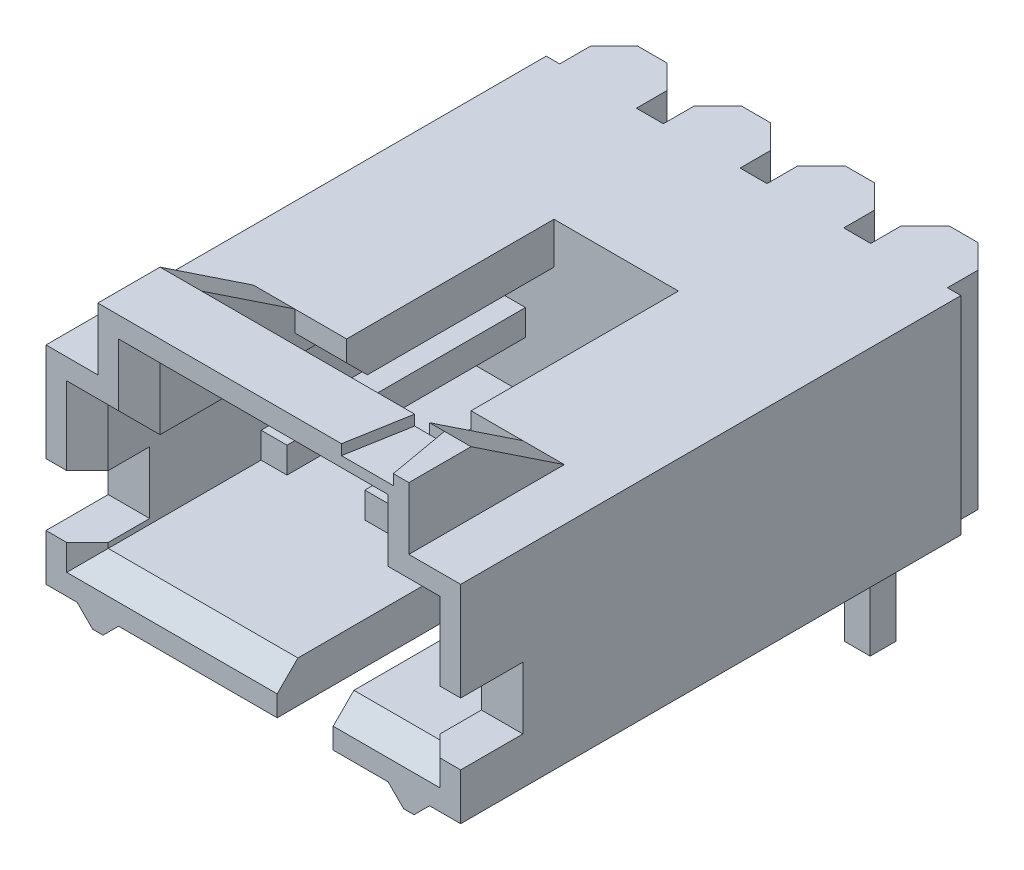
ISO-10303-21;
HEADER;
FILE_DESCRIPTION(('STEP AP214'),'2;1');
FILE_NAME('part.step','',(''),(''),'','','');
FILE_SCHEMA(('AUTOMOTIVE_DESIGN { 1 0 10303 214 1 1 1 1 }'));
ENDSEC;
DATA;
#1=APPLICATION_CONTEXT('core data for automotive mechanical design processes');
#2=APPLICATION_PROTOCOL_DEFINITION('international standard','automotive_design',2000,#1);
#3=PRODUCT_CONTEXT('',#1,'mechanical');
#4=PRODUCT('Part','Part','',(#3));
#5=PRODUCT_RELATED_PRODUCT_CATEGORY('part','',(#4));
#6=PRODUCT_DEFINITION_FORMATION('','',#4);
#7=PRODUCT_DEFINITION_CONTEXT('part definition',#1,'design');
#8=PRODUCT_DEFINITION('design','',#6,#7);
#9=PRODUCT_DEFINITION_SHAPE('','',#8);
#10=(LENGTH_UNIT() NAMED_UNIT(*) SI_UNIT(.MILLI.,.METRE.));
#11=(NAMED_UNIT(*) PLANE_ANGLE_UNIT() SI_UNIT($,.RADIAN.));
#12=(NAMED_UNIT(*) SI_UNIT($,.STERADIAN.) SOLID_ANGLE_UNIT());
#13=UNCERTAINTY_MEASURE_WITH_UNIT(LENGTH_MEASURE(1.E-05),#10,'distance_accuracy_value','');
#14=(GEOMETRIC_REPRESENTATION_CONTEXT(3) GLOBAL_UNCERTAINTY_ASSIGNED_CONTEXT((#13)) GLOBAL_UNIT_ASSIGNED_CONTEXT((#10,
#11,#12)) REPRESENTATION_CONTEXT('',''));
#15=CARTESIAN_POINT('',(0.,0.,0.));
#16=DIRECTION('',(0.,0.,1.));
#17=DIRECTION('',(1.,0.,0.));
#18=AXIS2_PLACEMENT_3D('',#15,#16,#17);
#19=CARTESIAN_POINT('',(-1.5375,1.651,1.2675));
#20=DIRECTION('',(-1.,0.,0.));
#21=DIRECTION('',(0.,0.,1.));
#22=AXIS2_PLACEMENT_3D('',#19,#20,#21);
#23=CYLINDRICAL_SURFACE('',#22,1.5875);
#24=CARTESIAN_POINT('',(-2.855,1.651,1.2675));
#25=DIRECTION('',(-1.,0.,0.));
#26=DIRECTION('',(0.,0.,1.));
#27=AXIS2_PLACEMENT_3D('',#24,#25,#26);
#28=CIRCLE('',#27,1.5875);
#29=CARTESIAN_POINT('',(-2.855,2.921,0.314999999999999));
#30=VERTEX_POINT('',#29);
#31=CARTESIAN_POINT('',(-2.855,1.651,-0.320000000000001));
#32=VERTEX_POINT('',#31);
#33=EDGE_CURVE('E257',#30,#32,#28,.T.);
#34=ORIENTED_EDGE('',*,*,#33,.F.);
#35=DIRECTION('',(-1.,0.,0.));
#36=VECTOR('',#35,1.);
#37=CARTESIAN_POINT('',(-1.5375,2.921,0.314999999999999));
#38=LINE('',#37,#36);
#39=CARTESIAN_POINT('',(-2.22,2.921,0.314999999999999));
#40=VERTEX_POINT('',#39);
#41=EDGE_CURVE('E250',#30,#40,#38,.F.);
#42=ORIENTED_EDGE('',*,*,#41,.T.);
#43=CARTESIAN_POINT('',(-2.22,1.651,1.2675));
#44=DIRECTION('',(-1.,0.,0.));
#45=DIRECTION('',(0.,0.,1.));
#46=AXIS2_PLACEMENT_3D('',#43,#44,#45);
#47=CIRCLE('',#46,1.5875);
#48=CARTESIAN_POINT('',(-2.22,1.651,-0.320000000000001));
#49=VERTEX_POINT('',#48);
#50=EDGE_CURVE('E18',#49,#40,#47,.F.);
#51=ORIENTED_EDGE('',*,*,#50,.F.);
#52=DIRECTION('',(-1.,0.,0.));
#53=VECTOR('',#52,1.);
#54=CARTESIAN_POINT('',(-2.855,1.651,-0.320000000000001));
#55=LINE('',#54,#53);
#56=EDGE_CURVE('E238',#32,#49,#55,.F.);
#57=ORIENTED_EDGE('',*,*,#56,.F.);
#58=EDGE_LOOP('',(#34,#42,#51,#57));
#59=FACE_BOUND('',#58,.T.);
#60=ADVANCED_FACE('F14',(#59),#23,.T.);
#61=CARTESIAN_POINT('',(-2.855,1.651,-0.320000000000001));
#62=DIRECTION('',(0.,0.,-1.));
#63=DIRECTION('',(-1.,0.,0.));
#64=AXIS2_PLACEMENT_3D('',#61,#62,#63);
#65=PLANE('',#64);
#66=DIRECTION('',(0.,1.,0.));
#67=VECTOR('',#66,1.);
#68=CARTESIAN_POINT('',(-2.855,2.6035,-0.320000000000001));
#69=LINE('',#68,#67);
#70=CARTESIAN_POINT('',(-2.855,-3.302,-0.320000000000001));
#71=VERTEX_POINT('',#70);
#72=EDGE_CURVE('E245',#32,#71,#69,.F.);
#73=ORIENTED_EDGE('',*,*,#72,.F.);
#74=ORIENTED_EDGE('',*,*,#56,.T.);
#75=DIRECTION('',(0.,1.,0.));
#76=VECTOR('',#75,1.);
#77=CARTESIAN_POINT('',(-2.22,3.2385,-0.320000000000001));
#78=LINE('',#77,#76);
#79=CARTESIAN_POINT('',(-2.22,-3.302,-0.320000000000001));
#80=VERTEX_POINT('',#79);
#81=EDGE_CURVE('E242',#80,#49,#78,.T.);
#82=ORIENTED_EDGE('',*,*,#81,.F.);
#83=DIRECTION('',(1.,0.,0.));
#84=VECTOR('',#83,1.);
#85=CARTESIAN_POINT('',(-2.5375,-3.302,-0.320000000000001));
#86=LINE('',#85,#84);
#87=EDGE_CURVE('E249',#71,#80,#86,.T.);
#88=ORIENTED_EDGE('',*,*,#87,.F.);
#89=EDGE_LOOP('',(#73,#74,#82,#88));
#90=FACE_BOUND('',#89,.T.);
#91=ADVANCED_FACE('F240',(#90),#65,.T.);
#92=CARTESIAN_POINT('',(-2.5375,-3.302,-0.0025000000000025));
#93=DIRECTION('',(0.,-1.,0.));
#94=DIRECTION('',(0.,0.,-1.));
#95=AXIS2_PLACEMENT_3D('',#92,#93,#94);
#96=PLANE('',#95);
#97=ORIENTED_EDGE('',*,*,#87,.T.);
#98=DIRECTION('',(0.,0.,-1.));
#99=VECTOR('',#98,1.);
#100=CARTESIAN_POINT('',(-2.22,-3.302,9.5225));
#101=LINE('',#100,#99);
#102=CARTESIAN_POINT('',(-2.22,-3.302,0.315000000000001));
#103=VERTEX_POINT('',#102);
#104=EDGE_CURVE('E261',#103,#80,#101,.T.);
#105=ORIENTED_EDGE('',*,*,#104,.F.);
#106=DIRECTION('',(1.,0.,0.));
#107=VECTOR('',#106,1.);
#108=CARTESIAN_POINT('',(-2.22,-3.302,0.314999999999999));
#109=LINE('',#108,#107);
#110=CARTESIAN_POINT('',(-2.855,-3.302,0.315000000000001));
#111=VERTEX_POINT('',#110);
#112=EDGE_CURVE('E1249',#111,#103,#109,.T.);
#113=ORIENTED_EDGE('',*,*,#112,.F.);
#114=DIRECTION('',(0.,0.,1.));
#115=VECTOR('',#114,1.);
#116=CARTESIAN_POINT('',(-2.855,-3.302,9.5225));
#117=LINE('',#116,#115);
#118=EDGE_CURVE('E267',#71,#111,#117,.T.);
#119=ORIENTED_EDGE('',*,*,#118,.F.);
#120=EDGE_LOOP('',(#97,#105,#113,#119));
#121=FACE_BOUND('',#120,.T.);
#122=ADVANCED_FACE('F1276',(#121),#96,.T.);
#123=CARTESIAN_POINT('',(-2.22,1.651,0.314999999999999));
#124=DIRECTION('',(0.,0.,1.));
#125=DIRECTION('',(1.,0.,0.));
#126=AXIS2_PLACEMENT_3D('',#123,#124,#125);
#127=PLANE('',#126);
#128=DIRECTION('',(0.,1.,0.));
#129=VECTOR('',#128,1.);
#130=CARTESIAN_POINT('',(-2.22,3.2385,0.314999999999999));
#131=LINE('',#130,#129);
#132=CARTESIAN_POINT('',(-2.22,0.381,0.314999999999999));
#133=VERTEX_POINT('',#132);
#134=EDGE_CURVE('E263',#133,#103,#131,.F.);
#135=ORIENTED_EDGE('',*,*,#134,.F.);
#136=DIRECTION('',(1.,0.,0.));
#137=VECTOR('',#136,1.);
#138=CARTESIAN_POINT('',(-2.22,0.381,0.314999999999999));
#139=LINE('',#138,#137);
#140=CARTESIAN_POINT('',(-2.855,0.381,0.314999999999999));
#141=VERTEX_POINT('',#140);
#142=EDGE_CURVE('E1247',#133,#141,#139,.F.);
#143=ORIENTED_EDGE('',*,*,#142,.T.);
#144=DIRECTION('',(0.,1.,0.));
#145=VECTOR('',#144,1.);
#146=CARTESIAN_POINT('',(-2.855,2.6035,0.314999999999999));
#147=LINE('',#146,#145);
#148=EDGE_CURVE('E1234',#111,#141,#147,.T.);
#149=ORIENTED_EDGE('',*,*,#148,.F.);
#150=ORIENTED_EDGE('',*,*,#112,.T.);
#151=EDGE_LOOP('',(#135,#143,#149,#150));
#152=FACE_BOUND('',#151,.T.);
#153=ADVANCED_FACE('F1273',(#152),#127,.T.);
#154=CARTESIAN_POINT('',(-2.22,3.2385,9.5225));
#155=DIRECTION('',(1.,0.,0.));
#156=DIRECTION('',(0.,0.,-1.));
#157=AXIS2_PLACEMENT_3D('',#154,#155,#156);
#158=PLANE('',#157);
#159=ORIENTED_EDGE('',*,*,#50,.T.);
#160=DIRECTION('',(0.,1.,0.));
#161=VECTOR('',#160,1.);
#162=CARTESIAN_POINT('',(-2.22,5.461,0.314999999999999));
#163=LINE('',#162,#161);
#164=EDGE_CURVE('E1231',#40,#133,#163,.F.);
#165=ORIENTED_EDGE('',*,*,#164,.T.);
#166=ORIENTED_EDGE('',*,*,#134,.T.);
#167=ORIENTED_EDGE('',*,*,#104,.T.);
#168=ORIENTED_EDGE('',*,*,#81,.T.);
#169=EDGE_LOOP('',(#159,#165,#166,#167,#168));
#170=FACE_BOUND('',#169,.T.);
#171=ADVANCED_FACE('F258',(#170),#158,.T.);
#172=CARTESIAN_POINT('',(-2.855,2.6035,9.5225));
#173=DIRECTION('',(-1.,0.,0.));
#174=DIRECTION('',(0.,0.,1.));
#175=AXIS2_PLACEMENT_3D('',#172,#173,#174);
#176=PLANE('',#175);
#177=ORIENTED_EDGE('',*,*,#148,.T.);
#178=DIRECTION('',(0.,1.,0.));
#179=VECTOR('',#178,1.);
#180=CARTESIAN_POINT('',(-2.855,5.461,0.314999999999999));
#181=LINE('',#180,#179);
#182=EDGE_CURVE('E1222',#141,#30,#181,.T.);
#183=ORIENTED_EDGE('',*,*,#182,.T.);
#184=ORIENTED_EDGE('',*,*,#33,.T.);
#185=ORIENTED_EDGE('',*,*,#72,.T.);
#186=ORIENTED_EDGE('',*,*,#118,.T.);
#187=EDGE_LOOP('',(#177,#183,#184,#185,#186));
#188=FACE_BOUND('',#187,.T.);
#189=ADVANCED_FACE('F1263',(#188),#176,.T.);
#190=CARTESIAN_POINT('',(-2.8677,5.461,0.314999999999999));
#191=DIRECTION('',(0.,0.,1.));
#192=DIRECTION('',(1.,0.,0.));
#193=AXIS2_PLACEMENT_3D('',#190,#191,#192);
#194=PLANE('',#193);
#195=ORIENTED_EDGE('',*,*,#182,.F.);
#196=DIRECTION('',(1.,0.,0.));
#197=VECTOR('',#196,1.);
#198=CARTESIAN_POINT('',(-2.8677,0.381,0.314999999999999));
#199=LINE('',#198,#197);
#200=CARTESIAN_POINT('',(-2.8677,0.381,0.314999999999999));
#201=VERTEX_POINT('',#200);
#202=EDGE_CURVE('E1225',#201,#141,#199,.T.);
#203=ORIENTED_EDGE('',*,*,#202,.F.);
#204=DIRECTION('',(0.,1.,0.));
#205=VECTOR('',#204,1.);
#206=CARTESIAN_POINT('',(-2.8677,5.461,0.314999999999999));
#207=LINE('',#206,#205);
#208=CARTESIAN_POINT('',(-2.8677,5.461,0.314999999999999));
#209=VERTEX_POINT('',#208);
#210=EDGE_CURVE('E1240',#201,#209,#207,.T.);
#211=ORIENTED_EDGE('',*,*,#210,.T.);
#212=DIRECTION('',(1.,0.,0.));
#213=VECTOR('',#212,1.);
#214=CARTESIAN_POINT('',(-2.8677,5.461,0.314999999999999));
#215=LINE('',#214,#213);
#216=CARTESIAN_POINT('',(-2.2073,5.461,0.315000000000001));
#217=VERTEX_POINT('',#216);
#218=EDGE_CURVE('E1223',#217,#209,#215,.F.);
#219=ORIENTED_EDGE('',*,*,#218,.F.);
#220=DIRECTION('',(0.,1.,0.));
#221=VECTOR('',#220,1.);
#222=CARTESIAN_POINT('',(-2.2073,5.461,0.314999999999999));
#223=LINE('',#222,#221);
#224=CARTESIAN_POINT('',(-2.2073,0.381,0.315000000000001));
#225=VERTEX_POINT('',#224);
#226=EDGE_CURVE('E1217',#217,#225,#223,.F.);
#227=ORIENTED_EDGE('',*,*,#226,.T.);
#228=DIRECTION('',(1.,0.,0.));
#229=VECTOR('',#228,1.);
#230=CARTESIAN_POINT('',(-2.8677,0.381,0.314999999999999));
#231=LINE('',#230,#229);
#232=EDGE_CURVE('E1226',#133,#225,#231,.T.);
#233=ORIENTED_EDGE('',*,*,#232,.F.);
#234=ORIENTED_EDGE('',*,*,#164,.F.);
#235=ORIENTED_EDGE('',*,*,#41,.F.);
#236=EDGE_LOOP('',(#195,#203,#211,#219,#227,#233,#234,#235));
#237=FACE_BOUND('',#236,.T.);
#238=ADVANCED_FACE('F1268',(#237),#194,.F.);
#239=CARTESIAN_POINT('',(-2.2073,5.461,0.314999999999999));
#240=DIRECTION('',(1.,0.,0.));
#241=DIRECTION('',(0.,0.,-1.));
#242=AXIS2_PLACEMENT_3D('',#239,#240,#241);
#243=PLANE('',#242);
#244=DIRECTION('',(0.,0.,-1.));
#245=VECTOR('',#244,1.);
#246=CARTESIAN_POINT('',(-2.2073,5.461,0.314999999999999));
#247=LINE('',#246,#245);
#248=CARTESIAN_POINT('',(-2.2073,5.461,-0.434300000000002));
#249=VERTEX_POINT('',#248);
#250=EDGE_CURVE('E1215',#249,#217,#247,.F.);
#251=ORIENTED_EDGE('',*,*,#250,.F.);
#252=DIRECTION('',(0.,1.,0.));
#253=VECTOR('',#252,1.);
#254=CARTESIAN_POINT('',(-2.2073,5.461,-0.434300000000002));
#255=LINE('',#254,#253);
#256=CARTESIAN_POINT('',(-2.2073,0.380999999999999,-0.434300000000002));
#257=VERTEX_POINT('',#256);
#258=EDGE_CURVE('E278',#249,#257,#255,.F.);
#259=ORIENTED_EDGE('',*,*,#258,.T.);
#260=DIRECTION('',(0.,0.,-1.));
#261=VECTOR('',#260,1.);
#262=CARTESIAN_POINT('',(-2.2073,0.381,0.314999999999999));
#263=LINE('',#262,#261);
#264=EDGE_CURVE('E1218',#225,#257,#263,.T.);
#265=ORIENTED_EDGE('',*,*,#264,.F.);
#266=ORIENTED_EDGE('',*,*,#226,.F.);
#267=EDGE_LOOP('',(#251,#259,#265,#266));
#268=FACE_BOUND('',#267,.T.);
#269=ADVANCED_FACE('F2152',(#268),#243,.F.);
#270=CARTESIAN_POINT('',(-2.8677,5.461,-0.434300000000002));
#271=DIRECTION('',(-1.,0.,0.));
#272=DIRECTION('',(0.,0.,1.));
#273=AXIS2_PLACEMENT_3D('',#270,#271,#272);
#274=PLANE('',#273);
#275=DIRECTION('',(0.,0.,1.));
#276=VECTOR('',#275,1.);
#277=CARTESIAN_POINT('',(-2.8677,5.461,-0.434300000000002));
#278=LINE('',#277,#276);
#279=CARTESIAN_POINT('',(-2.8677,5.461,-0.434300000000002));
#280=VERTEX_POINT('',#279);
#281=EDGE_CURVE('E1213',#209,#280,#278,.F.);
#282=ORIENTED_EDGE('',*,*,#281,.F.);
#283=ORIENTED_EDGE('',*,*,#210,.F.);
#284=DIRECTION('',(0.,0.,1.));
#285=VECTOR('',#284,1.);
#286=CARTESIAN_POINT('',(-2.8677,0.381,-0.434300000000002));
#287=LINE('',#286,#285);
#288=CARTESIAN_POINT('',(-2.8677,0.380999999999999,-0.434300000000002));
#289=VERTEX_POINT('',#288);
#290=EDGE_CURVE('E1229',#289,#201,#287,.T.);
#291=ORIENTED_EDGE('',*,*,#290,.F.);
#292=DIRECTION('',(0.,1.,0.));
#293=VECTOR('',#292,1.);
#294=CARTESIAN_POINT('',(-2.8677,5.461,-0.434300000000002));
#295=LINE('',#294,#293);
#296=EDGE_CURVE('E272',#289,#280,#295,.T.);
#297=ORIENTED_EDGE('',*,*,#296,.T.);
#298=EDGE_LOOP('',(#282,#283,#291,#297));
#299=FACE_BOUND('',#298,.T.);
#300=ADVANCED_FACE('F2148',(#299),#274,.F.);
#301=CARTESIAN_POINT('',(-2.2073,5.461,-0.434300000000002));
#302=DIRECTION('',(0.707106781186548,0.,0.707106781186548));
#303=DIRECTION('',(0.707106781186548,0.,-0.707106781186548));
#304=AXIS2_PLACEMENT_3D('',#301,#302,#303);
#305=PLANE('',#304);
#306=DIRECTION('',(0.707106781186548,0.,-0.707106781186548));
#307=VECTOR('',#306,1.);
#308=CARTESIAN_POINT('',(-2.2073,5.461,-0.434300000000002));
#309=LINE('',#308,#307);
#310=CARTESIAN_POINT('',(-1.6231,5.461,-1.0185));
#311=VERTEX_POINT('',#310);
#312=EDGE_CURVE('E1212',#311,#249,#309,.F.);
#313=ORIENTED_EDGE('',*,*,#312,.F.);
#314=DIRECTION('',(0.,1.,0.));
#315=VECTOR('',#314,1.);
#316=CARTESIAN_POINT('',(-1.6231,0.381,-1.0185));
#317=LINE('',#316,#315);
#318=CARTESIAN_POINT('',(-1.6231,0.380999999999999,-1.0185));
#319=VERTEX_POINT('',#318);
#320=EDGE_CURVE('E289',#319,#311,#317,.T.);
#321=ORIENTED_EDGE('',*,*,#320,.F.);
#322=DIRECTION('',(0.707106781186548,0.,-0.707106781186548));
#323=VECTOR('',#322,1.);
#324=CARTESIAN_POINT('',(-2.2073,0.380999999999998,-0.434300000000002));
#325=LINE('',#324,#323);
#326=EDGE_CURVE('E1210',#257,#319,#325,.T.);
#327=ORIENTED_EDGE('',*,*,#326,.F.);
#328=ORIENTED_EDGE('',*,*,#258,.F.);
#329=EDGE_LOOP('',(#313,#321,#327,#328));
#330=FACE_BOUND('',#329,.T.);
#331=ADVANCED_FACE('F2144',(#330),#305,.F.);
#332=CARTESIAN_POINT('',(-3.4519,5.461,-1.0185));
#333=DIRECTION('',(-0.707106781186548,0.,0.707106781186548));
#334=DIRECTION('',(0.707106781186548,0.,0.707106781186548));
#335=AXIS2_PLACEMENT_3D('',#332,#333,#334);
#336=PLANE('',#335);
#337=DIRECTION('',(0.707106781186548,0.,0.707106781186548));
#338=VECTOR('',#337,1.);
#339=CARTESIAN_POINT('',(-3.4519,5.461,-1.0185));
#340=LINE('',#339,#338);
#341=CARTESIAN_POINT('',(-3.4519,5.461,-1.0185));
#342=VERTEX_POINT('',#341);
#343=EDGE_CURVE('E268',#280,#342,#340,.F.);
#344=ORIENTED_EDGE('',*,*,#343,.F.);
#345=ORIENTED_EDGE('',*,*,#296,.F.);
#346=DIRECTION('',(0.707106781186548,0.,0.707106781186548));
#347=VECTOR('',#346,1.);
#348=CARTESIAN_POINT('',(-3.4519,0.380999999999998,-1.0185));
#349=LINE('',#348,#347);
#350=CARTESIAN_POINT('',(-3.4519,0.380999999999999,-1.0185));
#351=VERTEX_POINT('',#350);
#352=EDGE_CURVE('E275',#351,#289,#349,.T.);
#353=ORIENTED_EDGE('',*,*,#352,.F.);
#354=DIRECTION('',(0.,1.,0.));
#355=VECTOR('',#354,1.);
#356=CARTESIAN_POINT('',(-3.4519,0.381,-1.0185));
#357=LINE('',#356,#355);
#358=EDGE_CURVE('E283',#342,#351,#357,.F.);
#359=ORIENTED_EDGE('',*,*,#358,.F.);
#360=EDGE_LOOP('',(#344,#345,#353,#359));
#361=FACE_BOUND('',#360,.T.);
#362=ADVANCED_FACE('F2140',(#361),#336,.F.);
#363=CARTESIAN_POINT('',(-6.3475,0.381,-1.0185));
#364=DIRECTION('',(0.,0.,-1.));
#365=DIRECTION('',(-1.,0.,0.));
#366=AXIS2_PLACEMENT_3D('',#363,#364,#365);
#367=PLANE('',#366);
#368=DIRECTION('',(-1.,0.,0.));
#369=VECTOR('',#368,1.);
#370=CARTESIAN_POINT('',(-6.3475,0.381,-1.0185));
#371=LINE('',#370,#369);
#372=CARTESIAN_POINT('',(-0.9119,0.380999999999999,-1.0185));
#373=VERTEX_POINT('',#372);
#374=EDGE_CURVE('E1203',#373,#319,#371,.T.);
#375=ORIENTED_EDGE('',*,*,#374,.T.);
#376=ORIENTED_EDGE('',*,*,#320,.T.);
#377=DIRECTION('',(-1.,0.,0.));
#378=VECTOR('',#377,1.);
#379=CARTESIAN_POINT('',(-6.3475,5.461,-1.0185));
#380=LINE('',#379,#378);
#381=CARTESIAN_POINT('',(-0.9119,5.461,-1.0185));
#382=VERTEX_POINT('',#381);
#383=EDGE_CURVE('E271',#311,#382,#380,.F.);
#384=ORIENTED_EDGE('',*,*,#383,.T.);
#385=DIRECTION('',(0.,1.,0.));
#386=VECTOR('',#385,1.);
#387=CARTESIAN_POINT('',(-0.9119,5.461,-1.0185));
#388=LINE('',#387,#386);
#389=EDGE_CURVE('E1193',#382,#373,#388,.F.);
#390=ORIENTED_EDGE('',*,*,#389,.T.);
#391=EDGE_LOOP('',(#375,#376,#384,#390));
#392=FACE_BOUND('',#391,.T.);
#393=ADVANCED_FACE('F2136',(#392),#367,.T.);
#394=CARTESIAN_POINT('',(-6.3475,0.381,-1.0185));
#395=DIRECTION('',(0.,0.,-1.));
#396=DIRECTION('',(-1.,0.,0.));
#397=AXIS2_PLACEMENT_3D('',#394,#395,#396);
#398=PLANE('',#397);
#399=DIRECTION('',(-1.,0.,0.));
#400=VECTOR('',#399,1.);
#401=CARTESIAN_POINT('',(-6.3475,0.381,-1.0185));
#402=LINE('',#401,#400);
#403=CARTESIAN_POINT('',(-4.1631,0.380999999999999,-1.0185));
#404=VERTEX_POINT('',#403);
#405=EDGE_CURVE('E279',#351,#404,#402,.T.);
#406=ORIENTED_EDGE('',*,*,#405,.T.);
#407=DIRECTION('',(0.,1.,0.));
#408=VECTOR('',#407,1.);
#409=CARTESIAN_POINT('',(-4.1631,5.461,-1.0185));
#410=LINE('',#409,#408);
#411=CARTESIAN_POINT('',(-4.1631,5.461,-1.0185));
#412=VERTEX_POINT('',#411);
#413=EDGE_CURVE('E294',#404,#412,#410,.T.);
#414=ORIENTED_EDGE('',*,*,#413,.T.);
#415=DIRECTION('',(-1.,0.,0.));
#416=VECTOR('',#415,1.);
#417=CARTESIAN_POINT('',(-6.3475,5.461,-1.0185));
#418=LINE('',#417,#416);
#419=EDGE_CURVE('E286',#412,#342,#418,.F.);
#420=ORIENTED_EDGE('',*,*,#419,.T.);
#421=ORIENTED_EDGE('',*,*,#358,.T.);
#422=EDGE_LOOP('',(#406,#414,#420,#421));
#423=FACE_BOUND('',#422,.T.);
#424=ADVANCED_FACE('F2132',(#423),#398,.T.);
#425=CARTESIAN_POINT('',(-0.9119,5.461,-1.0185));
#426=DIRECTION('',(-0.707106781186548,0.,0.707106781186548));
#427=DIRECTION('',(0.707106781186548,0.,0.707106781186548));
#428=AXIS2_PLACEMENT_3D('',#425,#426,#427);
#429=PLANE('',#428);
#430=DIRECTION('',(0.707106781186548,0.,0.707106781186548));
#431=VECTOR('',#430,1.);
#432=CARTESIAN_POINT('',(-0.9119,5.461,-1.0185));
#433=LINE('',#432,#431);
#434=CARTESIAN_POINT('',(-0.3277,5.461,-0.434300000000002));
#435=VERTEX_POINT('',#434);
#436=EDGE_CURVE('E1194',#435,#382,#433,.F.);
#437=ORIENTED_EDGE('',*,*,#436,.F.);
#438=DIRECTION('',(0.,1.,0.));
#439=VECTOR('',#438,1.);
#440=CARTESIAN_POINT('',(-0.3277,5.461,-0.434300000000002));
#441=LINE('',#440,#439);
#442=CARTESIAN_POINT('',(-0.3277,0.380999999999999,-0.434300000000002));
#443=VERTEX_POINT('',#442);
#444=EDGE_CURVE('E1156',#435,#443,#441,.F.);
#445=ORIENTED_EDGE('',*,*,#444,.T.);
#446=DIRECTION('',(0.707106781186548,0.,0.707106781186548));
#447=VECTOR('',#446,1.);
#448=CARTESIAN_POINT('',(-0.9119,0.380999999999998,-1.0185));
#449=LINE('',#448,#447);
#450=EDGE_CURVE('E282',#373,#443,#449,.T.);
#451=ORIENTED_EDGE('',*,*,#450,.F.);
#452=ORIENTED_EDGE('',*,*,#389,.F.);
#453=EDGE_LOOP('',(#437,#445,#451,#452));
#454=FACE_BOUND('',#453,.T.);
#455=ADVANCED_FACE('F2128',(#454),#429,.F.);
#456=CARTESIAN_POINT('',(1.0025,1.651,1.2675));
#457=DIRECTION('',(-1.,0.,0.));
#458=DIRECTION('',(0.,0.,1.));
#459=AXIS2_PLACEMENT_3D('',#456,#457,#458);
#460=CYLINDRICAL_SURFACE('',#459,1.5875);
#461=CARTESIAN_POINT('',(-0.315,1.651,1.2675));
#462=DIRECTION('',(-1.,0.,0.));
#463=DIRECTION('',(0.,0.,1.));
#464=AXIS2_PLACEMENT_3D('',#461,#462,#463);
#465=CIRCLE('',#464,1.5875);
#466=CARTESIAN_POINT('',(-0.315,2.921,0.314999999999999));
#467=VERTEX_POINT('',#466);
#468=CARTESIAN_POINT('',(-0.315,1.651,-0.320000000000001));
#469=VERTEX_POINT('',#468);
#470=EDGE_CURVE('E310',#467,#469,#465,.T.);
#471=ORIENTED_EDGE('',*,*,#470,.F.);
#472=DIRECTION('',(-1.,0.,0.));
#473=VECTOR('',#472,1.);
#474=CARTESIAN_POINT('',(1.0025,2.921,0.314999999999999));
#475=LINE('',#474,#473);
#476=CARTESIAN_POINT('',(0.32,2.921,0.314999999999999));
#477=VERTEX_POINT('',#476);
#478=EDGE_CURVE('E1191',#467,#477,#475,.F.);
#479=ORIENTED_EDGE('',*,*,#478,.T.);
#480=CARTESIAN_POINT('',(0.32,1.651,1.2675));
#481=DIRECTION('',(-1.,0.,0.));
#482=DIRECTION('',(0.,0.,1.));
#483=AXIS2_PLACEMENT_3D('',#480,#481,#482);
#484=CIRCLE('',#483,1.5875);
#485=CARTESIAN_POINT('',(0.32,1.651,-0.320000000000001));
#486=VERTEX_POINT('',#485);
#487=EDGE_CURVE('E304',#486,#477,#484,.F.);
#488=ORIENTED_EDGE('',*,*,#487,.F.);
#489=DIRECTION('',(-1.,0.,0.));
#490=VECTOR('',#489,1.);
#491=CARTESIAN_POINT('',(-0.315,1.651,-0.320000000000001));
#492=LINE('',#491,#490);
#493=EDGE_CURVE('E1189',#469,#486,#492,.F.);
#494=ORIENTED_EDGE('',*,*,#493,.F.);
#495=EDGE_LOOP('',(#471,#479,#488,#494));
#496=FACE_BOUND('',#495,.T.);
#497=ADVANCED_FACE('F2124',(#496),#460,.T.);
#498=CARTESIAN_POINT('',(-0.315,1.651,-0.320000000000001));
#499=DIRECTION('',(0.,0.,-1.));
#500=DIRECTION('',(-1.,0.,0.));
#501=AXIS2_PLACEMENT_3D('',#498,#499,#500);
#502=PLANE('',#501);
#503=DIRECTION('',(0.,1.,0.));
#504=VECTOR('',#503,1.);
#505=CARTESIAN_POINT('',(-0.315,2.6035,-0.320000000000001));
#506=LINE('',#505,#504);
#507=CARTESIAN_POINT('',(-0.315,-3.302,-0.320000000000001));
#508=VERTEX_POINT('',#507);
#509=EDGE_CURVE('E306',#469,#508,#506,.F.);
#510=ORIENTED_EDGE('',*,*,#509,.F.);
#511=ORIENTED_EDGE('',*,*,#493,.T.);
#512=DIRECTION('',(0.,1.,0.));
#513=VECTOR('',#512,1.);
#514=CARTESIAN_POINT('',(0.32,3.2385,-0.320000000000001));
#515=LINE('',#514,#513);
#516=CARTESIAN_POINT('',(0.32,-3.302,-0.320000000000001));
#517=VERTEX_POINT('',#516);
#518=EDGE_CURVE('E301',#517,#486,#515,.T.);
#519=ORIENTED_EDGE('',*,*,#518,.F.);
#520=DIRECTION('',(1.,0.,0.));
#521=VECTOR('',#520,1.);
#522=CARTESIAN_POINT('',(0.00250000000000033,-3.302,-0.320000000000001));
#523=LINE('',#522,#521);
#524=EDGE_CURVE('E1185',#508,#517,#523,.T.);
#525=ORIENTED_EDGE('',*,*,#524,.F.);
#526=EDGE_LOOP('',(#510,#511,#519,#525));
#527=FACE_BOUND('',#526,.T.);
#528=ADVANCED_FACE('F2120',(#527),#502,.T.);
#529=CARTESIAN_POINT('',(0.00250000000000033,-3.302,-0.0025000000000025));
#530=DIRECTION('',(0.,-1.,0.));
#531=DIRECTION('',(0.,0.,-1.));
#532=AXIS2_PLACEMENT_3D('',#529,#530,#531);
#533=PLANE('',#532);
#534=ORIENTED_EDGE('',*,*,#524,.T.);
#535=DIRECTION('',(0.,0.,-1.));
#536=VECTOR('',#535,1.);
#537=CARTESIAN_POINT('',(0.32,-3.302,9.5225));
#538=LINE('',#537,#536);
#539=CARTESIAN_POINT('',(0.32,-3.302,0.315000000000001));
#540=VERTEX_POINT('',#539);
#541=EDGE_CURVE('E305',#540,#517,#538,.T.);
#542=ORIENTED_EDGE('',*,*,#541,.F.);
#543=DIRECTION('',(1.,0.,0.));
#544=VECTOR('',#543,1.);
#545=CARTESIAN_POINT('',(0.32,-3.302,0.314999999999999));
#546=LINE('',#545,#544);
#547=CARTESIAN_POINT('',(-0.315,-3.302,0.315000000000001));
#548=VERTEX_POINT('',#547);
#549=EDGE_CURVE('E1183',#548,#540,#546,.T.);
#550=ORIENTED_EDGE('',*,*,#549,.F.);
#551=DIRECTION('',(0.,0.,1.));
#552=VECTOR('',#551,1.);
#553=CARTESIAN_POINT('',(-0.315,-3.302,9.5225));
#554=LINE('',#553,#552);
#555=EDGE_CURVE('E309',#508,#548,#554,.T.);
#556=ORIENTED_EDGE('',*,*,#555,.F.);
#557=EDGE_LOOP('',(#534,#542,#550,#556));
#558=FACE_BOUND('',#557,.T.);
#559=ADVANCED_FACE('F2116',(#558),#533,.T.);
#560=CARTESIAN_POINT('',(0.32,1.651,0.314999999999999));
#561=DIRECTION('',(0.,0.,1.));
#562=DIRECTION('',(1.,0.,0.));
#563=AXIS2_PLACEMENT_3D('',#560,#561,#562);
#564=PLANE('',#563);
#565=DIRECTION('',(0.,1.,0.));
#566=VECTOR('',#565,1.);
#567=CARTESIAN_POINT('',(0.32,3.2385,0.314999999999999));
#568=LINE('',#567,#566);
#569=CARTESIAN_POINT('',(0.32,0.381,0.314999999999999));
#570=VERTEX_POINT('',#569);
#571=EDGE_CURVE('E1164',#570,#540,#568,.F.);
#572=ORIENTED_EDGE('',*,*,#571,.F.);
#573=DIRECTION('',(1.,0.,0.));
#574=VECTOR('',#573,1.);
#575=CARTESIAN_POINT('',(0.32,0.381,0.314999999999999));
#576=LINE('',#575,#574);
#577=CARTESIAN_POINT('',(-0.315,0.381,0.314999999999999));
#578=VERTEX_POINT('',#577);
#579=EDGE_CURVE('E300',#570,#578,#576,.F.);
#580=ORIENTED_EDGE('',*,*,#579,.T.);
#581=DIRECTION('',(0.,1.,0.));
#582=VECTOR('',#581,1.);
#583=CARTESIAN_POINT('',(-0.315,2.6035,0.314999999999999));
#584=LINE('',#583,#582);
#585=EDGE_CURVE('E1138',#548,#578,#584,.T.);
#586=ORIENTED_EDGE('',*,*,#585,.F.);
#587=ORIENTED_EDGE('',*,*,#549,.T.);
#588=EDGE_LOOP('',(#572,#580,#586,#587));
#589=FACE_BOUND('',#588,.T.);
#590=ADVANCED_FACE('F2112',(#589),#564,.T.);
#591=CARTESIAN_POINT('',(-4.7473,5.461,-0.434300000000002));
#592=DIRECTION('',(0.707106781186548,0.,0.707106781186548));
#593=DIRECTION('',(0.707106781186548,0.,-0.707106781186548));
#594=AXIS2_PLACEMENT_3D('',#591,#592,#593);
#595=PLANE('',#594);
#596=DIRECTION('',(0.707106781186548,0.,-0.707106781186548));
#597=VECTOR('',#596,1.);
#598=CARTESIAN_POINT('',(-4.7473,5.461,-0.434300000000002));
#599=LINE('',#598,#597);
#600=CARTESIAN_POINT('',(-4.7473,5.461,-0.434300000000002));
#601=VERTEX_POINT('',#600);
#602=EDGE_CURVE('E290',#412,#601,#599,.F.);
#603=ORIENTED_EDGE('',*,*,#602,.F.);
#604=ORIENTED_EDGE('',*,*,#413,.F.);
#605=DIRECTION('',(0.707106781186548,0.,-0.707106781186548));
#606=VECTOR('',#605,1.);
#607=CARTESIAN_POINT('',(-4.7473,0.380999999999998,-0.434300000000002));
#608=LINE('',#607,#606);
#609=CARTESIAN_POINT('',(-4.7473,0.380999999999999,-0.434300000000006));
#610=VERTEX_POINT('',#609);
#611=EDGE_CURVE('E297',#610,#404,#608,.T.);
#612=ORIENTED_EDGE('',*,*,#611,.F.);
#613=DIRECTION('',(0.,1.,0.));
#614=VECTOR('',#613,1.);
#615=CARTESIAN_POINT('',(-4.7473,5.461,-0.434300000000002));
#616=LINE('',#615,#614);
#617=EDGE_CURVE('E320',#610,#601,#616,.T.);
#618=ORIENTED_EDGE('',*,*,#617,.T.);
#619=EDGE_LOOP('',(#603,#604,#612,#618));
#620=FACE_BOUND('',#619,.T.);
#621=ADVANCED_FACE('F2108',(#620),#595,.F.);
#622=CARTESIAN_POINT('',(-4.0775,1.651,1.2675));
#623=DIRECTION('',(-1.,0.,0.));
#624=DIRECTION('',(0.,0.,1.));
#625=AXIS2_PLACEMENT_3D('',#622,#623,#624);
#626=CYLINDRICAL_SURFACE('',#625,1.5875);
#627=CARTESIAN_POINT('',(-5.395,1.651,1.2675));
#628=DIRECTION('',(-1.,0.,0.));
#629=DIRECTION('',(0.,0.,1.));
#630=AXIS2_PLACEMENT_3D('',#627,#628,#629);
#631=CIRCLE('',#630,1.5875);
#632=CARTESIAN_POINT('',(-5.395,2.921,0.314999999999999));
#633=VERTEX_POINT('',#632);
#634=CARTESIAN_POINT('',(-5.395,1.651,-0.320000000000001));
#635=VERTEX_POINT('',#634);
#636=EDGE_CURVE('E319',#633,#635,#631,.T.);
#637=ORIENTED_EDGE('',*,*,#636,.F.);
#638=DIRECTION('',(-1.,0.,0.));
#639=VECTOR('',#638,1.);
#640=CARTESIAN_POINT('',(-4.0775,2.921,0.314999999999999));
#641=LINE('',#640,#639);
#642=CARTESIAN_POINT('',(-4.76,2.921,0.314999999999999));
#643=VERTEX_POINT('',#642);
#644=EDGE_CURVE('E293',#633,#643,#641,.F.);
#645=ORIENTED_EDGE('',*,*,#644,.T.);
#646=CARTESIAN_POINT('',(-4.76,1.651,1.2675));
#647=DIRECTION('',(-1.,0.,0.));
#648=DIRECTION('',(0.,0.,1.));
#649=AXIS2_PLACEMENT_3D('',#646,#647,#648);
#650=CIRCLE('',#649,1.5875);
#651=CARTESIAN_POINT('',(-4.76,1.651,-0.320000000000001));
#652=VERTEX_POINT('',#651);
#653=EDGE_CURVE('E314',#652,#643,#650,.F.);
#654=ORIENTED_EDGE('',*,*,#653,.F.);
#655=DIRECTION('',(-1.,0.,0.));
#656=VECTOR('',#655,1.);
#657=CARTESIAN_POINT('',(-5.395,1.651,-0.320000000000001));
#658=LINE('',#657,#656);
#659=EDGE_CURVE('E1177',#635,#652,#658,.F.);
#660=ORIENTED_EDGE('',*,*,#659,.F.);
#661=EDGE_LOOP('',(#637,#645,#654,#660));
#662=FACE_BOUND('',#661,.T.);
#663=ADVANCED_FACE('F2104',(#662),#626,.T.);
#664=CARTESIAN_POINT('',(-5.395,1.651,-0.320000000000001));
#665=DIRECTION('',(0.,0.,-1.));
#666=DIRECTION('',(-1.,0.,0.));
#667=AXIS2_PLACEMENT_3D('',#664,#665,#666);
#668=PLANE('',#667);
#669=DIRECTION('',(0.,1.,0.));
#670=VECTOR('',#669,1.);
#671=CARTESIAN_POINT('',(-5.395,2.6035,-0.320000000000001));
#672=LINE('',#671,#670);
#673=CARTESIAN_POINT('',(-5.395,-3.302,-0.320000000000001));
#674=VERTEX_POINT('',#673);
#675=EDGE_CURVE('E326',#635,#674,#672,.F.);
#676=ORIENTED_EDGE('',*,*,#675,.F.);
#677=ORIENTED_EDGE('',*,*,#659,.T.);
#678=DIRECTION('',(0.,1.,0.));
#679=VECTOR('',#678,1.);
#680=CARTESIAN_POINT('',(-4.76,3.2385,-0.320000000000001));
#681=LINE('',#680,#679);
#682=CARTESIAN_POINT('',(-4.76,-3.302,-0.320000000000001));
#683=VERTEX_POINT('',#682);
#684=EDGE_CURVE('E311',#683,#652,#681,.T.);
#685=ORIENTED_EDGE('',*,*,#684,.F.);
#686=DIRECTION('',(1.,0.,0.));
#687=VECTOR('',#686,1.);
#688=CARTESIAN_POINT('',(-5.0775,-3.302,-0.320000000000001));
#689=LINE('',#688,#687);
#690=EDGE_CURVE('E1173',#674,#683,#689,.T.);
#691=ORIENTED_EDGE('',*,*,#690,.F.);
#692=EDGE_LOOP('',(#676,#677,#685,#691));
#693=FACE_BOUND('',#692,.T.);
#694=ADVANCED_FACE('F2100',(#693),#668,.T.);
#695=CARTESIAN_POINT('',(-5.0775,-3.302,-0.0025000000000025));
#696=DIRECTION('',(0.,-1.,0.));
#697=DIRECTION('',(0.,0.,-1.));
#698=AXIS2_PLACEMENT_3D('',#695,#696,#697);
#699=PLANE('',#698);
#700=ORIENTED_EDGE('',*,*,#690,.T.);
#701=DIRECTION('',(0.,0.,-1.));
#702=VECTOR('',#701,1.);
#703=CARTESIAN_POINT('',(-4.76,-3.302,9.5225));
#704=LINE('',#703,#702);
#705=CARTESIAN_POINT('',(-4.76,-3.302,0.315000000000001));
#706=VERTEX_POINT('',#705);
#707=EDGE_CURVE('E315',#706,#683,#704,.T.);
#708=ORIENTED_EDGE('',*,*,#707,.F.);
#709=DIRECTION('',(1.,0.,0.));
#710=VECTOR('',#709,1.);
#711=CARTESIAN_POINT('',(-4.76,-3.302,0.314999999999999));
#712=LINE('',#711,#710);
#713=CARTESIAN_POINT('',(-5.395,-3.302,0.315000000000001));
#714=VERTEX_POINT('',#713);
#715=EDGE_CURVE('E1171',#714,#706,#712,.T.);
#716=ORIENTED_EDGE('',*,*,#715,.F.);
#717=DIRECTION('',(0.,0.,1.));
#718=VECTOR('',#717,1.);
#719=CARTESIAN_POINT('',(-5.395,-3.302,9.5225));
#720=LINE('',#719,#718);
#721=EDGE_CURVE('E329',#674,#714,#720,.T.);
#722=ORIENTED_EDGE('',*,*,#721,.F.);
#723=EDGE_LOOP('',(#700,#708,#716,#722));
#724=FACE_BOUND('',#723,.T.);
#725=ADVANCED_FACE('F2096',(#724),#699,.T.);
#726=CARTESIAN_POINT('',(-4.76,1.651,0.314999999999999));
#727=DIRECTION('',(0.,0.,1.));
#728=DIRECTION('',(1.,0.,0.));
#729=AXIS2_PLACEMENT_3D('',#726,#727,#728);
#730=PLANE('',#729);
#731=DIRECTION('',(0.,1.,0.));
#732=VECTOR('',#731,1.);
#733=CARTESIAN_POINT('',(-4.76,3.2385,0.314999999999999));
#734=LINE('',#733,#732);
#735=CARTESIAN_POINT('',(-4.76,0.381,0.314999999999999));
#736=VERTEX_POINT('',#735);
#737=EDGE_CURVE('E1135',#736,#706,#734,.F.);
#738=ORIENTED_EDGE('',*,*,#737,.F.);
#739=DIRECTION('',(1.,0.,0.));
#740=VECTOR('',#739,1.);
#741=CARTESIAN_POINT('',(-4.76,0.381,0.314999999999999));
#742=LINE('',#741,#740);
#743=CARTESIAN_POINT('',(-5.395,0.381,0.314999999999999));
#744=VERTEX_POINT('',#743);
#745=EDGE_CURVE('E1167',#736,#744,#742,.F.);
#746=ORIENTED_EDGE('',*,*,#745,.T.);
#747=DIRECTION('',(0.,1.,0.));
#748=VECTOR('',#747,1.);
#749=CARTESIAN_POINT('',(-5.395,2.6035,0.314999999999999));
#750=LINE('',#749,#748);
#751=EDGE_CURVE('E1120',#714,#744,#750,.T.);
#752=ORIENTED_EDGE('',*,*,#751,.F.);
#753=ORIENTED_EDGE('',*,*,#715,.T.);
#754=EDGE_LOOP('',(#738,#746,#752,#753));
#755=FACE_BOUND('',#754,.T.);
#756=ADVANCED_FACE('F2092',(#755),#730,.T.);
#757=CARTESIAN_POINT('',(0.32,3.2385,9.5225));
#758=DIRECTION('',(1.,0.,0.));
#759=DIRECTION('',(0.,0.,-1.));
#760=AXIS2_PLACEMENT_3D('',#757,#758,#759);
#761=PLANE('',#760);
#762=ORIENTED_EDGE('',*,*,#487,.T.);
#763=DIRECTION('',(0.,1.,0.));
#764=VECTOR('',#763,1.);
#765=CARTESIAN_POINT('',(0.32,5.461,0.314999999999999));
#766=LINE('',#765,#764);
#767=EDGE_CURVE('E1123',#477,#570,#766,.F.);
#768=ORIENTED_EDGE('',*,*,#767,.T.);
#769=ORIENTED_EDGE('',*,*,#571,.T.);
#770=ORIENTED_EDGE('',*,*,#541,.T.);
#771=ORIENTED_EDGE('',*,*,#518,.T.);
#772=EDGE_LOOP('',(#762,#768,#769,#770,#771));
#773=FACE_BOUND('',#772,.T.);
#774=ADVANCED_FACE('F2088',(#773),#761,.T.);
#775=CARTESIAN_POINT('',(-0.3277,5.461,-0.434300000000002));
#776=DIRECTION('',(-1.,0.,0.));
#777=DIRECTION('',(0.,0.,1.));
#778=AXIS2_PLACEMENT_3D('',#775,#776,#777);
#779=PLANE('',#778);
#780=DIRECTION('',(0.,0.,1.));
#781=VECTOR('',#780,1.);
#782=CARTESIAN_POINT('',(-0.3277,5.461,-0.434300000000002));
#783=LINE('',#782,#781);
#784=CARTESIAN_POINT('',(-0.3277,5.461,0.315000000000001));
#785=VERTEX_POINT('',#784);
#786=EDGE_CURVE('E1154',#785,#435,#783,.F.);
#787=ORIENTED_EDGE('',*,*,#786,.F.);
#788=DIRECTION('',(0.,1.,0.));
#789=VECTOR('',#788,1.);
#790=CARTESIAN_POINT('',(-0.3277,5.461,0.314999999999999));
#791=LINE('',#790,#789);
#792=CARTESIAN_POINT('',(-0.3277,0.381,0.315000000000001));
#793=VERTEX_POINT('',#792);
#794=EDGE_CURVE('E1148',#785,#793,#791,.F.);
#795=ORIENTED_EDGE('',*,*,#794,.T.);
#796=DIRECTION('',(0.,0.,1.));
#797=VECTOR('',#796,1.);
#798=CARTESIAN_POINT('',(-0.3277,0.381,-0.434300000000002));
#799=LINE('',#798,#797);
#800=EDGE_CURVE('E1152',#443,#793,#799,.T.);
#801=ORIENTED_EDGE('',*,*,#800,.F.);
#802=ORIENTED_EDGE('',*,*,#444,.F.);
#803=EDGE_LOOP('',(#787,#795,#801,#802));
#804=FACE_BOUND('',#803,.T.);
#805=ADVANCED_FACE('F2084',(#804),#779,.F.);
#806=CARTESIAN_POINT('',(-0.315,2.6035,9.5225));
#807=DIRECTION('',(-1.,0.,0.));
#808=DIRECTION('',(0.,0.,1.));
#809=AXIS2_PLACEMENT_3D('',#806,#807,#808);
#810=PLANE('',#809);
#811=ORIENTED_EDGE('',*,*,#585,.T.);
#812=DIRECTION('',(0.,1.,0.));
#813=VECTOR('',#812,1.);
#814=CARTESIAN_POINT('',(-0.315,5.461,0.314999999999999));
#815=LINE('',#814,#813);
#816=EDGE_CURVE('E1134',#578,#467,#815,.T.);
#817=ORIENTED_EDGE('',*,*,#816,.T.);
#818=ORIENTED_EDGE('',*,*,#470,.T.);
#819=ORIENTED_EDGE('',*,*,#509,.T.);
#820=ORIENTED_EDGE('',*,*,#555,.T.);
#821=EDGE_LOOP('',(#811,#817,#818,#819,#820));
#822=FACE_BOUND('',#821,.T.);
#823=ADVANCED_FACE('F2080',(#822),#810,.T.);
#824=CARTESIAN_POINT('',(-4.76,3.2385,9.5225));
#825=DIRECTION('',(1.,0.,0.));
#826=DIRECTION('',(0.,0.,-1.));
#827=AXIS2_PLACEMENT_3D('',#824,#825,#826);
#828=PLANE('',#827);
#829=ORIENTED_EDGE('',*,*,#653,.T.);
#830=DIRECTION('',(0.,1.,0.));
#831=VECTOR('',#830,1.);
#832=CARTESIAN_POINT('',(-4.76,5.461,0.314999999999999));
#833=LINE('',#832,#831);
#834=EDGE_CURVE('E1131',#643,#736,#833,.F.);
#835=ORIENTED_EDGE('',*,*,#834,.T.);
#836=ORIENTED_EDGE('',*,*,#737,.T.);
#837=ORIENTED_EDGE('',*,*,#707,.T.);
#838=ORIENTED_EDGE('',*,*,#684,.T.);
#839=EDGE_LOOP('',(#829,#835,#836,#837,#838));
#840=FACE_BOUND('',#839,.T.);
#841=ADVANCED_FACE('F2076',(#840),#828,.T.);
#842=CARTESIAN_POINT('',(-4.7473,5.461,0.314999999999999));
#843=DIRECTION('',(1.,0.,0.));
#844=DIRECTION('',(0.,0.,-1.));
#845=AXIS2_PLACEMENT_3D('',#842,#843,#844);
#846=PLANE('',#845);
#847=DIRECTION('',(0.,0.,-1.));
#848=VECTOR('',#847,1.);
#849=CARTESIAN_POINT('',(-4.7473,5.461,0.314999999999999));
#850=LINE('',#849,#848);
#851=CARTESIAN_POINT('',(-4.7473,5.461,0.314999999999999));
#852=VERTEX_POINT('',#851);
#853=EDGE_CURVE('E316',#601,#852,#850,.F.);
#854=ORIENTED_EDGE('',*,*,#853,.F.);
#855=ORIENTED_EDGE('',*,*,#617,.F.);
#856=DIRECTION('',(0.,0.,-1.));
#857=VECTOR('',#856,1.);
#858=CARTESIAN_POINT('',(-4.7473,0.381,0.314999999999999));
#859=LINE('',#858,#857);
#860=CARTESIAN_POINT('',(-4.7473,0.381,0.314999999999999));
#861=VERTEX_POINT('',#860);
#862=EDGE_CURVE('E323',#861,#610,#859,.T.);
#863=ORIENTED_EDGE('',*,*,#862,.F.);
#864=DIRECTION('',(0.,1.,0.));
#865=VECTOR('',#864,1.);
#866=CARTESIAN_POINT('',(-4.7473,5.461,0.314999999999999));
#867=LINE('',#866,#865);
#868=EDGE_CURVE('E334',#861,#852,#867,.T.);
#869=ORIENTED_EDGE('',*,*,#868,.T.);
#870=EDGE_LOOP('',(#854,#855,#863,#869));
#871=FACE_BOUND('',#870,.T.);
#872=ADVANCED_FACE('F2072',(#871),#846,.F.);
#873=CARTESIAN_POINT('',(-5.395,2.6035,9.5225));
#874=DIRECTION('',(-1.,0.,0.));
#875=DIRECTION('',(0.,0.,1.));
#876=AXIS2_PLACEMENT_3D('',#873,#874,#875);
#877=PLANE('',#876);
#878=ORIENTED_EDGE('',*,*,#751,.T.);
#879=DIRECTION('',(0.,1.,0.));
#880=VECTOR('',#879,1.);
#881=CARTESIAN_POINT('',(-5.395,5.461,0.314999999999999));
#882=LINE('',#881,#880);
#883=EDGE_CURVE('E342',#744,#633,#882,.T.);
#884=ORIENTED_EDGE('',*,*,#883,.T.);
#885=ORIENTED_EDGE('',*,*,#636,.T.);
#886=ORIENTED_EDGE('',*,*,#675,.T.);
#887=ORIENTED_EDGE('',*,*,#721,.T.);
#888=EDGE_LOOP('',(#878,#884,#885,#886,#887));
#889=FACE_BOUND('',#888,.T.);
#890=ADVANCED_FACE('F2068',(#889),#877,.T.);
#891=CARTESIAN_POINT('',(-0.3277,5.461,0.314999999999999));
#892=DIRECTION('',(0.,0.,1.));
#893=DIRECTION('',(1.,0.,0.));
#894=AXIS2_PLACEMENT_3D('',#891,#892,#893);
#895=PLANE('',#894);
#896=ORIENTED_EDGE('',*,*,#816,.F.);
#897=DIRECTION('',(1.,0.,0.));
#898=VECTOR('',#897,1.);
#899=CARTESIAN_POINT('',(-0.3277,0.381,0.314999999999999));
#900=LINE('',#899,#898);
#901=EDGE_CURVE('E1143',#793,#578,#900,.T.);
#902=ORIENTED_EDGE('',*,*,#901,.F.);
#903=ORIENTED_EDGE('',*,*,#794,.F.);
#904=DIRECTION('',(1.,0.,0.));
#905=VECTOR('',#904,1.);
#906=CARTESIAN_POINT('',(-0.3277,5.461,0.314999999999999));
#907=LINE('',#906,#905);
#908=CARTESIAN_POINT('',(0.332700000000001,5.461,0.314999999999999));
#909=VERTEX_POINT('',#908);
#910=EDGE_CURVE('E1151',#909,#785,#907,.F.);
#911=ORIENTED_EDGE('',*,*,#910,.F.);
#912=DIRECTION('',(0.,1.,0.));
#913=VECTOR('',#912,1.);
#914=CARTESIAN_POINT('',(0.3327,5.461,0.314999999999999));
#915=LINE('',#914,#913);
#916=CARTESIAN_POINT('',(0.332700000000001,0.381,0.314999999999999));
#917=VERTEX_POINT('',#916);
#918=EDGE_CURVE('E1128',#909,#917,#915,.F.);
#919=ORIENTED_EDGE('',*,*,#918,.T.);
#920=DIRECTION('',(1.,0.,0.));
#921=VECTOR('',#920,1.);
#922=CARTESIAN_POINT('',(-0.3277,0.381,0.314999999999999));
#923=LINE('',#922,#921);
#924=EDGE_CURVE('E1158',#570,#917,#923,.T.);
#925=ORIENTED_EDGE('',*,*,#924,.F.);
#926=ORIENTED_EDGE('',*,*,#767,.F.);
#927=ORIENTED_EDGE('',*,*,#478,.F.);
#928=EDGE_LOOP('',(#896,#902,#903,#911,#919,#925,#926,#927));
#929=FACE_BOUND('',#928,.T.);
#930=ADVANCED_FACE('F2065',(#929),#895,.F.);
#931=CARTESIAN_POINT('',(-5.4077,5.461,0.314999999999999));
#932=DIRECTION('',(0.,0.,1.));
#933=DIRECTION('',(1.,0.,0.));
#934=AXIS2_PLACEMENT_3D('',#931,#932,#933);
#935=PLANE('',#934);
#936=ORIENTED_EDGE('',*,*,#883,.F.);
#937=DIRECTION('',(1.,0.,0.));
#938=VECTOR('',#937,1.);
#939=CARTESIAN_POINT('',(-5.4077,0.381,0.314999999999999));
#940=LINE('',#939,#938);
#941=CARTESIAN_POINT('',(-5.4077,0.381,0.314999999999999));
#942=VERTEX_POINT('',#941);
#943=EDGE_CURVE('E333',#942,#744,#940,.T.);
#944=ORIENTED_EDGE('',*,*,#943,.F.);
#945=DIRECTION('',(0.,1.,0.));
#946=VECTOR('',#945,1.);
#947=CARTESIAN_POINT('',(-5.4077,5.461,0.314999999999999));
#948=LINE('',#947,#946);
#949=CARTESIAN_POINT('',(-5.4077,5.461,0.314999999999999));
#950=VERTEX_POINT('',#949);
#951=EDGE_CURVE('E347',#942,#950,#948,.T.);
#952=ORIENTED_EDGE('',*,*,#951,.T.);
#953=DIRECTION('',(1.,0.,0.));
#954=VECTOR('',#953,1.);
#955=CARTESIAN_POINT('',(-5.4077,5.461,0.314999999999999));
#956=LINE('',#955,#954);
#957=EDGE_CURVE('E330',#852,#950,#956,.F.);
#958=ORIENTED_EDGE('',*,*,#957,.F.);
#959=ORIENTED_EDGE('',*,*,#868,.F.);
#960=DIRECTION('',(1.,0.,0.));
#961=VECTOR('',#960,1.);
#962=CARTESIAN_POINT('',(-5.4077,0.381,0.314999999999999));
#963=LINE('',#962,#961);
#964=EDGE_CURVE('E337',#736,#861,#963,.T.);
#965=ORIENTED_EDGE('',*,*,#964,.F.);
#966=ORIENTED_EDGE('',*,*,#834,.F.);
#967=ORIENTED_EDGE('',*,*,#644,.F.);
#968=EDGE_LOOP('',(#936,#944,#952,#958,#959,#965,#966,#967));
#969=FACE_BOUND('',#968,.T.);
#970=ADVANCED_FACE('F1307',(#969),#935,.F.);
#971=CARTESIAN_POINT('',(0.3327,5.461,0.314999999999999));
#972=DIRECTION('',(1.,0.,0.));
#973=DIRECTION('',(0.,0.,-1.));
#974=AXIS2_PLACEMENT_3D('',#971,#972,#973);
#975=PLANE('',#974);
#976=DIRECTION('',(0.,0.,-1.));
#977=VECTOR('',#976,1.);
#978=CARTESIAN_POINT('',(0.3327,5.461,0.314999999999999));
#979=LINE('',#978,#977);
#980=CARTESIAN_POINT('',(0.332700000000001,5.461,-0.434300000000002));
#981=VERTEX_POINT('',#980);
#982=EDGE_CURVE('E341',#981,#909,#979,.F.);
#983=ORIENTED_EDGE('',*,*,#982,.F.);
#984=DIRECTION('',(0.,1.,0.));
#985=VECTOR('',#984,1.);
#986=CARTESIAN_POINT('',(0.3327,5.461,-0.434300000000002));
#987=LINE('',#986,#985);
#988=CARTESIAN_POINT('',(0.332700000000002,0.380999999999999,-0.434300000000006));
#989=VERTEX_POINT('',#988);
#990=EDGE_CURVE('E348',#981,#989,#987,.F.);
#991=ORIENTED_EDGE('',*,*,#990,.T.);
#992=DIRECTION('',(0.,0.,-1.));
#993=VECTOR('',#992,1.);
#994=CARTESIAN_POINT('',(0.3327,0.381,0.314999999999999));
#995=LINE('',#994,#993);
#996=EDGE_CURVE('E338',#917,#989,#995,.T.);
#997=ORIENTED_EDGE('',*,*,#996,.F.);
#998=ORIENTED_EDGE('',*,*,#918,.F.);
#999=EDGE_LOOP('',(#983,#991,#997,#998));
#1000=FACE_BOUND('',#999,.T.);
#1001=ADVANCED_FACE('F2059',(#1000),#975,.F.);
#1002=CARTESIAN_POINT('',(-5.4077,5.461,-0.434300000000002));
#1003=DIRECTION('',(-1.,0.,0.));
#1004=DIRECTION('',(0.,0.,1.));
#1005=AXIS2_PLACEMENT_3D('',#1002,#1003,#1004);
#1006=PLANE('',#1005);
#1007=DIRECTION('',(0.,0.,1.));
#1008=VECTOR('',#1007,1.);
#1009=CARTESIAN_POINT('',(-5.4077,5.461,-0.434300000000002));
#1010=LINE('',#1009,#1008);
#1011=CARTESIAN_POINT('',(-5.4077,5.461,-0.434300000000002));
#1012=VERTEX_POINT('',#1011);
#1013=EDGE_CURVE('E343',#950,#1012,#1010,.F.);
#1014=ORIENTED_EDGE('',*,*,#1013,.F.);
#1015=ORIENTED_EDGE('',*,*,#951,.F.);
#1016=DIRECTION('',(0.,0.,1.));
#1017=VECTOR('',#1016,1.);
#1018=CARTESIAN_POINT('',(-5.4077,0.381,-0.434300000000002));
#1019=LINE('',#1018,#1017);
#1020=CARTESIAN_POINT('',(-5.4077,0.380999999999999,-0.434300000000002));
#1021=VERTEX_POINT('',#1020);
#1022=EDGE_CURVE('E1126',#1021,#942,#1019,.T.);
#1023=ORIENTED_EDGE('',*,*,#1022,.F.);
#1024=DIRECTION('',(0.,1.,0.));
#1025=VECTOR('',#1024,1.);
#1026=CARTESIAN_POINT('',(-5.4077,5.461,-0.434300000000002));
#1027=LINE('',#1026,#1025);
#1028=EDGE_CURVE('E370',#1021,#1012,#1027,.T.);
#1029=ORIENTED_EDGE('',*,*,#1028,.T.);
#1030=EDGE_LOOP('',(#1014,#1015,#1023,#1029));
#1031=FACE_BOUND('',#1030,.T.);
#1032=ADVANCED_FACE('F1310',(#1031),#1006,.F.);
#1033=CARTESIAN_POINT('',(0.3327,5.461,-0.434300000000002));
#1034=DIRECTION('',(0.707106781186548,0.,0.707106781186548));
#1035=DIRECTION('',(0.707106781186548,0.,-0.707106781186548));
#1036=AXIS2_PLACEMENT_3D('',#1033,#1034,#1035);
#1037=PLANE('',#1036);
#1038=DIRECTION('',(0.707106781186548,0.,-0.707106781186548));
#1039=VECTOR('',#1038,1.);
#1040=CARTESIAN_POINT('',(0.3327,5.461,-0.434300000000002));
#1041=LINE('',#1040,#1039);
#1042=CARTESIAN_POINT('',(0.916900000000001,5.461,-1.0185));
#1043=VERTEX_POINT('',#1042);
#1044=EDGE_CURVE('E352',#1043,#981,#1041,.F.);
#1045=ORIENTED_EDGE('',*,*,#1044,.F.);
#1046=DIRECTION('',(0.,1.,0.));
#1047=VECTOR('',#1046,1.);
#1048=CARTESIAN_POINT('',(0.916900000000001,0.381,-1.0185));
#1049=LINE('',#1048,#1047);
#1050=CARTESIAN_POINT('',(0.916900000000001,0.380999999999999,-1.0185));
#1051=VERTEX_POINT('',#1050);
#1052=EDGE_CURVE('E379',#1051,#1043,#1049,.T.);
#1053=ORIENTED_EDGE('',*,*,#1052,.F.);
#1054=DIRECTION('',(0.707106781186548,0.,-0.707106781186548));
#1055=VECTOR('',#1054,1.);
#1056=CARTESIAN_POINT('',(0.3327,0.380999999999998,-0.434300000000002));
#1057=LINE('',#1056,#1055);
#1058=EDGE_CURVE('E346',#989,#1051,#1057,.T.);
#1059=ORIENTED_EDGE('',*,*,#1058,.F.);
#1060=ORIENTED_EDGE('',*,*,#990,.F.);
#1061=EDGE_LOOP('',(#1045,#1053,#1059,#1060));
#1062=FACE_BOUND('',#1061,.T.);
#1063=ADVANCED_FACE('F2052',(#1062),#1037,.F.);
#1064=CARTESIAN_POINT('',(-0.315,3.2385,9.5225));
#1065=DIRECTION('',(0.,1.,0.));
#1066=DIRECTION('',(0.,0.,1.));
#1067=AXIS2_PLACEMENT_3D('',#1064,#1065,#1066);
#1068=PLANE('',#1067);
#1069=DIRECTION('',(0.,0.,-1.));
#1070=VECTOR('',#1069,1.);
#1071=CARTESIAN_POINT('',(0.32,3.2385,9.5225));
#1072=LINE('',#1071,#1070);
#1073=CARTESIAN_POINT('',(0.32,3.2385,3.6805));
#1074=VERTEX_POINT('',#1073);
#1075=CARTESIAN_POINT('',(0.32,3.2385,9.5225));
#1076=VERTEX_POINT('',#1075);
#1077=EDGE_CURVE('E387',#1074,#1076,#1072,.F.);
#1078=ORIENTED_EDGE('',*,*,#1077,.F.);
#1079=DIRECTION('',(1.,0.,0.));
#1080=VECTOR('',#1079,1.);
#1081=CARTESIAN_POINT('',(-0.315,3.2385,3.6805));
#1082=LINE('',#1081,#1080);
#1083=CARTESIAN_POINT('',(-0.315,3.2385,3.6805));
#1084=VERTEX_POINT('',#1083);
#1085=EDGE_CURVE('E351',#1074,#1084,#1082,.F.);
#1086=ORIENTED_EDGE('',*,*,#1085,.T.);
#1087=DIRECTION('',(0.,0.,1.));
#1088=VECTOR('',#1087,1.);
#1089=CARTESIAN_POINT('',(-0.315,3.2385,9.5225));
#1090=LINE('',#1089,#1088);
#1091=CARTESIAN_POINT('',(-0.315,3.2385,9.5225));
#1092=VERTEX_POINT('',#1091);
#1093=EDGE_CURVE('E406',#1092,#1084,#1090,.F.);
#1094=ORIENTED_EDGE('',*,*,#1093,.F.);
#1095=DIRECTION('',(-1.,0.,0.));
#1096=VECTOR('',#1095,1.);
#1097=CARTESIAN_POINT('',(0.00250000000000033,3.2385,9.5225));
#1098=LINE('',#1097,#1096);
#1099=EDGE_CURVE('E396',#1092,#1076,#1098,.F.);
#1100=ORIENTED_EDGE('',*,*,#1099,.T.);
#1101=EDGE_LOOP('',(#1078,#1086,#1094,#1100));
#1102=FACE_BOUND('',#1101,.T.);
#1103=ADVANCED_FACE('F2048',(#1102),#1068,.T.);
#1104=CARTESIAN_POINT('',(-2.855,3.2385,9.5225));
#1105=DIRECTION('',(0.,1.,0.));
#1106=DIRECTION('',(0.,0.,1.));
#1107=AXIS2_PLACEMENT_3D('',#1104,#1105,#1106);
#1108=PLANE('',#1107);
#1109=DIRECTION('',(0.,0.,-1.));
#1110=VECTOR('',#1109,1.);
#1111=CARTESIAN_POINT('',(-2.22,3.2385,9.5225));
#1112=LINE('',#1111,#1110);
#1113=CARTESIAN_POINT('',(-2.22,3.2385,3.6805));
#1114=VERTEX_POINT('',#1113);
#1115=CARTESIAN_POINT('',(-2.22,3.2385,9.5225));
#1116=VERTEX_POINT('',#1115);
#1117=EDGE_CURVE('E405',#1114,#1116,#1112,.F.);
#1118=ORIENTED_EDGE('',*,*,#1117,.F.);
#1119=DIRECTION('',(1.,0.,0.));
#1120=VECTOR('',#1119,1.);
#1121=CARTESIAN_POINT('',(-2.855,3.2385,3.6805));
#1122=LINE('',#1121,#1120);
#1123=CARTESIAN_POINT('',(-2.855,3.2385,3.6805));
#1124=VERTEX_POINT('',#1123);
#1125=EDGE_CURVE('E359',#1114,#1124,#1122,.F.);
#1126=ORIENTED_EDGE('',*,*,#1125,.T.);
#1127=DIRECTION('',(0.,0.,1.));
#1128=VECTOR('',#1127,1.);
#1129=CARTESIAN_POINT('',(-2.855,3.2385,9.5225));
#1130=LINE('',#1129,#1128);
#1131=CARTESIAN_POINT('',(-2.855,3.2385,9.5225));
#1132=VERTEX_POINT('',#1131);
#1133=EDGE_CURVE('E427',#1132,#1124,#1130,.F.);
#1134=ORIENTED_EDGE('',*,*,#1133,.F.);
#1135=DIRECTION('',(-1.,0.,0.));
#1136=VECTOR('',#1135,1.);
#1137=CARTESIAN_POINT('',(-2.5375,3.2385,9.5225));
#1138=LINE('',#1137,#1136);
#1139=EDGE_CURVE('E417',#1132,#1116,#1138,.F.);
#1140=ORIENTED_EDGE('',*,*,#1139,.T.);
#1141=EDGE_LOOP('',(#1118,#1126,#1134,#1140));
#1142=FACE_BOUND('',#1141,.T.);
#1143=ADVANCED_FACE('F2044',(#1142),#1108,.T.);
#1144=CARTESIAN_POINT('',(-5.395,3.2385,9.5225));
#1145=DIRECTION('',(0.,1.,0.));
#1146=DIRECTION('',(0.,0.,1.));
#1147=AXIS2_PLACEMENT_3D('',#1144,#1145,#1146);
#1148=PLANE('',#1147);
#1149=DIRECTION('',(0.,0.,-1.));
#1150=VECTOR('',#1149,1.);
#1151=CARTESIAN_POINT('',(-4.76,3.2385,9.5225));
#1152=LINE('',#1151,#1150);
#1153=CARTESIAN_POINT('',(-4.76,3.2385,3.6805));
#1154=VERTEX_POINT('',#1153);
#1155=CARTESIAN_POINT('',(-4.76,3.2385,9.5225));
#1156=VERTEX_POINT('',#1155);
#1157=EDGE_CURVE('E426',#1154,#1156,#1152,.F.);
#1158=ORIENTED_EDGE('',*,*,#1157,.F.);
#1159=DIRECTION('',(1.,0.,0.));
#1160=VECTOR('',#1159,1.);
#1161=CARTESIAN_POINT('',(-5.395,3.2385,3.6805));
#1162=LINE('',#1161,#1160);
#1163=CARTESIAN_POINT('',(-5.395,3.2385,3.6805));
#1164=VERTEX_POINT('',#1163);
#1165=EDGE_CURVE('E362',#1154,#1164,#1162,.F.);
#1166=ORIENTED_EDGE('',*,*,#1165,.T.);
#1167=DIRECTION('',(0.,0.,1.));
#1168=VECTOR('',#1167,1.);
#1169=CARTESIAN_POINT('',(-5.395,3.2385,9.5225));
#1170=LINE('',#1169,#1168);
#1171=CARTESIAN_POINT('',(-5.395,3.2385,9.5225));
#1172=VERTEX_POINT('',#1171);
#1173=EDGE_CURVE('E448',#1172,#1164,#1170,.F.);
#1174=ORIENTED_EDGE('',*,*,#1173,.F.);
#1175=DIRECTION('',(-1.,0.,0.));
#1176=VECTOR('',#1175,1.);
#1177=CARTESIAN_POINT('',(-5.0775,3.2385,9.5225));
#1178=LINE('',#1177,#1176);
#1179=EDGE_CURVE('E438',#1172,#1156,#1178,.F.);
#1180=ORIENTED_EDGE('',*,*,#1179,.T.);
#1181=EDGE_LOOP('',(#1158,#1166,#1174,#1180));
#1182=FACE_BOUND('',#1181,.T.);
#1183=ADVANCED_FACE('F2040',(#1182),#1148,.T.);
#1184=CARTESIAN_POINT('',(-5.9919,5.461,-1.0185));
#1185=DIRECTION('',(-0.707106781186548,0.,0.707106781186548));
#1186=DIRECTION('',(0.707106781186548,0.,0.707106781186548));
#1187=AXIS2_PLACEMENT_3D('',#1184,#1185,#1186);
#1188=PLANE('',#1187);
#1189=DIRECTION('',(0.707106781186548,0.,0.707106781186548));
#1190=VECTOR('',#1189,1.);
#1191=CARTESIAN_POINT('',(-5.9919,5.461,-1.0185));
#1192=LINE('',#1191,#1190);
#1193=CARTESIAN_POINT('',(-5.9919,5.461,-1.0185));
#1194=VERTEX_POINT('',#1193);
#1195=EDGE_CURVE('E366',#1012,#1194,#1192,.F.);
#1196=ORIENTED_EDGE('',*,*,#1195,.F.);
#1197=ORIENTED_EDGE('',*,*,#1028,.F.);
#1198=DIRECTION('',(0.707106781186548,0.,0.707106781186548));
#1199=VECTOR('',#1198,1.);
#1200=CARTESIAN_POINT('',(-5.9919,0.380999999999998,-1.0185));
#1201=LINE('',#1200,#1199);
#1202=CARTESIAN_POINT('',(-5.9919,0.380999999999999,-1.0185));
#1203=VERTEX_POINT('',#1202);
#1204=EDGE_CURVE('E365',#1203,#1021,#1201,.T.);
#1205=ORIENTED_EDGE('',*,*,#1204,.F.);
#1206=DIRECTION('',(0.,1.,0.));
#1207=VECTOR('',#1206,1.);
#1208=CARTESIAN_POINT('',(-5.9919,0.381,-1.0185));
#1209=LINE('',#1208,#1207);
#1210=EDGE_CURVE('E463',#1194,#1203,#1209,.F.);
#1211=ORIENTED_EDGE('',*,*,#1210,.F.);
#1212=EDGE_LOOP('',(#1196,#1197,#1205,#1211));
#1213=FACE_BOUND('',#1212,.T.);
#1214=ADVANCED_FACE('F2036',(#1213),#1188,.F.);
#1215=CARTESIAN_POINT('',(-6.3475,0.381,-1.0185));
#1216=DIRECTION('',(0.,0.,-1.));
#1217=DIRECTION('',(-1.,0.,0.));
#1218=AXIS2_PLACEMENT_3D('',#1215,#1216,#1217);
#1219=PLANE('',#1218);
#1220=DIRECTION('',(-1.,0.,0.));
#1221=VECTOR('',#1220,1.);
#1222=CARTESIAN_POINT('',(-6.3475,5.461,-1.0185));
#1223=LINE('',#1222,#1221);
#1224=CARTESIAN_POINT('',(1.6281,5.461,-1.0185));
#1225=VERTEX_POINT('',#1224);
#1226=EDGE_CURVE('E375',#1043,#1225,#1223,.F.);
#1227=ORIENTED_EDGE('',*,*,#1226,.T.);
#1228=DIRECTION('',(0.,1.,0.));
#1229=VECTOR('',#1228,1.);
#1230=CARTESIAN_POINT('',(1.6281,5.461,-1.0185));
#1231=LINE('',#1230,#1229);
#1232=CARTESIAN_POINT('',(1.6281,0.380999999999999,-1.0185));
#1233=VERTEX_POINT('',#1232);
#1234=EDGE_CURVE('E468',#1225,#1233,#1231,.F.);
#1235=ORIENTED_EDGE('',*,*,#1234,.T.);
#1236=DIRECTION('',(-1.,0.,0.));
#1237=VECTOR('',#1236,1.);
#1238=CARTESIAN_POINT('',(-6.3475,0.381,-1.0185));
#1239=LINE('',#1238,#1237);
#1240=EDGE_CURVE('E369',#1233,#1051,#1239,.T.);
#1241=ORIENTED_EDGE('',*,*,#1240,.T.);
#1242=ORIENTED_EDGE('',*,*,#1052,.T.);
#1243=EDGE_LOOP('',(#1227,#1235,#1241,#1242));
#1244=FACE_BOUND('',#1243,.T.);
#1245=ADVANCED_FACE('F2032',(#1244),#1219,.T.);
#1246=CARTESIAN_POINT('',(-5.3315,2.921,12.5705));
#1247=DIRECTION('',(1.,0.,0.));
#1248=DIRECTION('',(0.,0.,-1.));
#1249=AXIS2_PLACEMENT_3D('',#1246,#1247,#1248);
#1250=PLANE('',#1249);
#1251=DIRECTION('',(0.,1.,0.));
#1252=VECTOR('',#1251,1.);
#1253=CARTESIAN_POINT('',(-5.3315,2.921,12.0625));
#1254=LINE('',#1253,#1252);
#1255=CARTESIAN_POINT('',(-5.3315,5.969,12.0625));
#1256=VERTEX_POINT('',#1255);
#1257=CARTESIAN_POINT('',(-5.3315,4.445,12.0625));
#1258=VERTEX_POINT('',#1257);
#1259=EDGE_CURVE('E384',#1256,#1258,#1254,.F.);
#1260=ORIENTED_EDGE('',*,*,#1259,.T.);
#1261=DIRECTION('',(0.,0.,1.));
#1262=VECTOR('',#1261,1.);
#1263=CARTESIAN_POINT('',(-5.3315,4.445,3.6805));
#1264=LINE('',#1263,#1262);
#1265=CARTESIAN_POINT('',(-5.3315,4.445,8.2525));
#1266=VERTEX_POINT('',#1265);
#1267=EDGE_CURVE('E539',#1258,#1266,#1264,.F.);
#1268=ORIENTED_EDGE('',*,*,#1267,.T.);
#1269=DIRECTION('',(0.,0.707106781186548,0.707106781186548));
#1270=VECTOR('',#1269,1.);
#1271=CARTESIAN_POINT('',(-5.3315,4.445,8.2525));
#1272=LINE('',#1271,#1270);
#1273=CARTESIAN_POINT('',(-5.3315,4.953,8.7605));
#1274=VERTEX_POINT('',#1273);
#1275=EDGE_CURVE('E534',#1266,#1274,#1272,.T.);
#1276=ORIENTED_EDGE('',*,*,#1275,.T.);
#1277=DIRECTION('',(0.,1.,0.));
#1278=VECTOR('',#1277,1.);
#1279=CARTESIAN_POINT('',(-5.3315,2.921,8.7605));
#1280=LINE('',#1279,#1278);
#1281=CARTESIAN_POINT('',(-5.3315,5.461,8.7605));
#1282=VERTEX_POINT('',#1281);
#1283=EDGE_CURVE('E378',#1274,#1282,#1280,.T.);
#1284=ORIENTED_EDGE('',*,*,#1283,.T.);
#1285=DIRECTION('',(0.,0.554700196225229,0.832050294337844));
#1286=VECTOR('',#1285,1.);
#1287=CARTESIAN_POINT('',(-5.3315,5.461,8.7605));
#1288=LINE('',#1287,#1286);
#1289=CARTESIAN_POINT('',(-5.3315,6.985,11.0465));
#1290=VERTEX_POINT('',#1289);
#1291=EDGE_CURVE('E531',#1290,#1282,#1288,.F.);
#1292=ORIENTED_EDGE('',*,*,#1291,.F.);
#1293=DIRECTION('',(0.,1.,0.));
#1294=VECTOR('',#1293,1.);
#1295=CARTESIAN_POINT('',(-5.3315,6.985,11.0465));
#1296=LINE('',#1295,#1294);
#1297=CARTESIAN_POINT('',(-5.3315,5.969,11.0465));
#1298=VERTEX_POINT('',#1297);
#1299=EDGE_CURVE('E513',#1290,#1298,#1296,.F.);
#1300=ORIENTED_EDGE('',*,*,#1299,.T.);
#1301=DIRECTION('',(0.,0.,1.));
#1302=VECTOR('',#1301,1.);
#1303=CARTESIAN_POINT('',(-5.3315,5.969,11.0465));
#1304=LINE('',#1303,#1302);
#1305=EDGE_CURVE('E501',#1298,#1256,#1304,.T.);
#1306=ORIENTED_EDGE('',*,*,#1305,.T.);
#1307=EDGE_LOOP('',(#1260,#1268,#1276,#1284,#1292,#1300,#1306));
#1308=FACE_BOUND('',#1307,.T.);
#1309=ADVANCED_FACE('F2028',(#1308),#1250,.T.);
#1310=CARTESIAN_POINT('',(0.32,3.2385,9.5225));
#1311=DIRECTION('',(1.,0.,0.));
#1312=DIRECTION('',(0.,0.,-1.));
#1313=AXIS2_PLACEMENT_3D('',#1310,#1311,#1312);
#1314=PLANE('',#1313);
#1315=DIRECTION('',(0.,0.,-1.));
#1316=VECTOR('',#1315,1.);
#1317=CARTESIAN_POINT('',(0.32,2.6035,9.5225));
#1318=LINE('',#1317,#1316);
#1319=CARTESIAN_POINT('',(0.32,2.6035,3.6805));
#1320=VERTEX_POINT('',#1319);
#1321=CARTESIAN_POINT('',(0.32,2.6035,9.5225));
#1322=VERTEX_POINT('',#1321);
#1323=EDGE_CURVE('E543',#1320,#1322,#1318,.F.);
#1324=ORIENTED_EDGE('',*,*,#1323,.F.);
#1325=DIRECTION('',(0.,1.,0.));
#1326=VECTOR('',#1325,1.);
#1327=CARTESIAN_POINT('',(0.32,3.2385,3.6805));
#1328=LINE('',#1327,#1326);
#1329=EDGE_CURVE('E390',#1320,#1074,#1328,.T.);
#1330=ORIENTED_EDGE('',*,*,#1329,.T.);
#1331=ORIENTED_EDGE('',*,*,#1077,.T.);
#1332=DIRECTION('',(0.,1.,0.));
#1333=VECTOR('',#1332,1.);
#1334=CARTESIAN_POINT('',(0.32,2.921,9.5225));
#1335=LINE('',#1334,#1333);
#1336=EDGE_CURVE('E393',#1076,#1322,#1335,.F.);
#1337=ORIENTED_EDGE('',*,*,#1336,.T.);
#1338=EDGE_LOOP('',(#1324,#1330,#1331,#1337));
#1339=FACE_BOUND('',#1338,.T.);
#1340=ADVANCED_FACE('F2024',(#1339),#1314,.T.);
#1341=CARTESIAN_POINT('',(0.00250000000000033,2.921,9.5225));
#1342=DIRECTION('',(0.,0.,-1.));
#1343=DIRECTION('',(-1.,0.,0.));
#1344=AXIS2_PLACEMENT_3D('',#1341,#1342,#1343);
#1345=PLANE('',#1344);
#1346=DIRECTION('',(0.,1.,0.));
#1347=VECTOR('',#1346,1.);
#1348=CARTESIAN_POINT('',(-0.315,2.6035,9.5225));
#1349=LINE('',#1348,#1347);
#1350=CARTESIAN_POINT('',(-0.315,2.6035,9.5225));
#1351=VERTEX_POINT('',#1350);
#1352=EDGE_CURVE('E399',#1351,#1092,#1349,.T.);
#1353=ORIENTED_EDGE('',*,*,#1352,.F.);
#1354=DIRECTION('',(1.,0.,0.));
#1355=VECTOR('',#1354,1.);
#1356=CARTESIAN_POINT('',(0.32,2.6035,9.5225));
#1357=LINE('',#1356,#1355);
#1358=EDGE_CURVE('E550',#1322,#1351,#1357,.F.);
#1359=ORIENTED_EDGE('',*,*,#1358,.F.);
#1360=ORIENTED_EDGE('',*,*,#1336,.F.);
#1361=ORIENTED_EDGE('',*,*,#1099,.F.);
#1362=EDGE_LOOP('',(#1353,#1359,#1360,#1361));
#1363=FACE_BOUND('',#1362,.T.);
#1364=ADVANCED_FACE('F2020',(#1363),#1345,.F.);
#1365=CARTESIAN_POINT('',(-0.315,2.6035,9.5225));
#1366=DIRECTION('',(-1.,0.,0.));
#1367=DIRECTION('',(0.,0.,1.));
#1368=AXIS2_PLACEMENT_3D('',#1365,#1366,#1367);
#1369=PLANE('',#1368);
#1370=ORIENTED_EDGE('',*,*,#1093,.T.);
#1371=DIRECTION('',(0.,1.,0.));
#1372=VECTOR('',#1371,1.);
#1373=CARTESIAN_POINT('',(-0.315,2.6035,3.6805));
#1374=LINE('',#1373,#1372);
#1375=CARTESIAN_POINT('',(-0.315,2.6035,3.6805));
#1376=VERTEX_POINT('',#1375);
#1377=EDGE_CURVE('E402',#1084,#1376,#1374,.F.);
#1378=ORIENTED_EDGE('',*,*,#1377,.T.);
#1379=DIRECTION('',(0.,0.,-1.));
#1380=VECTOR('',#1379,1.);
#1381=CARTESIAN_POINT('',(-0.315,2.6035,9.5225));
#1382=LINE('',#1381,#1380);
#1383=EDGE_CURVE('E546',#1351,#1376,#1382,.T.);
#1384=ORIENTED_EDGE('',*,*,#1383,.F.);
#1385=ORIENTED_EDGE('',*,*,#1352,.T.);
#1386=EDGE_LOOP('',(#1370,#1378,#1384,#1385));
#1387=FACE_BOUND('',#1386,.T.);
#1388=ADVANCED_FACE('F2016',(#1387),#1369,.T.);
#1389=CARTESIAN_POINT('',(-2.22,3.2385,9.5225));
#1390=DIRECTION('',(1.,0.,0.));
#1391=DIRECTION('',(0.,0.,-1.));
#1392=AXIS2_PLACEMENT_3D('',#1389,#1390,#1391);
#1393=PLANE('',#1392);
#1394=DIRECTION('',(0.,0.,-1.));
#1395=VECTOR('',#1394,1.);
#1396=CARTESIAN_POINT('',(-2.22,2.6035,9.5225));
#1397=LINE('',#1396,#1395);
#1398=CARTESIAN_POINT('',(-2.22,2.6035,3.6805));
#1399=VERTEX_POINT('',#1398);
#1400=CARTESIAN_POINT('',(-2.22,2.6035,9.5225));
#1401=VERTEX_POINT('',#1400);
#1402=EDGE_CURVE('E549',#1399,#1401,#1397,.F.);
#1403=ORIENTED_EDGE('',*,*,#1402,.F.);
#1404=DIRECTION('',(0.,1.,0.));
#1405=VECTOR('',#1404,1.);
#1406=CARTESIAN_POINT('',(-2.22,3.2385,3.6805));
#1407=LINE('',#1406,#1405);
#1408=EDGE_CURVE('E411',#1399,#1114,#1407,.T.);
#1409=ORIENTED_EDGE('',*,*,#1408,.T.);
#1410=ORIENTED_EDGE('',*,*,#1117,.T.);
#1411=DIRECTION('',(0.,1.,0.));
#1412=VECTOR('',#1411,1.);
#1413=CARTESIAN_POINT('',(-2.22,2.921,9.5225));
#1414=LINE('',#1413,#1412);
#1415=EDGE_CURVE('E414',#1116,#1401,#1414,.F.);
#1416=ORIENTED_EDGE('',*,*,#1415,.T.);
#1417=EDGE_LOOP('',(#1403,#1409,#1410,#1416));
#1418=FACE_BOUND('',#1417,.T.);
#1419=ADVANCED_FACE('F2012',(#1418),#1393,.T.);
#1420=CARTESIAN_POINT('',(-2.5375,2.921,9.5225));
#1421=DIRECTION('',(0.,0.,-1.));
#1422=DIRECTION('',(-1.,0.,0.));
#1423=AXIS2_PLACEMENT_3D('',#1420,#1421,#1422);
#1424=PLANE('',#1423);
#1425=DIRECTION('',(0.,1.,0.));
#1426=VECTOR('',#1425,1.);
#1427=CARTESIAN_POINT('',(-2.855,2.6035,9.5225));
#1428=LINE('',#1427,#1426);
#1429=CARTESIAN_POINT('',(-2.855,2.6035,9.5225));
#1430=VERTEX_POINT('',#1429);
#1431=EDGE_CURVE('E420',#1430,#1132,#1428,.T.);
#1432=ORIENTED_EDGE('',*,*,#1431,.F.);
#1433=DIRECTION('',(1.,0.,0.));
#1434=VECTOR('',#1433,1.);
#1435=CARTESIAN_POINT('',(-2.22,2.6035,9.5225));
#1436=LINE('',#1435,#1434);
#1437=EDGE_CURVE('E559',#1401,#1430,#1436,.F.);
#1438=ORIENTED_EDGE('',*,*,#1437,.F.);
#1439=ORIENTED_EDGE('',*,*,#1415,.F.);
#1440=ORIENTED_EDGE('',*,*,#1139,.F.);
#1441=EDGE_LOOP('',(#1432,#1438,#1439,#1440));
#1442=FACE_BOUND('',#1441,.T.);
#1443=ADVANCED_FACE('F2008',(#1442),#1424,.F.);
#1444=CARTESIAN_POINT('',(-2.855,2.6035,9.5225));
#1445=DIRECTION('',(-1.,0.,0.));
#1446=DIRECTION('',(0.,0.,1.));
#1447=AXIS2_PLACEMENT_3D('',#1444,#1445,#1446);
#1448=PLANE('',#1447);
#1449=ORIENTED_EDGE('',*,*,#1133,.T.);
#1450=DIRECTION('',(0.,1.,0.));
#1451=VECTOR('',#1450,1.);
#1452=CARTESIAN_POINT('',(-2.855,2.6035,3.6805));
#1453=LINE('',#1452,#1451);
#1454=CARTESIAN_POINT('',(-2.855,2.6035,3.6805));
#1455=VERTEX_POINT('',#1454);
#1456=EDGE_CURVE('E423',#1124,#1455,#1453,.F.);
#1457=ORIENTED_EDGE('',*,*,#1456,.T.);
#1458=DIRECTION('',(0.,0.,-1.));
#1459=VECTOR('',#1458,1.);
#1460=CARTESIAN_POINT('',(-2.855,2.6035,9.5225));
#1461=LINE('',#1460,#1459);
#1462=EDGE_CURVE('E555',#1430,#1455,#1461,.T.);
#1463=ORIENTED_EDGE('',*,*,#1462,.F.);
#1464=ORIENTED_EDGE('',*,*,#1431,.T.);
#1465=EDGE_LOOP('',(#1449,#1457,#1463,#1464));
#1466=FACE_BOUND('',#1465,.T.);
#1467=ADVANCED_FACE('F2004',(#1466),#1448,.T.);
#1468=CARTESIAN_POINT('',(-4.76,3.2385,9.5225));
#1469=DIRECTION('',(1.,0.,0.));
#1470=DIRECTION('',(0.,0.,-1.));
#1471=AXIS2_PLACEMENT_3D('',#1468,#1469,#1470);
#1472=PLANE('',#1471);
#1473=DIRECTION('',(0.,0.,-1.));
#1474=VECTOR('',#1473,1.);
#1475=CARTESIAN_POINT('',(-4.76,2.6035,9.5225));
#1476=LINE('',#1475,#1474);
#1477=CARTESIAN_POINT('',(-4.76,2.6035,3.6805));
#1478=VERTEX_POINT('',#1477);
#1479=CARTESIAN_POINT('',(-4.76,2.6035,9.5225));
#1480=VERTEX_POINT('',#1479);
#1481=EDGE_CURVE('E558',#1478,#1480,#1476,.F.);
#1482=ORIENTED_EDGE('',*,*,#1481,.F.);
#1483=DIRECTION('',(0.,1.,0.));
#1484=VECTOR('',#1483,1.);
#1485=CARTESIAN_POINT('',(-4.76,3.2385,3.6805));
#1486=LINE('',#1485,#1484);
#1487=EDGE_CURVE('E432',#1478,#1154,#1486,.T.);
#1488=ORIENTED_EDGE('',*,*,#1487,.T.);
#1489=ORIENTED_EDGE('',*,*,#1157,.T.);
#1490=DIRECTION('',(0.,1.,0.));
#1491=VECTOR('',#1490,1.);
#1492=CARTESIAN_POINT('',(-4.76,2.921,9.5225));
#1493=LINE('',#1492,#1491);
#1494=EDGE_CURVE('E435',#1156,#1480,#1493,.F.);
#1495=ORIENTED_EDGE('',*,*,#1494,.T.);
#1496=EDGE_LOOP('',(#1482,#1488,#1489,#1495));
#1497=FACE_BOUND('',#1496,.T.);
#1498=ADVANCED_FACE('F2000',(#1497),#1472,.T.);
#1499=CARTESIAN_POINT('',(-5.0775,2.921,9.5225));
#1500=DIRECTION('',(0.,0.,-1.));
#1501=DIRECTION('',(-1.,0.,0.));
#1502=AXIS2_PLACEMENT_3D('',#1499,#1500,#1501);
#1503=PLANE('',#1502);
#1504=DIRECTION('',(0.,1.,0.));
#1505=VECTOR('',#1504,1.);
#1506=CARTESIAN_POINT('',(-5.395,2.6035,9.5225));
#1507=LINE('',#1506,#1505);
#1508=CARTESIAN_POINT('',(-5.395,2.6035,9.5225));
#1509=VERTEX_POINT('',#1508);
#1510=EDGE_CURVE('E441',#1509,#1172,#1507,.T.);
#1511=ORIENTED_EDGE('',*,*,#1510,.F.);
#1512=DIRECTION('',(1.,0.,0.));
#1513=VECTOR('',#1512,1.);
#1514=CARTESIAN_POINT('',(-4.76,2.6035,9.5225));
#1515=LINE('',#1514,#1513);
#1516=EDGE_CURVE('E568',#1480,#1509,#1515,.F.);
#1517=ORIENTED_EDGE('',*,*,#1516,.F.);
#1518=ORIENTED_EDGE('',*,*,#1494,.F.);
#1519=ORIENTED_EDGE('',*,*,#1179,.F.);
#1520=EDGE_LOOP('',(#1511,#1517,#1518,#1519));
#1521=FACE_BOUND('',#1520,.T.);
#1522=ADVANCED_FACE('F1996',(#1521),#1503,.F.);
#1523=CARTESIAN_POINT('',(-5.395,2.6035,9.5225));
#1524=DIRECTION('',(-1.,0.,0.));
#1525=DIRECTION('',(0.,0.,1.));
#1526=AXIS2_PLACEMENT_3D('',#1523,#1524,#1525);
#1527=PLANE('',#1526);
#1528=ORIENTED_EDGE('',*,*,#1173,.T.);
#1529=DIRECTION('',(0.,1.,0.));
#1530=VECTOR('',#1529,1.);
#1531=CARTESIAN_POINT('',(-5.395,2.6035,3.6805));
#1532=LINE('',#1531,#1530);
#1533=CARTESIAN_POINT('',(-5.395,2.6035,3.6805));
#1534=VERTEX_POINT('',#1533);
#1535=EDGE_CURVE('E444',#1164,#1534,#1532,.F.);
#1536=ORIENTED_EDGE('',*,*,#1535,.T.);
#1537=DIRECTION('',(0.,0.,-1.));
#1538=VECTOR('',#1537,1.);
#1539=CARTESIAN_POINT('',(-5.395,2.6035,9.5225));
#1540=LINE('',#1539,#1538);
#1541=EDGE_CURVE('E564',#1509,#1534,#1540,.T.);
#1542=ORIENTED_EDGE('',*,*,#1541,.F.);
#1543=ORIENTED_EDGE('',*,*,#1510,.T.);
#1544=EDGE_LOOP('',(#1528,#1536,#1542,#1543));
#1545=FACE_BOUND('',#1544,.T.);
#1546=ADVANCED_FACE('F1992',(#1545),#1527,.T.);
#1547=CARTESIAN_POINT('',(0.2565,2.921,12.5705));
#1548=DIRECTION('',(1.,0.,0.));
#1549=DIRECTION('',(0.,0.,-1.));
#1550=AXIS2_PLACEMENT_3D('',#1547,#1548,#1549);
#1551=PLANE('',#1550);
#1552=DIRECTION('',(0.,0.,1.));
#1553=VECTOR('',#1552,1.);
#1554=CARTESIAN_POINT('',(0.2565,5.969,11.0465));
#1555=LINE('',#1554,#1553);
#1556=CARTESIAN_POINT('',(0.256500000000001,5.969,12.0625));
#1557=VERTEX_POINT('',#1556);
#1558=CARTESIAN_POINT('',(0.2565,5.969,11.0465));
#1559=VERTEX_POINT('',#1558);
#1560=EDGE_CURVE('E480',#1557,#1559,#1555,.F.);
#1561=ORIENTED_EDGE('',*,*,#1560,.T.);
#1562=DIRECTION('',(0.,1.,0.));
#1563=VECTOR('',#1562,1.);
#1564=CARTESIAN_POINT('',(0.2565,6.985,11.0465));
#1565=LINE('',#1564,#1563);
#1566=CARTESIAN_POINT('',(0.256500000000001,6.731,11.0465));
#1567=VERTEX_POINT('',#1566);
#1568=EDGE_CURVE('E516',#1559,#1567,#1565,.T.);
#1569=ORIENTED_EDGE('',*,*,#1568,.T.);
#1570=DIRECTION('',(0.,1.,0.));
#1571=VECTOR('',#1570,1.);
#1572=CARTESIAN_POINT('',(0.2565,6.985,11.0465));
#1573=LINE('',#1572,#1571);
#1574=CARTESIAN_POINT('',(0.256500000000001,6.985,11.0465));
#1575=VERTEX_POINT('',#1574);
#1576=EDGE_CURVE('E510',#1567,#1575,#1573,.T.);
#1577=ORIENTED_EDGE('',*,*,#1576,.T.);
#1578=DIRECTION('',(0.,0.554700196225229,0.832050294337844));
#1579=VECTOR('',#1578,1.);
#1580=CARTESIAN_POINT('',(0.256500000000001,5.461,8.7605));
#1581=LINE('',#1580,#1579);
#1582=CARTESIAN_POINT('',(0.256500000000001,5.461,8.7605));
#1583=VERTEX_POINT('',#1582);
#1584=EDGE_CURVE('E582',#1583,#1575,#1581,.T.);
#1585=ORIENTED_EDGE('',*,*,#1584,.F.);
#1586=DIRECTION('',(0.,1.,0.));
#1587=VECTOR('',#1586,1.);
#1588=CARTESIAN_POINT('',(0.2565,2.921,8.7605));
#1589=LINE('',#1588,#1587);
#1590=CARTESIAN_POINT('',(0.2565,4.953,8.7605));
#1591=VERTEX_POINT('',#1590);
#1592=EDGE_CURVE('E447',#1591,#1583,#1589,.T.);
#1593=ORIENTED_EDGE('',*,*,#1592,.F.);
#1594=DIRECTION('',(0.,0.707106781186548,0.707106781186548));
#1595=VECTOR('',#1594,1.);
#1596=CARTESIAN_POINT('',(0.2565,4.445,8.2525));
#1597=LINE('',#1596,#1595);
#1598=CARTESIAN_POINT('',(0.2565,4.445,8.2525));
#1599=VERTEX_POINT('',#1598);
#1600=EDGE_CURVE('E575',#1591,#1599,#1597,.F.);
#1601=ORIENTED_EDGE('',*,*,#1600,.T.);
#1602=DIRECTION('',(0.,0.,1.));
#1603=VECTOR('',#1602,1.);
#1604=CARTESIAN_POINT('',(0.2565,4.445,3.6805));
#1605=LINE('',#1604,#1603);
#1606=CARTESIAN_POINT('',(0.2565,4.445,12.0625));
#1607=VERTEX_POINT('',#1606);
#1608=EDGE_CURVE('E567',#1599,#1607,#1605,.T.);
#1609=ORIENTED_EDGE('',*,*,#1608,.T.);
#1610=DIRECTION('',(0.,1.,0.));
#1611=VECTOR('',#1610,1.);
#1612=CARTESIAN_POINT('',(0.2565,2.921,12.0625));
#1613=LINE('',#1612,#1611);
#1614=EDGE_CURVE('E453',#1557,#1607,#1613,.F.);
#1615=ORIENTED_EDGE('',*,*,#1614,.F.);
#1616=EDGE_LOOP('',(#1561,#1569,#1577,#1585,#1593,#1601,#1609,#1615));
#1617=FACE_BOUND('',#1616,.T.);
#1618=ADVANCED_FACE('F1988',(#1617),#1551,.F.);
#1619=CARTESIAN_POINT('',(-6.3475,0.381,-1.0185));
#1620=DIRECTION('',(0.,0.,-1.));
#1621=DIRECTION('',(-1.,0.,0.));
#1622=AXIS2_PLACEMENT_3D('',#1619,#1620,#1621);
#1623=PLANE('',#1622);
#1624=DIRECTION('',(-1.,0.,0.));
#1625=VECTOR('',#1624,1.);
#1626=CARTESIAN_POINT('',(-6.3475,0.381,-1.0185));
#1627=LINE('',#1626,#1625);
#1628=CARTESIAN_POINT('',(-6.7031,0.380999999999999,-1.0185));
#1629=VERTEX_POINT('',#1628);
#1630=EDGE_CURVE('E459',#1203,#1629,#1627,.T.);
#1631=ORIENTED_EDGE('',*,*,#1630,.T.);
#1632=DIRECTION('',(0.,1.,0.));
#1633=VECTOR('',#1632,1.);
#1634=CARTESIAN_POINT('',(-6.7031,5.461,-1.0185));
#1635=LINE('',#1634,#1633);
#1636=CARTESIAN_POINT('',(-6.7031,5.461,-1.0185));
#1637=VERTEX_POINT('',#1636);
#1638=EDGE_CURVE('E604',#1629,#1637,#1635,.T.);
#1639=ORIENTED_EDGE('',*,*,#1638,.T.);
#1640=DIRECTION('',(-1.,0.,0.));
#1641=VECTOR('',#1640,1.);
#1642=CARTESIAN_POINT('',(-6.3475,5.461,-1.0185));
#1643=LINE('',#1642,#1641);
#1644=EDGE_CURVE('E456',#1637,#1194,#1643,.F.);
#1645=ORIENTED_EDGE('',*,*,#1644,.T.);
#1646=ORIENTED_EDGE('',*,*,#1210,.T.);
#1647=EDGE_LOOP('',(#1631,#1639,#1645,#1646));
#1648=FACE_BOUND('',#1647,.T.);
#1649=ADVANCED_FACE('F1984',(#1648),#1623,.T.);
#1650=CARTESIAN_POINT('',(1.6281,5.461,-1.0185));
#1651=DIRECTION('',(-0.707106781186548,0.,0.707106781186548));
#1652=DIRECTION('',(0.707106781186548,0.,0.707106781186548));
#1653=AXIS2_PLACEMENT_3D('',#1650,#1651,#1652);
#1654=PLANE('',#1653);
#1655=DIRECTION('',(0.707106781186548,0.,0.707106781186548));
#1656=VECTOR('',#1655,1.);
#1657=CARTESIAN_POINT('',(1.6281,5.461,-1.0185));
#1658=LINE('',#1657,#1656);
#1659=CARTESIAN_POINT('',(2.2123,5.461,-0.434300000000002));
#1660=VERTEX_POINT('',#1659);
#1661=EDGE_CURVE('E472',#1660,#1225,#1658,.F.);
#1662=ORIENTED_EDGE('',*,*,#1661,.F.);
#1663=DIRECTION('',(0.,1.,0.));
#1664=VECTOR('',#1663,1.);
#1665=CARTESIAN_POINT('',(2.2123,5.461,-0.434300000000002));
#1666=LINE('',#1665,#1664);
#1667=CARTESIAN_POINT('',(2.2123,0.380999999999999,-0.434300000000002));
#1668=VERTEX_POINT('',#1667);
#1669=EDGE_CURVE('E609',#1660,#1668,#1666,.F.);
#1670=ORIENTED_EDGE('',*,*,#1669,.T.);
#1671=DIRECTION('',(0.707106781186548,0.,0.707106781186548));
#1672=VECTOR('',#1671,1.);
#1673=CARTESIAN_POINT('',(1.6281,0.380999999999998,-1.0185));
#1674=LINE('',#1673,#1672);
#1675=EDGE_CURVE('E462',#1233,#1668,#1674,.T.);
#1676=ORIENTED_EDGE('',*,*,#1675,.F.);
#1677=ORIENTED_EDGE('',*,*,#1234,.F.);
#1678=EDGE_LOOP('',(#1662,#1670,#1676,#1677));
#1679=FACE_BOUND('',#1678,.T.);
#1680=ADVANCED_FACE('F1980',(#1679),#1654,.F.);
#1681=CARTESIAN_POINT('',(-6.3475,6.985,12.5705));
#1682=DIRECTION('',(0.,0.,1.));
#1683=DIRECTION('',(1.,0.,0.));
#1684=AXIS2_PLACEMENT_3D('',#1681,#1682,#1683);
#1685=PLANE('',#1684);
#1686=DIRECTION('',(0.,1.,0.));
#1687=VECTOR('',#1686,1.);
#1688=CARTESIAN_POINT('',(2.5425,6.985,12.5705));
#1689=LINE('',#1688,#1687);
#1690=CARTESIAN_POINT('',(2.5425,0.380999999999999,12.5705));
#1691=VERTEX_POINT('',#1690);
#1692=CARTESIAN_POINT('',(2.5425,1.524,12.5705));
#1693=VERTEX_POINT('',#1692);
#1694=EDGE_CURVE('E481',#1691,#1693,#1689,.T.);
#1695=ORIENTED_EDGE('',*,*,#1694,.T.);
#1696=DIRECTION('',(1.,0.,0.));
#1697=VECTOR('',#1696,1.);
#1698=CARTESIAN_POINT('',(-6.3475,1.524,12.5705));
#1699=LINE('',#1698,#1697);
#1700=CARTESIAN_POINT('',(2.0345,1.524,12.5705));
#1701=VERTEX_POINT('',#1700);
#1702=EDGE_CURVE('E477',#1693,#1701,#1699,.F.);
#1703=ORIENTED_EDGE('',*,*,#1702,.T.);
#1704=DIRECTION('',(0.,1.,0.));
#1705=VECTOR('',#1704,1.);
#1706=CARTESIAN_POINT('',(2.0345,1.397,12.5705));
#1707=LINE('',#1706,#1705);
#1708=CARTESIAN_POINT('',(2.0345,0.889,12.5705));
#1709=VERTEX_POINT('',#1708);
#1710=EDGE_CURVE('E612',#1709,#1701,#1707,.T.);
#1711=ORIENTED_EDGE('',*,*,#1710,.F.);
#1712=DIRECTION('',(1.,0.,0.));
#1713=VECTOR('',#1712,1.);
#1714=CARTESIAN_POINT('',(1.5265,0.889,12.5705));
#1715=LINE('',#1714,#1713);
#1716=CARTESIAN_POINT('',(-0.5817,0.889,12.5705));
#1717=VERTEX_POINT('',#1716);
#1718=EDGE_CURVE('E624',#1717,#1709,#1715,.T.);
#1719=ORIENTED_EDGE('',*,*,#1718,.F.);
#1720=DIRECTION('',(0.,1.,0.));
#1721=VECTOR('',#1720,1.);
#1722=CARTESIAN_POINT('',(-0.5817,6.985,12.5705));
#1723=LINE('',#1722,#1721);
#1724=CARTESIAN_POINT('',(-0.5817,0.380999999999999,12.5705));
#1725=VERTEX_POINT('',#1724);
#1726=EDGE_CURVE('E471',#1717,#1725,#1723,.F.);
#1727=ORIENTED_EDGE('',*,*,#1726,.T.);
#1728=DIRECTION('',(1.,0.,0.));
#1729=VECTOR('',#1728,1.);
#1730=CARTESIAN_POINT('',(-6.3475,0.380999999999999,12.5705));
#1731=LINE('',#1730,#1729);
#1732=CARTESIAN_POINT('',(0.7645,0.381,12.5705));
#1733=VERTEX_POINT('',#1732);
#1734=EDGE_CURVE('E496',#1725,#1733,#1731,.T.);
#1735=ORIENTED_EDGE('',*,*,#1734,.T.);
#1736=DIRECTION('',(0.707106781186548,-0.707106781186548,0.));
#1737=VECTOR('',#1736,1.);
#1738=CARTESIAN_POINT('',(0.7645,0.380999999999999,12.5705));
#1739=LINE('',#1738,#1737);
#1740=CARTESIAN_POINT('',(1.1455,0.,12.5705));
#1741=VERTEX_POINT('',#1740);
#1742=EDGE_CURVE('E493',#1733,#1741,#1739,.T.);
#1743=ORIENTED_EDGE('',*,*,#1742,.T.);
#1744=DIRECTION('',(1.,0.,0.));
#1745=VECTOR('',#1744,1.);
#1746=CARTESIAN_POINT('',(-6.3475,0.,12.5705));
#1747=LINE('',#1746,#1745);
#1748=CARTESIAN_POINT('',(1.3995,0.,12.5705));
#1749=VERTEX_POINT('',#1748);
#1750=EDGE_CURVE('E490',#1741,#1749,#1747,.T.);
#1751=ORIENTED_EDGE('',*,*,#1750,.T.);
#1752=DIRECTION('',(0.707106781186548,0.707106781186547,0.));
#1753=VECTOR('',#1752,1.);
#1754=CARTESIAN_POINT('',(1.3995,0.,12.5705));
#1755=LINE('',#1754,#1753);
#1756=CARTESIAN_POINT('',(1.7805,0.381,12.5705));
#1757=VERTEX_POINT('',#1756);
#1758=EDGE_CURVE('E487',#1749,#1757,#1755,.T.);
#1759=ORIENTED_EDGE('',*,*,#1758,.T.);
#1760=DIRECTION('',(1.,0.,0.));
#1761=VECTOR('',#1760,1.);
#1762=CARTESIAN_POINT('',(-6.3475,0.380999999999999,12.5705));
#1763=LINE('',#1762,#1761);
#1764=EDGE_CURVE('E484',#1757,#1691,#1763,.T.);
#1765=ORIENTED_EDGE('',*,*,#1764,.T.);
#1766=EDGE_LOOP('',(#1695,#1703,#1711,#1719,#1727,#1735,#1743,#1751,#1759,#1765));
#1767=FACE_BOUND('',#1766,.T.);
#1768=ADVANCED_FACE('F1976',(#1767),#1685,.T.);
#1769=CARTESIAN_POINT('',(0.2565,5.969,11.0465));
#1770=DIRECTION('',(0.,1.,0.));
#1771=DIRECTION('',(0.,0.,1.));
#1772=AXIS2_PLACEMENT_3D('',#1769,#1770,#1771);
#1773=PLANE('',#1772);
#1774=DIRECTION('',(1.,0.,0.));
#1775=VECTOR('',#1774,1.);
#1776=CARTESIAN_POINT('',(0.2565,5.969,11.0465));
#1777=LINE('',#1776,#1775);
#1778=EDGE_CURVE('E520',#1298,#1559,#1777,.T.);
#1779=ORIENTED_EDGE('',*,*,#1778,.T.);
#1780=ORIENTED_EDGE('',*,*,#1560,.F.);
#1781=DIRECTION('',(1.,0.,0.));
#1782=VECTOR('',#1781,1.);
#1783=CARTESIAN_POINT('',(-5.3315,5.969,12.0625));
#1784=LINE('',#1783,#1782);
#1785=EDGE_CURVE('E662',#1557,#1256,#1784,.F.);
#1786=ORIENTED_EDGE('',*,*,#1785,.T.);
#1787=ORIENTED_EDGE('',*,*,#1305,.F.);
#1788=EDGE_LOOP('',(#1779,#1780,#1786,#1787));
#1789=FACE_BOUND('',#1788,.T.);
#1790=ADVANCED_FACE('F1972',(#1789),#1773,.F.);
#1791=CARTESIAN_POINT('',(0.8915,6.985,12.5705));
#1792=DIRECTION('',(0.984807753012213,0.,-0.173648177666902));
#1793=DIRECTION('',(-0.173648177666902,0.,-0.984807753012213));
#1794=AXIS2_PLACEMENT_3D('',#1791,#1792,#1793);
#1795=PLANE('',#1794);
#1796=DIRECTION('',(0.,1.,0.));
#1797=VECTOR('',#1796,1.);
#1798=CARTESIAN_POINT('',(0.6227776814,6.985,11.0465));
#1799=LINE('',#1798,#1797);
#1800=CARTESIAN_POINT('',(0.622777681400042,6.985,11.0465));
#1801=VERTEX_POINT('',#1800);
#1802=CARTESIAN_POINT('',(0.622777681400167,6.731,11.0465));
#1803=VERTEX_POINT('',#1802);
#1804=EDGE_CURVE('E509',#1801,#1803,#1799,.F.);
#1805=ORIENTED_EDGE('',*,*,#1804,.T.);
#1806=DIRECTION('',(-0.173648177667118,0.,-0.984807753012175));
#1807=VECTOR('',#1806,1.);
#1808=CARTESIAN_POINT('',(0.8915,6.731,12.5705));
#1809=LINE('',#1808,#1807);
#1810=CARTESIAN_POINT('',(0.8915,6.731,12.5705));
#1811=VERTEX_POINT('',#1810);
#1812=EDGE_CURVE('E681',#1811,#1803,#1809,.T.);
#1813=ORIENTED_EDGE('',*,*,#1812,.F.);
#1814=DIRECTION('',(0.,1.,0.));
#1815=VECTOR('',#1814,1.);
#1816=CARTESIAN_POINT('',(0.8915,6.985,12.5705));
#1817=LINE('',#1816,#1815);
#1818=CARTESIAN_POINT('',(0.8915,6.985,12.5705));
#1819=VERTEX_POINT('',#1818);
#1820=EDGE_CURVE('E504',#1819,#1811,#1817,.F.);
#1821=ORIENTED_EDGE('',*,*,#1820,.F.);
#1822=DIRECTION('',(0.173648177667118,0.,0.984807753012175));
#1823=VECTOR('',#1822,1.);
#1824=CARTESIAN_POINT('',(0.6227776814,6.985,11.0465));
#1825=LINE('',#1824,#1823);
#1826=EDGE_CURVE('E591',#1801,#1819,#1825,.T.);
#1827=ORIENTED_EDGE('',*,*,#1826,.F.);
#1828=EDGE_LOOP('',(#1805,#1813,#1821,#1827));
#1829=FACE_BOUND('',#1828,.T.);
#1830=ADVANCED_FACE('F1968',(#1829),#1795,.F.);
#1831=CARTESIAN_POINT('',(0.6227776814,6.985,11.0465));
#1832=DIRECTION('',(0.,0.,-1.));
#1833=DIRECTION('',(-1.,0.,0.));
#1834=AXIS2_PLACEMENT_3D('',#1831,#1832,#1833);
#1835=PLANE('',#1834);
#1836=DIRECTION('',(1.,0.,0.));
#1837=VECTOR('',#1836,1.);
#1838=CARTESIAN_POINT('',(-6.3475,6.731,11.0465));
#1839=LINE('',#1838,#1837);
#1840=EDGE_CURVE('E691',#1803,#1567,#1839,.F.);
#1841=ORIENTED_EDGE('',*,*,#1840,.F.);
#1842=ORIENTED_EDGE('',*,*,#1804,.F.);
#1843=DIRECTION('',(1.,0.,0.));
#1844=VECTOR('',#1843,1.);
#1845=CARTESIAN_POINT('',(-6.3475,6.985,11.0465));
#1846=LINE('',#1845,#1844);
#1847=EDGE_CURVE('E579',#1575,#1801,#1846,.T.);
#1848=ORIENTED_EDGE('',*,*,#1847,.F.);
#1849=ORIENTED_EDGE('',*,*,#1576,.F.);
#1850=EDGE_LOOP('',(#1841,#1842,#1848,#1849));
#1851=FACE_BOUND('',#1850,.T.);
#1852=ADVANCED_FACE('F1964',(#1851),#1835,.F.);
#1853=CARTESIAN_POINT('',(0.2565,6.985,11.0465));
#1854=DIRECTION('',(0.,0.,1.));
#1855=DIRECTION('',(1.,0.,0.));
#1856=AXIS2_PLACEMENT_3D('',#1853,#1854,#1855);
#1857=PLANE('',#1856);
#1858=ORIENTED_EDGE('',*,*,#1778,.F.);
#1859=ORIENTED_EDGE('',*,*,#1299,.F.);
#1860=DIRECTION('',(1.,0.,0.));
#1861=VECTOR('',#1860,1.);
#1862=CARTESIAN_POINT('',(-6.3475,6.985,11.0465));
#1863=LINE('',#1862,#1861);
#1864=CARTESIAN_POINT('',(-0.1097776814,6.985,11.0465));
#1865=VERTEX_POINT('',#1864);
#1866=EDGE_CURVE('E687',#1865,#1290,#1863,.F.);
#1867=ORIENTED_EDGE('',*,*,#1866,.F.);
#1868=DIRECTION('',(0.,1.,0.));
#1869=VECTOR('',#1868,1.);
#1870=CARTESIAN_POINT('',(-0.1097776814,6.985,11.0465));
#1871=LINE('',#1870,#1869);
#1872=CARTESIAN_POINT('',(-0.1097776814,6.731,11.0465));
#1873=VERTEX_POINT('',#1872);
#1874=EDGE_CURVE('E525',#1865,#1873,#1871,.F.);
#1875=ORIENTED_EDGE('',*,*,#1874,.T.);
#1876=DIRECTION('',(1.,0.,0.));
#1877=VECTOR('',#1876,1.);
#1878=CARTESIAN_POINT('',(-6.3475,6.731,11.0465));
#1879=LINE('',#1878,#1877);
#1880=EDGE_CURVE('E688',#1567,#1873,#1879,.F.);
#1881=ORIENTED_EDGE('',*,*,#1880,.F.);
#1882=ORIENTED_EDGE('',*,*,#1568,.F.);
#1883=EDGE_LOOP('',(#1858,#1859,#1867,#1875,#1881,#1882));
#1884=FACE_BOUND('',#1883,.T.);
#1885=ADVANCED_FACE('F1960',(#1884),#1857,.F.);
#1886=CARTESIAN_POINT('',(-0.1097776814,6.985,11.0465));
#1887=DIRECTION('',(-0.984807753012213,0.,-0.173648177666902));
#1888=DIRECTION('',(-0.173648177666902,0.,0.984807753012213));
#1889=AXIS2_PLACEMENT_3D('',#1886,#1887,#1888);
#1890=PLANE('',#1889);
#1891=ORIENTED_EDGE('',*,*,#1874,.F.);
#1892=DIRECTION('',(0.173648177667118,0.,-0.984807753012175));
#1893=VECTOR('',#1892,1.);
#1894=CARTESIAN_POINT('',(-0.3785,6.985,12.5705));
#1895=LINE('',#1894,#1893);
#1896=CARTESIAN_POINT('',(-0.378499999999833,6.985,12.5705));
#1897=VERTEX_POINT('',#1896);
#1898=EDGE_CURVE('E696',#1897,#1865,#1895,.T.);
#1899=ORIENTED_EDGE('',*,*,#1898,.F.);
#1900=DIRECTION('',(0.,1.,0.));
#1901=VECTOR('',#1900,1.);
#1902=CARTESIAN_POINT('',(-0.378499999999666,6.985,12.5705000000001));
#1903=LINE('',#1902,#1901);
#1904=CARTESIAN_POINT('',(-0.378499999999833,6.731,12.5705));
#1905=VERTEX_POINT('',#1904);
#1906=EDGE_CURVE('E519',#1905,#1897,#1903,.T.);
#1907=ORIENTED_EDGE('',*,*,#1906,.F.);
#1908=DIRECTION('',(-0.173648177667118,0.,0.984807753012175));
#1909=VECTOR('',#1908,1.);
#1910=CARTESIAN_POINT('',(-0.1097776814,6.731,11.0465));
#1911=LINE('',#1910,#1909);
#1912=EDGE_CURVE('E684',#1873,#1905,#1911,.T.);
#1913=ORIENTED_EDGE('',*,*,#1912,.F.);
#1914=EDGE_LOOP('',(#1891,#1899,#1907,#1913));
#1915=FACE_BOUND('',#1914,.T.);
#1916=ADVANCED_FACE('F1956',(#1915),#1890,.F.);
#1917=CARTESIAN_POINT('',(-6.3475,5.461,8.7605));
#1918=DIRECTION('',(0.,0.832050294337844,-0.554700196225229));
#1919=DIRECTION('',(0.,0.554700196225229,0.832050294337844));
#1920=AXIS2_PLACEMENT_3D('',#1917,#1918,#1919);
#1921=PLANE('',#1920);
#1922=DIRECTION('',(1.,0.,0.));
#1923=VECTOR('',#1922,1.);
#1924=CARTESIAN_POINT('',(-6.3475,6.985,11.0465));
#1925=LINE('',#1924,#1923);
#1926=CARTESIAN_POINT('',(-6.3475,6.985,11.0465));
#1927=VERTEX_POINT('',#1926);
#1928=EDGE_CURVE('E700',#1290,#1927,#1925,.F.);
#1929=ORIENTED_EDGE('',*,*,#1928,.F.);
#1930=ORIENTED_EDGE('',*,*,#1291,.T.);
#1931=DIRECTION('',(1.,0.,0.));
#1932=VECTOR('',#1931,1.);
#1933=CARTESIAN_POINT('',(-6.3475,5.461,8.7605));
#1934=LINE('',#1933,#1932);
#1935=CARTESIAN_POINT('',(-6.3475,5.461,8.7605));
#1936=VERTEX_POINT('',#1935);
#1937=EDGE_CURVE('E528',#1282,#1936,#1934,.F.);
#1938=ORIENTED_EDGE('',*,*,#1937,.T.);
#1939=DIRECTION('',(0.,0.554700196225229,0.832050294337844));
#1940=VECTOR('',#1939,1.);
#1941=CARTESIAN_POINT('',(-6.3475,5.461,8.7605));
#1942=LINE('',#1941,#1940);
#1943=EDGE_CURVE('E699',#1936,#1927,#1942,.T.);
#1944=ORIENTED_EDGE('',*,*,#1943,.T.);
#1945=EDGE_LOOP('',(#1929,#1930,#1938,#1944));
#1946=FACE_BOUND('',#1945,.T.);
#1947=ADVANCED_FACE('F1952',(#1946),#1921,.T.);
#1948=CARTESIAN_POINT('',(0.2565,4.445,8.2525));
#1949=DIRECTION('',(0.,0.707106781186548,-0.707106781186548));
#1950=DIRECTION('',(0.,0.707106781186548,0.707106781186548));
#1951=AXIS2_PLACEMENT_3D('',#1948,#1949,#1950);
#1952=PLANE('',#1951);
#1953=DIRECTION('',(0.,0.707106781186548,0.707106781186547));
#1954=VECTOR('',#1953,1.);
#1955=CARTESIAN_POINT('',(-4.0615,4.445,8.2525));
#1956=LINE('',#1955,#1954);
#1957=CARTESIAN_POINT('',(-4.0615,4.445,8.2525));
#1958=VERTEX_POINT('',#1957);
#1959=CARTESIAN_POINT('',(-4.0615,4.953,8.7605));
#1960=VERTEX_POINT('',#1959);
#1961=EDGE_CURVE('E718',#1958,#1960,#1956,.T.);
#1962=ORIENTED_EDGE('',*,*,#1961,.T.);
#1963=DIRECTION('',(-1.,0.,0.));
#1964=VECTOR('',#1963,1.);
#1965=CARTESIAN_POINT('',(0.2565,4.953,8.7605));
#1966=LINE('',#1965,#1964);
#1967=EDGE_CURVE('E708',#1960,#1274,#1966,.T.);
#1968=ORIENTED_EDGE('',*,*,#1967,.T.);
#1969=ORIENTED_EDGE('',*,*,#1275,.F.);
#1970=DIRECTION('',(1.,0.,0.));
#1971=VECTOR('',#1970,1.);
#1972=CARTESIAN_POINT('',(0.2565,4.445,8.2525));
#1973=LINE('',#1972,#1971);
#1974=EDGE_CURVE('E540',#1266,#1958,#1973,.T.);
#1975=ORIENTED_EDGE('',*,*,#1974,.T.);
#1976=EDGE_LOOP('',(#1962,#1968,#1969,#1975));
#1977=FACE_BOUND('',#1976,.T.);
#1978=ADVANCED_FACE('F1948',(#1977),#1952,.F.);
#1979=CARTESIAN_POINT('',(0.2565,4.445,3.6805));
#1980=DIRECTION('',(0.,1.,0.));
#1981=DIRECTION('',(0.,0.,1.));
#1982=AXIS2_PLACEMENT_3D('',#1979,#1980,#1981);
#1983=PLANE('',#1982);
#1984=ORIENTED_EDGE('',*,*,#1974,.F.);
#1985=ORIENTED_EDGE('',*,*,#1267,.F.);
#1986=DIRECTION('',(1.,0.,0.));
#1987=VECTOR('',#1986,1.);
#1988=CARTESIAN_POINT('',(-5.3315,4.445,12.0625));
#1989=LINE('',#1988,#1987);
#1990=CARTESIAN_POINT('',(-6.6015,4.445,12.0625));
#1991=VERTEX_POINT('',#1990);
#1992=EDGE_CURVE('E654',#1991,#1258,#1989,.T.);
#1993=ORIENTED_EDGE('',*,*,#1992,.F.);
#1994=DIRECTION('',(0.,0.,1.));
#1995=VECTOR('',#1994,1.);
#1996=CARTESIAN_POINT('',(-6.6015,4.445,12.5705));
#1997=LINE('',#1996,#1995);
#1998=CARTESIAN_POINT('',(-6.6015,4.445,3.6805));
#1999=VERTEX_POINT('',#1998);
#2000=EDGE_CURVE('E640',#1991,#1999,#1997,.F.);
#2001=ORIENTED_EDGE('',*,*,#2000,.T.);
#2002=DIRECTION('',(-1.,0.,0.));
#2003=VECTOR('',#2002,1.);
#2004=CARTESIAN_POINT('',(0.2565,4.445,3.6805));
#2005=LINE('',#2004,#2003);
#2006=CARTESIAN_POINT('',(-4.0615,4.445,3.6805));
#2007=VERTEX_POINT('',#2006);
#2008=EDGE_CURVE('E742',#1999,#2007,#2005,.F.);
#2009=ORIENTED_EDGE('',*,*,#2008,.T.);
#2010=DIRECTION('',(0.,0.,1.));
#2011=VECTOR('',#2010,1.);
#2012=CARTESIAN_POINT('',(-4.0615,4.445,3.6805));
#2013=LINE('',#2012,#2011);
#2014=EDGE_CURVE('E713',#2007,#1958,#2013,.T.);
#2015=ORIENTED_EDGE('',*,*,#2014,.T.);
#2016=EDGE_LOOP('',(#1984,#1985,#1993,#2001,#2009,#2015));
#2017=FACE_BOUND('',#2016,.T.);
#2018=ADVANCED_FACE('F1944',(#2017),#1983,.F.);
#2019=CARTESIAN_POINT('',(0.32,2.6035,9.5225));
#2020=DIRECTION('',(0.,-1.,0.));
#2021=DIRECTION('',(0.,0.,-1.));
#2022=AXIS2_PLACEMENT_3D('',#2019,#2020,#2021);
#2023=PLANE('',#2022);
#2024=ORIENTED_EDGE('',*,*,#1383,.T.);
#2025=DIRECTION('',(-1.,0.,0.));
#2026=VECTOR('',#2025,1.);
#2027=CARTESIAN_POINT('',(0.2565,2.6035,3.6805));
#2028=LINE('',#2027,#2026);
#2029=EDGE_CURVE('E730',#1376,#1320,#2028,.F.);
#2030=ORIENTED_EDGE('',*,*,#2029,.T.);
#2031=ORIENTED_EDGE('',*,*,#1323,.T.);
#2032=ORIENTED_EDGE('',*,*,#1358,.T.);
#2033=EDGE_LOOP('',(#2024,#2030,#2031,#2032));
#2034=FACE_BOUND('',#2033,.T.);
#2035=ADVANCED_FACE('F1940',(#2034),#2023,.T.);
#2036=CARTESIAN_POINT('',(-2.22,2.6035,9.5225));
#2037=DIRECTION('',(0.,-1.,0.));
#2038=DIRECTION('',(0.,0.,-1.));
#2039=AXIS2_PLACEMENT_3D('',#2036,#2037,#2038);
#2040=PLANE('',#2039);
#2041=ORIENTED_EDGE('',*,*,#1462,.T.);
#2042=DIRECTION('',(-1.,0.,0.));
#2043=VECTOR('',#2042,1.);
#2044=CARTESIAN_POINT('',(0.2565,2.6035,3.6805));
#2045=LINE('',#2044,#2043);
#2046=EDGE_CURVE('E727',#1455,#1399,#2045,.F.);
#2047=ORIENTED_EDGE('',*,*,#2046,.T.);
#2048=ORIENTED_EDGE('',*,*,#1402,.T.);
#2049=ORIENTED_EDGE('',*,*,#1437,.T.);
#2050=EDGE_LOOP('',(#2041,#2047,#2048,#2049));
#2051=FACE_BOUND('',#2050,.T.);
#2052=ADVANCED_FACE('F1936',(#2051),#2040,.T.);
#2053=CARTESIAN_POINT('',(-4.76,2.6035,9.5225));
#2054=DIRECTION('',(0.,-1.,0.));
#2055=DIRECTION('',(0.,0.,-1.));
#2056=AXIS2_PLACEMENT_3D('',#2053,#2054,#2055);
#2057=PLANE('',#2056);
#2058=ORIENTED_EDGE('',*,*,#1541,.T.);
#2059=DIRECTION('',(-1.,0.,0.));
#2060=VECTOR('',#2059,1.);
#2061=CARTESIAN_POINT('',(0.2565,2.6035,3.6805));
#2062=LINE('',#2061,#2060);
#2063=EDGE_CURVE('E723',#1534,#1478,#2062,.F.);
#2064=ORIENTED_EDGE('',*,*,#2063,.T.);
#2065=ORIENTED_EDGE('',*,*,#1481,.T.);
#2066=ORIENTED_EDGE('',*,*,#1516,.T.);
#2067=EDGE_LOOP('',(#2058,#2064,#2065,#2066));
#2068=FACE_BOUND('',#2067,.T.);
#2069=ADVANCED_FACE('F1932',(#2068),#2057,.T.);
#2070=CARTESIAN_POINT('',(0.2565,4.445,3.6805));
#2071=DIRECTION('',(0.,1.,0.));
#2072=DIRECTION('',(0.,0.,1.));
#2073=AXIS2_PLACEMENT_3D('',#2070,#2071,#2072);
#2074=PLANE('',#2073);
#2075=DIRECTION('',(-1.,0.,0.));
#2076=VECTOR('',#2075,1.);
#2077=CARTESIAN_POINT('',(0.2565,4.445,3.6805));
#2078=LINE('',#2077,#2076);
#2079=CARTESIAN_POINT('',(-1.0135,4.445,3.6805));
#2080=VERTEX_POINT('',#2079);
#2081=CARTESIAN_POINT('',(1.5265,4.445,3.6805));
#2082=VERTEX_POINT('',#2081);
#2083=EDGE_CURVE('E736',#2080,#2082,#2078,.F.);
#2084=ORIENTED_EDGE('',*,*,#2083,.T.);
#2085=DIRECTION('',(0.,0.,-1.));
#2086=VECTOR('',#2085,1.);
#2087=CARTESIAN_POINT('',(1.5265,4.445,12.5705));
#2088=LINE('',#2087,#2086);
#2089=CARTESIAN_POINT('',(1.5265,4.445,12.0625));
#2090=VERTEX_POINT('',#2089);
#2091=EDGE_CURVE('E621',#2082,#2090,#2088,.F.);
#2092=ORIENTED_EDGE('',*,*,#2091,.T.);
#2093=DIRECTION('',(1.,0.,0.));
#2094=VECTOR('',#2093,1.);
#2095=CARTESIAN_POINT('',(1.5265,4.445,12.0625));
#2096=LINE('',#2095,#2094);
#2097=EDGE_CURVE('E672',#1607,#2090,#2096,.T.);
#2098=ORIENTED_EDGE('',*,*,#2097,.F.);
#2099=ORIENTED_EDGE('',*,*,#1608,.F.);
#2100=DIRECTION('',(1.,0.,0.));
#2101=VECTOR('',#2100,1.);
#2102=CARTESIAN_POINT('',(0.2565,4.445,8.2525));
#2103=LINE('',#2102,#2101);
#2104=CARTESIAN_POINT('',(-1.0135,4.445,8.2525));
#2105=VERTEX_POINT('',#2104);
#2106=EDGE_CURVE('E576',#1599,#2105,#2103,.F.);
#2107=ORIENTED_EDGE('',*,*,#2106,.T.);
#2108=DIRECTION('',(0.,0.,-1.));
#2109=VECTOR('',#2108,1.);
#2110=CARTESIAN_POINT('',(-1.0135,4.445,8.7605));
#2111=LINE('',#2110,#2109);
#2112=EDGE_CURVE('E760',#2105,#2080,#2111,.T.);
#2113=ORIENTED_EDGE('',*,*,#2112,.T.);
#2114=EDGE_LOOP('',(#2084,#2092,#2098,#2099,#2107,#2113));
#2115=FACE_BOUND('',#2114,.T.);
#2116=ADVANCED_FACE('F1928',(#2115),#2074,.F.);
#2117=CARTESIAN_POINT('',(0.2565,4.445,8.2525));
#2118=DIRECTION('',(0.,0.707106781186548,-0.707106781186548));
#2119=DIRECTION('',(0.,0.707106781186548,0.707106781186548));
#2120=AXIS2_PLACEMENT_3D('',#2117,#2118,#2119);
#2121=PLANE('',#2120);
#2122=DIRECTION('',(0.,-0.707106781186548,-0.707106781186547));
#2123=VECTOR('',#2122,1.);
#2124=CARTESIAN_POINT('',(-1.0135,4.953,8.7605));
#2125=LINE('',#2124,#2123);
#2126=CARTESIAN_POINT('',(-1.0135,4.953,8.7605));
#2127=VERTEX_POINT('',#2126);
#2128=EDGE_CURVE('E726',#2127,#2105,#2125,.T.);
#2129=ORIENTED_EDGE('',*,*,#2128,.T.);
#2130=ORIENTED_EDGE('',*,*,#2106,.F.);
#2131=ORIENTED_EDGE('',*,*,#1600,.F.);
#2132=DIRECTION('',(-1.,0.,0.));
#2133=VECTOR('',#2132,1.);
#2134=CARTESIAN_POINT('',(0.2565,4.953,8.7605));
#2135=LINE('',#2134,#2133);
#2136=EDGE_CURVE('E765',#1591,#2127,#2135,.T.);
#2137=ORIENTED_EDGE('',*,*,#2136,.T.);
#2138=EDGE_LOOP('',(#2129,#2130,#2131,#2137));
#2139=FACE_BOUND('',#2138,.T.);
#2140=ADVANCED_FACE('F1924',(#2139),#2121,.F.);
#2141=CARTESIAN_POINT('',(-6.3475,5.461,8.7605));
#2142=DIRECTION('',(0.,0.832050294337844,-0.554700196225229));
#2143=DIRECTION('',(0.,0.554700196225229,0.832050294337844));
#2144=AXIS2_PLACEMENT_3D('',#2141,#2142,#2143);
#2145=PLANE('',#2144);
#2146=DIRECTION('',(1.,0.,0.));
#2147=VECTOR('',#2146,1.);
#2148=CARTESIAN_POINT('',(-6.3475,5.461,8.7605));
#2149=LINE('',#2148,#2147);
#2150=CARTESIAN_POINT('',(1.2725,5.461,8.7605));
#2151=VERTEX_POINT('',#2150);
#2152=EDGE_CURVE('E586',#2151,#1583,#2149,.F.);
#2153=ORIENTED_EDGE('',*,*,#2152,.T.);
#2154=ORIENTED_EDGE('',*,*,#1584,.T.);
#2155=ORIENTED_EDGE('',*,*,#1847,.T.);
#2156=DIRECTION('',(1.,0.,0.));
#2157=VECTOR('',#2156,1.);
#2158=CARTESIAN_POINT('',(-6.3475,6.985,11.0465));
#2159=LINE('',#2158,#2157);
#2160=CARTESIAN_POINT('',(1.2725,6.985,11.0465));
#2161=VERTEX_POINT('',#2160);
#2162=EDGE_CURVE('E595',#2161,#1801,#2159,.F.);
#2163=ORIENTED_EDGE('',*,*,#2162,.F.);
#2164=DIRECTION('',(0.,0.554700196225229,0.832050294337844));
#2165=VECTOR('',#2164,1.);
#2166=CARTESIAN_POINT('',(1.2725,5.461,8.7605));
#2167=LINE('',#2166,#2165);
#2168=EDGE_CURVE('E768',#2151,#2161,#2167,.T.);
#2169=ORIENTED_EDGE('',*,*,#2168,.F.);
#2170=EDGE_LOOP('',(#2153,#2154,#2155,#2163,#2169));
#2171=FACE_BOUND('',#2170,.T.);
#2172=ADVANCED_FACE('F1920',(#2171),#2145,.T.);
#2173=CARTESIAN_POINT('',(-6.3475,6.985,11.0465));
#2174=DIRECTION('',(0.,1.,0.));
#2175=DIRECTION('',(0.,0.,1.));
#2176=AXIS2_PLACEMENT_3D('',#2173,#2174,#2175);
#2177=PLANE('',#2176);
#2178=ORIENTED_EDGE('',*,*,#2162,.T.);
#2179=ORIENTED_EDGE('',*,*,#1826,.T.);
#2180=DIRECTION('',(1.,0.,0.));
#2181=VECTOR('',#2180,1.);
#2182=CARTESIAN_POINT('',(-6.3475,6.985,12.5705));
#2183=LINE('',#2182,#2181);
#2184=CARTESIAN_POINT('',(1.2725,6.985,12.5705));
#2185=VERTEX_POINT('',#2184);
#2186=EDGE_CURVE('E585',#1819,#2185,#2183,.T.);
#2187=ORIENTED_EDGE('',*,*,#2186,.T.);
#2188=DIRECTION('',(0.,0.,-1.));
#2189=VECTOR('',#2188,1.);
#2190=CARTESIAN_POINT('',(1.2725,6.985,12.5705));
#2191=LINE('',#2190,#2189);
#2192=EDGE_CURVE('E771',#2161,#2185,#2191,.F.);
#2193=ORIENTED_EDGE('',*,*,#2192,.F.);
#2194=EDGE_LOOP('',(#2178,#2179,#2187,#2193));
#2195=FACE_BOUND('',#2194,.T.);
#2196=ADVANCED_FACE('F1916',(#2195),#2177,.T.);
#2197=CARTESIAN_POINT('',(-7.2873,5.461,-0.434300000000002));
#2198=DIRECTION('',(0.707106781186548,0.,0.707106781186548));
#2199=DIRECTION('',(0.707106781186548,0.,-0.707106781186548));
#2200=AXIS2_PLACEMENT_3D('',#2197,#2198,#2199);
#2201=PLANE('',#2200);
#2202=DIRECTION('',(0.707106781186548,0.,-0.707106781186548));
#2203=VECTOR('',#2202,1.);
#2204=CARTESIAN_POINT('',(-7.2873,5.461,-0.434300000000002));
#2205=LINE('',#2204,#2203);
#2206=CARTESIAN_POINT('',(-7.2873,5.461,-0.434300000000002));
#2207=VERTEX_POINT('',#2206);
#2208=EDGE_CURVE('E600',#1637,#2207,#2205,.F.);
#2209=ORIENTED_EDGE('',*,*,#2208,.F.);
#2210=ORIENTED_EDGE('',*,*,#1638,.F.);
#2211=DIRECTION('',(0.707106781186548,0.,-0.707106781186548));
#2212=VECTOR('',#2211,1.);
#2213=CARTESIAN_POINT('',(-7.2873,0.380999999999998,-0.434300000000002));
#2214=LINE('',#2213,#2212);
#2215=CARTESIAN_POINT('',(-7.2873,0.380999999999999,-0.434300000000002));
#2216=VERTEX_POINT('',#2215);
#2217=EDGE_CURVE('E594',#2216,#1629,#2214,.T.);
#2218=ORIENTED_EDGE('',*,*,#2217,.F.);
#2219=DIRECTION('',(0.,1.,0.));
#2220=VECTOR('',#2219,1.);
#2221=CARTESIAN_POINT('',(-7.2873,5.461,-0.434300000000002));
#2222=LINE('',#2221,#2220);
#2223=EDGE_CURVE('E777',#2216,#2207,#2222,.T.);
#2224=ORIENTED_EDGE('',*,*,#2223,.T.);
#2225=EDGE_LOOP('',(#2209,#2210,#2218,#2224));
#2226=FACE_BOUND('',#2225,.T.);
#2227=ADVANCED_FACE('F1912',(#2226),#2201,.F.);
#2228=CARTESIAN_POINT('',(2.2123,5.461,-0.434300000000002));
#2229=DIRECTION('',(-1.,0.,0.));
#2230=DIRECTION('',(0.,0.,1.));
#2231=AXIS2_PLACEMENT_3D('',#2228,#2229,#2230);
#2232=PLANE('',#2231);
#2233=DIRECTION('',(0.,0.,1.));
#2234=VECTOR('',#2233,1.);
#2235=CARTESIAN_POINT('',(2.2123,5.461,-0.434300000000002));
#2236=LINE('',#2235,#2234);
#2237=CARTESIAN_POINT('',(2.2123,5.461,0.314999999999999));
#2238=VERTEX_POINT('',#2237);
#2239=EDGE_CURVE('E613',#2238,#1660,#2236,.F.);
#2240=ORIENTED_EDGE('',*,*,#2239,.F.);
#2241=DIRECTION('',(0.,1.,0.));
#2242=VECTOR('',#2241,1.);
#2243=CARTESIAN_POINT('',(2.2123,5.461,0.314999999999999));
#2244=LINE('',#2243,#2242);
#2245=CARTESIAN_POINT('',(2.2123,0.381,0.314999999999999));
#2246=VERTEX_POINT('',#2245);
#2247=EDGE_CURVE('E783',#2238,#2246,#2244,.F.);
#2248=ORIENTED_EDGE('',*,*,#2247,.T.);
#2249=DIRECTION('',(0.,0.,1.));
#2250=VECTOR('',#2249,1.);
#2251=CARTESIAN_POINT('',(2.2123,0.381,-0.434300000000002));
#2252=LINE('',#2251,#2250);
#2253=EDGE_CURVE('E603',#1668,#2246,#2252,.T.);
#2254=ORIENTED_EDGE('',*,*,#2253,.F.);
#2255=ORIENTED_EDGE('',*,*,#1669,.F.);
#2256=EDGE_LOOP('',(#2240,#2248,#2254,#2255));
#2257=FACE_BOUND('',#2256,.T.);
#2258=ADVANCED_FACE('F1908',(#2257),#2232,.F.);
#2259=CARTESIAN_POINT('',(2.0345,1.397,12.5705));
#2260=DIRECTION('',(-0.707106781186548,0.,0.707106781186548));
#2261=DIRECTION('',(0.707106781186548,0.,0.707106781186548));
#2262=AXIS2_PLACEMENT_3D('',#2259,#2260,#2261);
#2263=PLANE('',#2262);
#2264=ORIENTED_EDGE('',*,*,#1710,.T.);
#2265=DIRECTION('',(-0.707106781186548,0.,-0.707106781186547));
#2266=VECTOR('',#2265,1.);
#2267=CARTESIAN_POINT('',(2.0345,1.524,12.5705));
#2268=LINE('',#2267,#2266);
#2269=CARTESIAN_POINT('',(1.5265,1.524,12.0625));
#2270=VERTEX_POINT('',#2269);
#2271=EDGE_CURVE('E797',#1701,#2270,#2268,.T.);
#2272=ORIENTED_EDGE('',*,*,#2271,.T.);
#2273=DIRECTION('',(0.,1.,0.));
#2274=VECTOR('',#2273,1.);
#2275=CARTESIAN_POINT('',(1.5265,1.397,12.0625));
#2276=LINE('',#2275,#2274);
#2277=CARTESIAN_POINT('',(1.5265,1.397,12.0625));
#2278=VERTEX_POINT('',#2277);
#2279=EDGE_CURVE('E620',#2270,#2278,#2276,.F.);
#2280=ORIENTED_EDGE('',*,*,#2279,.T.);
#2281=DIRECTION('',(-0.577350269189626,0.577350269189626,-0.577350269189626));
#2282=VECTOR('',#2281,1.);
#2283=CARTESIAN_POINT('',(2.0345,0.889,12.5705));
#2284=LINE('',#2283,#2282);
#2285=EDGE_CURVE('E631',#1709,#2278,#2284,.T.);
#2286=ORIENTED_EDGE('',*,*,#2285,.F.);
#2287=EDGE_LOOP('',(#2264,#2272,#2280,#2286));
#2288=FACE_BOUND('',#2287,.T.);
#2289=ADVANCED_FACE('F1904',(#2288),#2263,.T.);
#2290=CARTESIAN_POINT('',(1.5265,1.397,12.5705));
#2291=DIRECTION('',(1.,0.,0.));
#2292=DIRECTION('',(0.,0.,-1.));
#2293=AXIS2_PLACEMENT_3D('',#2290,#2291,#2292);
#2294=PLANE('',#2293);
#2295=DIRECTION('',(0.,0.,1.));
#2296=VECTOR('',#2295,1.);
#2297=CARTESIAN_POINT('',(1.5265,3.048,11.0465));
#2298=LINE('',#2297,#2296);
#2299=CARTESIAN_POINT('',(1.5265,3.048,11.0465));
#2300=VERTEX_POINT('',#2299);
#2301=CARTESIAN_POINT('',(1.5265,3.048,12.0625));
#2302=VERTEX_POINT('',#2301);
#2303=EDGE_CURVE('E786',#2300,#2302,#2298,.T.);
#2304=ORIENTED_EDGE('',*,*,#2303,.T.);
#2305=DIRECTION('',(0.,1.,0.));
#2306=VECTOR('',#2305,1.);
#2307=CARTESIAN_POINT('',(1.5265,1.397,12.0625));
#2308=LINE('',#2307,#2306);
#2309=EDGE_CURVE('E678',#2090,#2302,#2308,.F.);
#2310=ORIENTED_EDGE('',*,*,#2309,.F.);
#2311=ORIENTED_EDGE('',*,*,#2091,.F.);
#2312=DIRECTION('',(0.,1.,0.));
#2313=VECTOR('',#2312,1.);
#2314=CARTESIAN_POINT('',(1.5265,1.397,3.6805));
#2315=LINE('',#2314,#2313);
#2316=CARTESIAN_POINT('',(1.5265,1.397,3.6805));
#2317=VERTEX_POINT('',#2316);
#2318=EDGE_CURVE('E733',#2082,#2317,#2315,.F.);
#2319=ORIENTED_EDGE('',*,*,#2318,.T.);
#2320=DIRECTION('',(0.,0.,-1.));
#2321=VECTOR('',#2320,1.);
#2322=CARTESIAN_POINT('',(1.5265,1.397,12.5705));
#2323=LINE('',#2322,#2321);
#2324=EDGE_CURVE('E813',#2317,#2278,#2323,.F.);
#2325=ORIENTED_EDGE('',*,*,#2324,.T.);
#2326=ORIENTED_EDGE('',*,*,#2279,.F.);
#2327=DIRECTION('',(0.,0.,-1.));
#2328=VECTOR('',#2327,1.);
#2329=CARTESIAN_POINT('',(1.5265,1.524,12.5705));
#2330=LINE('',#2329,#2328);
#2331=CARTESIAN_POINT('',(1.5265,1.524,11.0465));
#2332=VERTEX_POINT('',#2331);
#2333=EDGE_CURVE('E804',#2270,#2332,#2330,.T.);
#2334=ORIENTED_EDGE('',*,*,#2333,.T.);
#2335=DIRECTION('',(0.,1.,0.));
#2336=VECTOR('',#2335,1.);
#2337=CARTESIAN_POINT('',(1.5265,1.524,11.0465));
#2338=LINE('',#2337,#2336);
#2339=EDGE_CURVE('E791',#2332,#2300,#2338,.T.);
#2340=ORIENTED_EDGE('',*,*,#2339,.T.);
#2341=EDGE_LOOP('',(#2304,#2310,#2311,#2319,#2325,#2326,#2334,#2340));
#2342=FACE_BOUND('',#2341,.T.);
#2343=ADVANCED_FACE('F1900',(#2342),#2294,.F.);
#2344=CARTESIAN_POINT('',(1.5265,1.397,12.0625));
#2345=DIRECTION('',(0.,0.707106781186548,0.707106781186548));
#2346=DIRECTION('',(0.,-0.707106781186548,0.707106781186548));
#2347=AXIS2_PLACEMENT_3D('',#2344,#2345,#2346);
#2348=PLANE('',#2347);
#2349=DIRECTION('',(1.,0.,0.));
#2350=VECTOR('',#2349,1.);
#2351=CARTESIAN_POINT('',(0.2565,1.397,12.0625));
#2352=LINE('',#2351,#2350);
#2353=CARTESIAN_POINT('',(-0.5817,1.397,12.0625));
#2354=VERTEX_POINT('',#2353);
#2355=EDGE_CURVE('E809',#2278,#2354,#2352,.F.);
#2356=ORIENTED_EDGE('',*,*,#2355,.T.);
#2357=DIRECTION('',(0.,-0.707106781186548,0.707106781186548));
#2358=VECTOR('',#2357,1.);
#2359=CARTESIAN_POINT('',(-0.581700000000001,1.397,12.0625));
#2360=LINE('',#2359,#2358);
#2361=EDGE_CURVE('E627',#2354,#1717,#2360,.T.);
#2362=ORIENTED_EDGE('',*,*,#2361,.T.);
#2363=ORIENTED_EDGE('',*,*,#1718,.T.);
#2364=ORIENTED_EDGE('',*,*,#2285,.T.);
#2365=EDGE_LOOP('',(#2356,#2362,#2363,#2364));
#2366=FACE_BOUND('',#2365,.T.);
#2367=ADVANCED_FACE('F1896',(#2366),#2348,.T.);
#2368=CARTESIAN_POINT('',(-6.6015,4.445,12.5705));
#2369=DIRECTION('',(-1.,0.,0.));
#2370=DIRECTION('',(0.,0.,1.));
#2371=AXIS2_PLACEMENT_3D('',#2368,#2369,#2370);
#2372=PLANE('',#2371);
#2373=DIRECTION('',(0.,0.,-1.));
#2374=VECTOR('',#2373,1.);
#2375=CARTESIAN_POINT('',(-6.6015,1.397,12.5705));
#2376=LINE('',#2375,#2374);
#2377=CARTESIAN_POINT('',(-6.6015,1.397,12.0625));
#2378=VERTEX_POINT('',#2377);
#2379=CARTESIAN_POINT('',(-6.6015,1.397,3.6805));
#2380=VERTEX_POINT('',#2379);
#2381=EDGE_CURVE('E812',#2378,#2380,#2376,.T.);
#2382=ORIENTED_EDGE('',*,*,#2381,.T.);
#2383=DIRECTION('',(0.,1.,0.));
#2384=VECTOR('',#2383,1.);
#2385=CARTESIAN_POINT('',(-6.6015,1.397,3.6805));
#2386=LINE('',#2385,#2384);
#2387=EDGE_CURVE('E745',#2380,#1999,#2386,.T.);
#2388=ORIENTED_EDGE('',*,*,#2387,.T.);
#2389=ORIENTED_EDGE('',*,*,#2000,.F.);
#2390=DIRECTION('',(0.,1.,0.));
#2391=VECTOR('',#2390,1.);
#2392=CARTESIAN_POINT('',(-6.6015,4.445,12.0625));
#2393=LINE('',#2392,#2391);
#2394=CARTESIAN_POINT('',(-6.6015,3.048,12.0625));
#2395=VERTEX_POINT('',#2394);
#2396=EDGE_CURVE('E639',#2395,#1991,#2393,.T.);
#2397=ORIENTED_EDGE('',*,*,#2396,.F.);
#2398=DIRECTION('',(0.,0.,1.));
#2399=VECTOR('',#2398,1.);
#2400=CARTESIAN_POINT('',(-6.6015,3.048,12.5705));
#2401=LINE('',#2400,#2399);
#2402=CARTESIAN_POINT('',(-6.6015,3.048,11.0465));
#2403=VERTEX_POINT('',#2402);
#2404=EDGE_CURVE('E643',#2403,#2395,#2401,.T.);
#2405=ORIENTED_EDGE('',*,*,#2404,.F.);
#2406=DIRECTION('',(0.,1.,0.));
#2407=VECTOR('',#2406,1.);
#2408=CARTESIAN_POINT('',(-6.6015,4.445,11.0465));
#2409=LINE('',#2408,#2407);
#2410=CARTESIAN_POINT('',(-6.6015,1.524,11.0465));
#2411=VERTEX_POINT('',#2410);
#2412=EDGE_CURVE('E646',#2411,#2403,#2409,.T.);
#2413=ORIENTED_EDGE('',*,*,#2412,.F.);
#2414=DIRECTION('',(0.,0.,1.));
#2415=VECTOR('',#2414,1.);
#2416=CARTESIAN_POINT('',(-6.6015,1.524,12.5705));
#2417=LINE('',#2416,#2415);
#2418=CARTESIAN_POINT('',(-6.6015,1.524,12.0625));
#2419=VERTEX_POINT('',#2418);
#2420=EDGE_CURVE('E630',#2419,#2411,#2417,.F.);
#2421=ORIENTED_EDGE('',*,*,#2420,.F.);
#2422=DIRECTION('',(0.,1.,0.));
#2423=VECTOR('',#2422,1.);
#2424=CARTESIAN_POINT('',(-6.6015,4.445,12.0625));
#2425=LINE('',#2424,#2423);
#2426=EDGE_CURVE('E636',#2378,#2419,#2425,.T.);
#2427=ORIENTED_EDGE('',*,*,#2426,.F.);
#2428=EDGE_LOOP('',(#2382,#2388,#2389,#2397,#2405,#2413,#2421,#2427));
#2429=FACE_BOUND('',#2428,.T.);
#2430=ADVANCED_FACE('F1892',(#2429),#2372,.F.);
#2431=CARTESIAN_POINT('',(-7.1095,4.445,12.5705));
#2432=DIRECTION('',(0.707106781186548,0.,0.707106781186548));
#2433=DIRECTION('',(0.707106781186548,0.,-0.707106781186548));
#2434=AXIS2_PLACEMENT_3D('',#2431,#2432,#2433);
#2435=PLANE('',#2434);
#2436=DIRECTION('',(0.,1.,0.));
#2437=VECTOR('',#2436,1.);
#2438=CARTESIAN_POINT('',(-7.1095,6.985,12.5705));
#2439=LINE('',#2438,#2437);
#2440=CARTESIAN_POINT('',(-7.1095,3.048,12.5705));
#2441=VERTEX_POINT('',#2440);
#2442=CARTESIAN_POINT('',(-7.1095,4.953,12.5705));
#2443=VERTEX_POINT('',#2442);
#2444=EDGE_CURVE('E833',#2441,#2443,#2439,.T.);
#2445=ORIENTED_EDGE('',*,*,#2444,.F.);
#2446=DIRECTION('',(0.707106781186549,0.,-0.707106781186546));
#2447=VECTOR('',#2446,1.);
#2448=CARTESIAN_POINT('',(-7.1095,3.048,12.5705));
#2449=LINE('',#2448,#2447);
#2450=EDGE_CURVE('E829',#2441,#2395,#2449,.T.);
#2451=ORIENTED_EDGE('',*,*,#2450,.T.);
#2452=ORIENTED_EDGE('',*,*,#2396,.T.);
#2453=DIRECTION('',(0.577350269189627,-0.577350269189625,-0.577350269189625));
#2454=VECTOR('',#2453,1.);
#2455=CARTESIAN_POINT('',(-7.1095,4.953,12.5705));
#2456=LINE('',#2455,#2454);
#2457=EDGE_CURVE('E653',#2443,#1991,#2456,.T.);
#2458=ORIENTED_EDGE('',*,*,#2457,.F.);
#2459=EDGE_LOOP('',(#2445,#2451,#2452,#2458));
#2460=FACE_BOUND('',#2459,.T.);
#2461=ADVANCED_FACE('F1888',(#2460),#2435,.T.);
#2462=CARTESIAN_POINT('',(-5.3315,4.953,12.5705));
#2463=DIRECTION('',(0.,-0.707106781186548,0.707106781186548));
#2464=DIRECTION('',(0.,-0.707106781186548,-0.707106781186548));
#2465=AXIS2_PLACEMENT_3D('',#2462,#2463,#2464);
#2466=PLANE('',#2465);
#2467=DIRECTION('',(0.577350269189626,-0.577350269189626,-0.577350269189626));
#2468=VECTOR('',#2467,1.);
#2469=CARTESIAN_POINT('',(-5.8395,4.953,12.5705));
#2470=LINE('',#2469,#2468);
#2471=CARTESIAN_POINT('',(-5.8395,4.953,12.5705));
#2472=VERTEX_POINT('',#2471);
#2473=EDGE_CURVE('E657',#2472,#1258,#2470,.T.);
#2474=ORIENTED_EDGE('',*,*,#2473,.F.);
#2475=DIRECTION('',(1.,0.,0.));
#2476=VECTOR('',#2475,1.);
#2477=CARTESIAN_POINT('',(-6.3475,4.953,12.5705));
#2478=LINE('',#2477,#2476);
#2479=EDGE_CURVE('E870',#2443,#2472,#2478,.T.);
#2480=ORIENTED_EDGE('',*,*,#2479,.F.);
#2481=ORIENTED_EDGE('',*,*,#2457,.T.);
#2482=ORIENTED_EDGE('',*,*,#1992,.T.);
#2483=EDGE_LOOP('',(#2474,#2480,#2481,#2482));
#2484=FACE_BOUND('',#2483,.T.);
#2485=ADVANCED_FACE('F1884',(#2484),#2466,.T.);
#2486=CARTESIAN_POINT('',(-5.8395,5.969,12.5705));
#2487=DIRECTION('',(0.707106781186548,0.,0.707106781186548));
#2488=DIRECTION('',(0.707106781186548,0.,-0.707106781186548));
#2489=AXIS2_PLACEMENT_3D('',#2486,#2487,#2488);
#2490=PLANE('',#2489);
#2491=DIRECTION('',(-0.577350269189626,0.577350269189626,0.577350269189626));
#2492=VECTOR('',#2491,1.);
#2493=CARTESIAN_POINT('',(-5.3315,5.969,12.0625));
#2494=LINE('',#2493,#2492);
#2495=CARTESIAN_POINT('',(-5.8395,6.477,12.5705));
#2496=VERTEX_POINT('',#2495);
#2497=EDGE_CURVE('E663',#1256,#2496,#2494,.T.);
#2498=ORIENTED_EDGE('',*,*,#2497,.T.);
#2499=DIRECTION('',(0.,1.,0.));
#2500=VECTOR('',#2499,1.);
#2501=CARTESIAN_POINT('',(-5.8395,6.985,12.5705));
#2502=LINE('',#2501,#2500);
#2503=EDGE_CURVE('E867',#2472,#2496,#2502,.T.);
#2504=ORIENTED_EDGE('',*,*,#2503,.F.);
#2505=ORIENTED_EDGE('',*,*,#2473,.T.);
#2506=ORIENTED_EDGE('',*,*,#1259,.F.);
#2507=EDGE_LOOP('',(#2498,#2504,#2505,#2506));
#2508=FACE_BOUND('',#2507,.T.);
#2509=ADVANCED_FACE('F1880',(#2508),#2490,.T.);
#2510=CARTESIAN_POINT('',(-5.3315,6.477,12.5705));
#2511=DIRECTION('',(0.,0.707106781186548,-0.707106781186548));
#2512=DIRECTION('',(0.,0.707106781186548,0.707106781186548));
#2513=AXIS2_PLACEMENT_3D('',#2510,#2511,#2512);
#2514=PLANE('',#2513);
#2515=ORIENTED_EDGE('',*,*,#1785,.F.);
#2516=DIRECTION('',(0.577350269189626,0.577350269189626,0.577350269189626));
#2517=VECTOR('',#2516,1.);
#2518=CARTESIAN_POINT('',(0.2565,5.969,12.0625));
#2519=LINE('',#2518,#2517);
#2520=CARTESIAN_POINT('',(0.764500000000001,6.477,12.5705));
#2521=VERTEX_POINT('',#2520);
#2522=EDGE_CURVE('E666',#1557,#2521,#2519,.T.);
#2523=ORIENTED_EDGE('',*,*,#2522,.T.);
#2524=DIRECTION('',(1.,0.,0.));
#2525=VECTOR('',#2524,1.);
#2526=CARTESIAN_POINT('',(-6.3475,6.477,12.5705));
#2527=LINE('',#2526,#2525);
#2528=EDGE_CURVE('E864',#2496,#2521,#2527,.T.);
#2529=ORIENTED_EDGE('',*,*,#2528,.F.);
#2530=ORIENTED_EDGE('',*,*,#2497,.F.);
#2531=EDGE_LOOP('',(#2515,#2523,#2529,#2530));
#2532=FACE_BOUND('',#2531,.T.);
#2533=ADVANCED_FACE('F1876',(#2532),#2514,.F.);
#2534=CARTESIAN_POINT('',(0.7645,5.969,12.5705));
#2535=DIRECTION('',(0.707106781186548,0.,-0.707106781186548));
#2536=DIRECTION('',(-0.707106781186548,0.,-0.707106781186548));
#2537=AXIS2_PLACEMENT_3D('',#2534,#2535,#2536);
#2538=PLANE('',#2537);
#2539=ORIENTED_EDGE('',*,*,#1614,.T.);
#2540=DIRECTION('',(-0.577350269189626,-0.577350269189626,-0.577350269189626));
#2541=VECTOR('',#2540,1.);
#2542=CARTESIAN_POINT('',(0.7645,4.953,12.5705));
#2543=LINE('',#2542,#2541);
#2544=CARTESIAN_POINT('',(0.7645,4.953,12.5705));
#2545=VERTEX_POINT('',#2544);
#2546=EDGE_CURVE('E671',#2545,#1607,#2543,.T.);
#2547=ORIENTED_EDGE('',*,*,#2546,.F.);
#2548=DIRECTION('',(0.,1.,0.));
#2549=VECTOR('',#2548,1.);
#2550=CARTESIAN_POINT('',(0.7645,6.985,12.5705));
#2551=LINE('',#2550,#2549);
#2552=EDGE_CURVE('E861',#2521,#2545,#2551,.F.);
#2553=ORIENTED_EDGE('',*,*,#2552,.F.);
#2554=ORIENTED_EDGE('',*,*,#2522,.F.);
#2555=EDGE_LOOP('',(#2539,#2547,#2553,#2554));
#2556=FACE_BOUND('',#2555,.T.);
#2557=ADVANCED_FACE('F1872',(#2556),#2538,.F.);
#2558=CARTESIAN_POINT('',(1.5265,4.953,12.5705));
#2559=DIRECTION('',(0.,-0.707106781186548,0.707106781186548));
#2560=DIRECTION('',(0.,-0.707106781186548,-0.707106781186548));
#2561=AXIS2_PLACEMENT_3D('',#2558,#2559,#2560);
#2562=PLANE('',#2561);
#2563=DIRECTION('',(-0.577350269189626,-0.577350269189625,-0.577350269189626));
#2564=VECTOR('',#2563,1.);
#2565=CARTESIAN_POINT('',(2.0345,4.953,12.5705));
#2566=LINE('',#2565,#2564);
#2567=CARTESIAN_POINT('',(2.0345,4.953,12.5705));
#2568=VERTEX_POINT('',#2567);
#2569=EDGE_CURVE('E675',#2568,#2090,#2566,.T.);
#2570=ORIENTED_EDGE('',*,*,#2569,.F.);
#2571=DIRECTION('',(1.,0.,0.));
#2572=VECTOR('',#2571,1.);
#2573=CARTESIAN_POINT('',(-6.3475,4.953,12.5705));
#2574=LINE('',#2573,#2572);
#2575=EDGE_CURVE('E858',#2545,#2568,#2574,.T.);
#2576=ORIENTED_EDGE('',*,*,#2575,.F.);
#2577=ORIENTED_EDGE('',*,*,#2546,.T.);
#2578=ORIENTED_EDGE('',*,*,#2097,.T.);
#2579=EDGE_LOOP('',(#2570,#2576,#2577,#2578));
#2580=FACE_BOUND('',#2579,.T.);
#2581=ADVANCED_FACE('F1868',(#2580),#2562,.T.);
#2582=CARTESIAN_POINT('',(2.0345,1.397,12.5705));
#2583=DIRECTION('',(-0.707106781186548,0.,0.707106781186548));
#2584=DIRECTION('',(0.707106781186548,0.,0.707106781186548));
#2585=AXIS2_PLACEMENT_3D('',#2582,#2583,#2584);
#2586=PLANE('',#2585);
#2587=ORIENTED_EDGE('',*,*,#2309,.T.);
#2588=DIRECTION('',(0.707106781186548,0.,0.707106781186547));
#2589=VECTOR('',#2588,1.);
#2590=CARTESIAN_POINT('',(1.5265,3.048,12.0625));
#2591=LINE('',#2590,#2589);
#2592=CARTESIAN_POINT('',(2.0345,3.048,12.5705));
#2593=VERTEX_POINT('',#2592);
#2594=EDGE_CURVE('E788',#2302,#2593,#2591,.T.);
#2595=ORIENTED_EDGE('',*,*,#2594,.T.);
#2596=DIRECTION('',(0.,1.,0.));
#2597=VECTOR('',#2596,1.);
#2598=CARTESIAN_POINT('',(2.0345,6.985,12.5705));
#2599=LINE('',#2598,#2597);
#2600=EDGE_CURVE('E855',#2568,#2593,#2599,.F.);
#2601=ORIENTED_EDGE('',*,*,#2600,.F.);
#2602=ORIENTED_EDGE('',*,*,#2569,.T.);
#2603=EDGE_LOOP('',(#2587,#2595,#2601,#2602));
#2604=FACE_BOUND('',#2603,.T.);
#2605=ADVANCED_FACE('F1864',(#2604),#2586,.T.);
#2606=CARTESIAN_POINT('',(-6.3475,6.731,12.5705));
#2607=DIRECTION('',(0.,1.,0.));
#2608=DIRECTION('',(0.,0.,1.));
#2609=AXIS2_PLACEMENT_3D('',#2606,#2607,#2608);
#2610=PLANE('',#2609);
#2611=ORIENTED_EDGE('',*,*,#1912,.T.);
#2612=DIRECTION('',(1.,0.,0.));
#2613=VECTOR('',#2612,1.);
#2614=CARTESIAN_POINT('',(-6.3475,6.731,12.5705));
#2615=LINE('',#2614,#2613);
#2616=EDGE_CURVE('E846',#1811,#1905,#2615,.F.);
#2617=ORIENTED_EDGE('',*,*,#2616,.F.);
#2618=ORIENTED_EDGE('',*,*,#1812,.T.);
#2619=ORIENTED_EDGE('',*,*,#1840,.T.);
#2620=ORIENTED_EDGE('',*,*,#1880,.T.);
#2621=EDGE_LOOP('',(#2611,#2617,#2618,#2619,#2620));
#2622=FACE_BOUND('',#2621,.T.);
#2623=ADVANCED_FACE('F1860',(#2622),#2610,.T.);
#2624=CARTESIAN_POINT('',(-6.3475,6.985,11.0465));
#2625=DIRECTION('',(0.,1.,0.));
#2626=DIRECTION('',(0.,0.,1.));
#2627=AXIS2_PLACEMENT_3D('',#2624,#2625,#2626);
#2628=PLANE('',#2627);
#2629=DIRECTION('',(1.,0.,0.));
#2630=VECTOR('',#2629,1.);
#2631=CARTESIAN_POINT('',(-6.3475,6.985,12.5705));
#2632=LINE('',#2631,#2630);
#2633=CARTESIAN_POINT('',(-6.3475,6.985,12.5705));
#2634=VERTEX_POINT('',#2633);
#2635=EDGE_CURVE('E843',#1897,#2634,#2632,.F.);
#2636=ORIENTED_EDGE('',*,*,#2635,.F.);
#2637=ORIENTED_EDGE('',*,*,#1898,.T.);
#2638=ORIENTED_EDGE('',*,*,#1866,.T.);
#2639=ORIENTED_EDGE('',*,*,#1928,.T.);
#2640=DIRECTION('',(0.,0.,-1.));
#2641=VECTOR('',#2640,1.);
#2642=CARTESIAN_POINT('',(-6.3475,6.985,12.5705));
#2643=LINE('',#2642,#2641);
#2644=EDGE_CURVE('E705',#1927,#2634,#2643,.F.);
#2645=ORIENTED_EDGE('',*,*,#2644,.T.);
#2646=EDGE_LOOP('',(#2636,#2637,#2638,#2639,#2645));
#2647=FACE_BOUND('',#2646,.T.);
#2648=ADVANCED_FACE('F1856',(#2647),#2628,.T.);
#2649=CARTESIAN_POINT('',(-6.3475,2.921,12.5705));
#2650=DIRECTION('',(1.,0.,0.));
#2651=DIRECTION('',(0.,0.,-1.));
#2652=AXIS2_PLACEMENT_3D('',#2649,#2650,#2651);
#2653=PLANE('',#2652);
#2654=ORIENTED_EDGE('',*,*,#2644,.F.);
#2655=ORIENTED_EDGE('',*,*,#1943,.F.);
#2656=DIRECTION('',(0.,0.,1.));
#2657=VECTOR('',#2656,1.);
#2658=CARTESIAN_POINT('',(-6.3475,5.461,-1.0185));
#2659=LINE('',#2658,#2657);
#2660=CARTESIAN_POINT('',(-6.3475,5.461,12.5705));
#2661=VERTEX_POINT('',#2660);
#2662=EDGE_CURVE('E900',#2661,#1936,#2659,.F.);
#2663=ORIENTED_EDGE('',*,*,#2662,.F.);
#2664=DIRECTION('',(0.,1.,0.));
#2665=VECTOR('',#2664,1.);
#2666=CARTESIAN_POINT('',(-6.3475,6.985,12.5705));
#2667=LINE('',#2666,#2665);
#2668=EDGE_CURVE('E840',#2634,#2661,#2667,.F.);
#2669=ORIENTED_EDGE('',*,*,#2668,.F.);
#2670=EDGE_LOOP('',(#2654,#2655,#2663,#2669));
#2671=FACE_BOUND('',#2670,.T.);
#2672=ADVANCED_FACE('F1852',(#2671),#2653,.F.);
#2673=CARTESIAN_POINT('',(0.2565,4.953,8.7605));
#2674=DIRECTION('',(0.,0.,-1.));
#2675=DIRECTION('',(-1.,0.,0.));
#2676=AXIS2_PLACEMENT_3D('',#2673,#2674,#2675);
#2677=PLANE('',#2676);
#2678=ORIENTED_EDGE('',*,*,#1283,.F.);
#2679=ORIENTED_EDGE('',*,*,#1967,.F.);
#2680=DIRECTION('',(0.,1.,0.));
#2681=VECTOR('',#2680,1.);
#2682=CARTESIAN_POINT('',(-4.0615,5.461,8.7605));
#2683=LINE('',#2682,#2681);
#2684=CARTESIAN_POINT('',(-4.0615,5.461,8.7605));
#2685=VERTEX_POINT('',#2684);
#2686=EDGE_CURVE('E714',#1960,#2685,#2683,.T.);
#2687=ORIENTED_EDGE('',*,*,#2686,.T.);
#2688=DIRECTION('',(1.,0.,0.));
#2689=VECTOR('',#2688,1.);
#2690=CARTESIAN_POINT('',(-6.3475,5.461,8.7605));
#2691=LINE('',#2690,#2689);
#2692=EDGE_CURVE('E897',#1282,#2685,#2691,.T.);
#2693=ORIENTED_EDGE('',*,*,#2692,.F.);
#2694=EDGE_LOOP('',(#2678,#2679,#2687,#2693));
#2695=FACE_BOUND('',#2694,.T.);
#2696=ADVANCED_FACE('F1848',(#2695),#2677,.F.);
#2697=CARTESIAN_POINT('',(-4.0615,5.461,3.6805));
#2698=DIRECTION('',(-1.,0.,0.));
#2699=DIRECTION('',(0.,0.,1.));
#2700=AXIS2_PLACEMENT_3D('',#2697,#2698,#2699);
#2701=PLANE('',#2700);
#2702=ORIENTED_EDGE('',*,*,#1961,.F.);
#2703=ORIENTED_EDGE('',*,*,#2014,.F.);
#2704=DIRECTION('',(0.,1.,0.));
#2705=VECTOR('',#2704,1.);
#2706=CARTESIAN_POINT('',(-4.0615,1.397,3.6805));
#2707=LINE('',#2706,#2705);
#2708=CARTESIAN_POINT('',(-4.0615,5.461,3.6805));
#2709=VERTEX_POINT('',#2708);
#2710=EDGE_CURVE('E739',#2007,#2709,#2707,.T.);
#2711=ORIENTED_EDGE('',*,*,#2710,.T.);
#2712=DIRECTION('',(0.,0.,1.));
#2713=VECTOR('',#2712,1.);
#2714=CARTESIAN_POINT('',(-4.0615,5.461,-1.0185));
#2715=LINE('',#2714,#2713);
#2716=EDGE_CURVE('E894',#2685,#2709,#2715,.F.);
#2717=ORIENTED_EDGE('',*,*,#2716,.F.);
#2718=ORIENTED_EDGE('',*,*,#2686,.F.);
#2719=EDGE_LOOP('',(#2702,#2703,#2711,#2717,#2718));
#2720=FACE_BOUND('',#2719,.T.);
#2721=ADVANCED_FACE('F1844',(#2720),#2701,.F.);
#2722=CARTESIAN_POINT('',(0.2565,1.397,3.6805));
#2723=DIRECTION('',(0.,0.,-1.));
#2724=DIRECTION('',(-1.,0.,0.));
#2725=AXIS2_PLACEMENT_3D('',#2722,#2723,#2724);
#2726=PLANE('',#2725);
#2727=ORIENTED_EDGE('',*,*,#1535,.F.);
#2728=ORIENTED_EDGE('',*,*,#1165,.F.);
#2729=ORIENTED_EDGE('',*,*,#1487,.F.);
#2730=ORIENTED_EDGE('',*,*,#2063,.F.);
#2731=EDGE_LOOP('',(#2727,#2728,#2729,#2730));
#2732=FACE_BOUND('',#2731,.T.);
#2733=ORIENTED_EDGE('',*,*,#1456,.F.);
#2734=ORIENTED_EDGE('',*,*,#1125,.F.);
#2735=ORIENTED_EDGE('',*,*,#1408,.F.);
#2736=ORIENTED_EDGE('',*,*,#2046,.F.);
#2737=EDGE_LOOP('',(#2733,#2734,#2735,#2736));
#2738=FACE_BOUND('',#2737,.T.);
#2739=ORIENTED_EDGE('',*,*,#1377,.F.);
#2740=ORIENTED_EDGE('',*,*,#1085,.F.);
#2741=ORIENTED_EDGE('',*,*,#1329,.F.);
#2742=ORIENTED_EDGE('',*,*,#2029,.F.);
#2743=EDGE_LOOP('',(#2739,#2740,#2741,#2742));
#2744=FACE_BOUND('',#2743,.T.);
#2745=ORIENTED_EDGE('',*,*,#2083,.F.);
#2746=DIRECTION('',(0.,1.,0.));
#2747=VECTOR('',#2746,1.);
#2748=CARTESIAN_POINT('',(-1.0135,5.461,3.6805));
#2749=LINE('',#2748,#2747);
#2750=CARTESIAN_POINT('',(-1.0135,5.461,3.6805));
#2751=VERTEX_POINT('',#2750);
#2752=EDGE_CURVE('E756',#2080,#2751,#2749,.T.);
#2753=ORIENTED_EDGE('',*,*,#2752,.T.);
#2754=DIRECTION('',(1.,0.,0.));
#2755=VECTOR('',#2754,1.);
#2756=CARTESIAN_POINT('',(-6.3475,5.461,3.6805));
#2757=LINE('',#2756,#2755);
#2758=EDGE_CURVE('E891',#2709,#2751,#2757,.T.);
#2759=ORIENTED_EDGE('',*,*,#2758,.F.);
#2760=ORIENTED_EDGE('',*,*,#2710,.F.);
#2761=ORIENTED_EDGE('',*,*,#2008,.F.);
#2762=ORIENTED_EDGE('',*,*,#2387,.F.);
#2763=DIRECTION('',(1.,0.,0.));
#2764=VECTOR('',#2763,1.);
#2765=CARTESIAN_POINT('',(0.2565,1.397,3.6805));
#2766=LINE('',#2765,#2764);
#2767=CARTESIAN_POINT('',(-1.9533,1.397,3.6805));
#2768=VERTEX_POINT('',#2767);
#2769=EDGE_CURVE('E818',#2380,#2768,#2766,.T.);
#2770=ORIENTED_EDGE('',*,*,#2769,.T.);
#2771=DIRECTION('',(0.,1.,0.));
#2772=VECTOR('',#2771,1.);
#2773=CARTESIAN_POINT('',(-1.9533,1.397,3.6805));
#2774=LINE('',#2773,#2772);
#2775=CARTESIAN_POINT('',(-1.9533,0.381,3.6805));
#2776=VERTEX_POINT('',#2775);
#2777=EDGE_CURVE('E748',#2776,#2768,#2774,.T.);
#2778=ORIENTED_EDGE('',*,*,#2777,.F.);
#2779=DIRECTION('',(-1.,0.,0.));
#2780=VECTOR('',#2779,1.);
#2781=CARTESIAN_POINT('',(0.2565,0.381,3.6805));
#2782=LINE('',#2781,#2780);
#2783=CARTESIAN_POINT('',(-0.5817,0.381,3.6805));
#2784=VERTEX_POINT('',#2783);
#2785=EDGE_CURVE('E751',#2784,#2776,#2782,.T.);
#2786=ORIENTED_EDGE('',*,*,#2785,.F.);
#2787=DIRECTION('',(0.,1.,0.));
#2788=VECTOR('',#2787,1.);
#2789=CARTESIAN_POINT('',(-0.5817,1.397,3.6805));
#2790=LINE('',#2789,#2788);
#2791=CARTESIAN_POINT('',(-0.5817,1.397,3.6805));
#2792=VERTEX_POINT('',#2791);
#2793=EDGE_CURVE('E717',#2792,#2784,#2790,.F.);
#2794=ORIENTED_EDGE('',*,*,#2793,.F.);
#2795=DIRECTION('',(1.,0.,0.));
#2796=VECTOR('',#2795,1.);
#2797=CARTESIAN_POINT('',(0.2565,1.397,3.6805));
#2798=LINE('',#2797,#2796);
#2799=EDGE_CURVE('E803',#2792,#2317,#2798,.T.);
#2800=ORIENTED_EDGE('',*,*,#2799,.T.);
#2801=ORIENTED_EDGE('',*,*,#2318,.F.);
#2802=EDGE_LOOP('',(#2745,#2753,#2759,#2760,#2761,#2762,#2770,#2778,#2786,#2794,#2800,#2801));
#2803=FACE_BOUND('',#2802,.T.);
#2804=ADVANCED_FACE('F1840',(#2732,#2738,#2744,#2803),#2726,.F.);
#2805=CARTESIAN_POINT('',(-1.0135,5.461,8.7605));
#2806=DIRECTION('',(1.,0.,0.));
#2807=DIRECTION('',(0.,0.,-1.));
#2808=AXIS2_PLACEMENT_3D('',#2805,#2806,#2807);
#2809=PLANE('',#2808);
#2810=ORIENTED_EDGE('',*,*,#2112,.F.);
#2811=ORIENTED_EDGE('',*,*,#2128,.F.);
#2812=DIRECTION('',(0.,1.,0.));
#2813=VECTOR('',#2812,1.);
#2814=CARTESIAN_POINT('',(-1.0135,4.953,8.7605));
#2815=LINE('',#2814,#2813);
#2816=CARTESIAN_POINT('',(-1.0135,5.461,8.7605));
#2817=VERTEX_POINT('',#2816);
#2818=EDGE_CURVE('E759',#2127,#2817,#2815,.T.);
#2819=ORIENTED_EDGE('',*,*,#2818,.T.);
#2820=DIRECTION('',(0.,0.,1.));
#2821=VECTOR('',#2820,1.);
#2822=CARTESIAN_POINT('',(-1.0135,5.461,-1.0185));
#2823=LINE('',#2822,#2821);
#2824=EDGE_CURVE('E888',#2751,#2817,#2823,.T.);
#2825=ORIENTED_EDGE('',*,*,#2824,.F.);
#2826=ORIENTED_EDGE('',*,*,#2752,.F.);
#2827=EDGE_LOOP('',(#2810,#2811,#2819,#2825,#2826));
#2828=FACE_BOUND('',#2827,.T.);
#2829=ADVANCED_FACE('F1836',(#2828),#2809,.F.);
#2830=CARTESIAN_POINT('',(0.2565,4.953,8.7605));
#2831=DIRECTION('',(0.,0.,-1.));
#2832=DIRECTION('',(-1.,0.,0.));
#2833=AXIS2_PLACEMENT_3D('',#2830,#2831,#2832);
#2834=PLANE('',#2833);
#2835=ORIENTED_EDGE('',*,*,#1592,.T.);
#2836=DIRECTION('',(1.,0.,0.));
#2837=VECTOR('',#2836,1.);
#2838=CARTESIAN_POINT('',(-6.3475,5.461,8.7605));
#2839=LINE('',#2838,#2837);
#2840=EDGE_CURVE('E885',#2817,#1583,#2839,.T.);
#2841=ORIENTED_EDGE('',*,*,#2840,.F.);
#2842=ORIENTED_EDGE('',*,*,#2818,.F.);
#2843=ORIENTED_EDGE('',*,*,#2136,.F.);
#2844=EDGE_LOOP('',(#2835,#2841,#2842,#2843));
#2845=FACE_BOUND('',#2844,.T.);
#2846=ADVANCED_FACE('F1832',(#2845),#2834,.F.);
#2847=CARTESIAN_POINT('',(1.2725,2.921,12.5705));
#2848=DIRECTION('',(1.,0.,0.));
#2849=DIRECTION('',(0.,0.,-1.));
#2850=AXIS2_PLACEMENT_3D('',#2847,#2848,#2849);
#2851=PLANE('',#2850);
#2852=DIRECTION('',(0.,1.,0.));
#2853=VECTOR('',#2852,1.);
#2854=CARTESIAN_POINT('',(1.2725,6.985,12.5705));
#2855=LINE('',#2854,#2853);
#2856=CARTESIAN_POINT('',(1.2725,5.461,12.5705));
#2857=VERTEX_POINT('',#2856);
#2858=EDGE_CURVE('E849',#2857,#2185,#2855,.T.);
#2859=ORIENTED_EDGE('',*,*,#2858,.F.);
#2860=DIRECTION('',(0.,0.,1.));
#2861=VECTOR('',#2860,1.);
#2862=CARTESIAN_POINT('',(1.2725,5.461,-1.0185));
#2863=LINE('',#2862,#2861);
#2864=EDGE_CURVE('E882',#2151,#2857,#2863,.T.);
#2865=ORIENTED_EDGE('',*,*,#2864,.F.);
#2866=ORIENTED_EDGE('',*,*,#2168,.T.);
#2867=ORIENTED_EDGE('',*,*,#2192,.T.);
#2868=EDGE_LOOP('',(#2859,#2865,#2866,#2867));
#2869=FACE_BOUND('',#2868,.T.);
#2870=ADVANCED_FACE('F1828',(#2869),#2851,.T.);
#2871=CARTESIAN_POINT('',(-7.2873,5.461,0.314999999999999));
#2872=DIRECTION('',(1.,0.,0.));
#2873=DIRECTION('',(0.,0.,-1.));
#2874=AXIS2_PLACEMENT_3D('',#2871,#2872,#2873);
#2875=PLANE('',#2874);
#2876=DIRECTION('',(0.,0.,1.));
#2877=VECTOR('',#2876,1.);
#2878=CARTESIAN_POINT('',(-7.2873,5.461,-1.0185));
#2879=LINE('',#2878,#2877);
#2880=CARTESIAN_POINT('',(-7.2873,5.461,0.314999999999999));
#2881=VERTEX_POINT('',#2880);
#2882=EDGE_CURVE('E839',#2207,#2881,#2879,.T.);
#2883=ORIENTED_EDGE('',*,*,#2882,.F.);
#2884=ORIENTED_EDGE('',*,*,#2223,.F.);
#2885=DIRECTION('',(0.,0.,-1.));
#2886=VECTOR('',#2885,1.);
#2887=CARTESIAN_POINT('',(-7.2873,0.381,0.314999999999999));
#2888=LINE('',#2887,#2886);
#2889=CARTESIAN_POINT('',(-7.2873,0.381,0.314999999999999));
#2890=VERTEX_POINT('',#2889);
#2891=EDGE_CURVE('E774',#2890,#2216,#2888,.T.);
#2892=ORIENTED_EDGE('',*,*,#2891,.F.);
#2893=DIRECTION('',(0.,1.,0.));
#2894=VECTOR('',#2893,1.);
#2895=CARTESIAN_POINT('',(-7.2873,5.461,0.314999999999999));
#2896=LINE('',#2895,#2894);
#2897=EDGE_CURVE('E912',#2890,#2881,#2896,.T.);
#2898=ORIENTED_EDGE('',*,*,#2897,.T.);
#2899=EDGE_LOOP('',(#2883,#2884,#2892,#2898));
#2900=FACE_BOUND('',#2899,.T.);
#2901=ADVANCED_FACE('F1824',(#2900),#2875,.F.);
#2902=CARTESIAN_POINT('',(2.2123,5.461,0.314999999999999));
#2903=DIRECTION('',(0.,0.,1.));
#2904=DIRECTION('',(1.,0.,0.));
#2905=AXIS2_PLACEMENT_3D('',#2902,#2903,#2904);
#2906=PLANE('',#2905);
#2907=DIRECTION('',(1.,0.,0.));
#2908=VECTOR('',#2907,1.);
#2909=CARTESIAN_POINT('',(-6.3475,5.461,0.314999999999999));
#2910=LINE('',#2909,#2908);
#2911=CARTESIAN_POINT('',(2.5425,5.461,0.314999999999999));
#2912=VERTEX_POINT('',#2911);
#2913=EDGE_CURVE('E875',#2912,#2238,#2910,.F.);
#2914=ORIENTED_EDGE('',*,*,#2913,.F.);
#2915=DIRECTION('',(0.,1.,0.));
#2916=VECTOR('',#2915,1.);
#2917=CARTESIAN_POINT('',(2.5425,0.381,0.314999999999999));
#2918=LINE('',#2917,#2916);
#2919=CARTESIAN_POINT('',(2.5425,0.381,0.314999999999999));
#2920=VERTEX_POINT('',#2919);
#2921=EDGE_CURVE('E920',#2920,#2912,#2918,.T.);
#2922=ORIENTED_EDGE('',*,*,#2921,.F.);
#2923=DIRECTION('',(1.,0.,0.));
#2924=VECTOR('',#2923,1.);
#2925=CARTESIAN_POINT('',(2.2123,0.381,0.314999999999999));
#2926=LINE('',#2925,#2924);
#2927=EDGE_CURVE('E780',#2246,#2920,#2926,.T.);
#2928=ORIENTED_EDGE('',*,*,#2927,.F.);
#2929=ORIENTED_EDGE('',*,*,#2247,.F.);
#2930=EDGE_LOOP('',(#2914,#2922,#2928,#2929));
#2931=FACE_BOUND('',#2930,.T.);
#2932=ADVANCED_FACE('F1820',(#2931),#2906,.F.);
#2933=CARTESIAN_POINT('',(2.5425,3.048,11.0465));
#2934=DIRECTION('',(0.,1.,0.));
#2935=DIRECTION('',(0.,0.,1.));
#2936=AXIS2_PLACEMENT_3D('',#2933,#2934,#2935);
#2937=PLANE('',#2936);
#2938=ORIENTED_EDGE('',*,*,#2303,.F.);
#2939=DIRECTION('',(-1.,0.,0.));
#2940=VECTOR('',#2939,1.);
#2941=CARTESIAN_POINT('',(2.5425,3.048,11.0465));
#2942=LINE('',#2941,#2940);
#2943=CARTESIAN_POINT('',(2.5425,3.048,11.0465));
#2944=VERTEX_POINT('',#2943);
#2945=EDGE_CURVE('E794',#2300,#2944,#2942,.F.);
#2946=ORIENTED_EDGE('',*,*,#2945,.T.);
#2947=DIRECTION('',(0.,0.,-1.));
#2948=VECTOR('',#2947,1.);
#2949=CARTESIAN_POINT('',(2.5425,3.048,12.5705));
#2950=LINE('',#2949,#2948);
#2951=CARTESIAN_POINT('',(2.5425,3.048,12.5705));
#2952=VERTEX_POINT('',#2951);
#2953=EDGE_CURVE('E930',#2952,#2944,#2950,.T.);
#2954=ORIENTED_EDGE('',*,*,#2953,.F.);
#2955=DIRECTION('',(1.,0.,0.));
#2956=VECTOR('',#2955,1.);
#2957=CARTESIAN_POINT('',(-6.3475,3.048,12.5705));
#2958=LINE('',#2957,#2956);
#2959=EDGE_CURVE('E852',#2593,#2952,#2958,.T.);
#2960=ORIENTED_EDGE('',*,*,#2959,.F.);
#2961=ORIENTED_EDGE('',*,*,#2594,.F.);
#2962=EDGE_LOOP('',(#2938,#2946,#2954,#2960,#2961));
#2963=FACE_BOUND('',#2962,.T.);
#2964=ADVANCED_FACE('F1816',(#2963),#2937,.F.);
#2965=CARTESIAN_POINT('',(2.5425,1.524,11.0465));
#2966=DIRECTION('',(0.,0.,-1.));
#2967=DIRECTION('',(-1.,0.,0.));
#2968=AXIS2_PLACEMENT_3D('',#2965,#2966,#2967);
#2969=PLANE('',#2968);
#2970=ORIENTED_EDGE('',*,*,#2339,.F.);
#2971=DIRECTION('',(1.,0.,0.));
#2972=VECTOR('',#2971,1.);
#2973=CARTESIAN_POINT('',(2.5425,1.524,11.0465));
#2974=LINE('',#2973,#2972);
#2975=CARTESIAN_POINT('',(2.5425,1.524,11.0465));
#2976=VERTEX_POINT('',#2975);
#2977=EDGE_CURVE('E800',#2332,#2976,#2974,.T.);
#2978=ORIENTED_EDGE('',*,*,#2977,.T.);
#2979=DIRECTION('',(0.,1.,0.));
#2980=VECTOR('',#2979,1.);
#2981=CARTESIAN_POINT('',(2.5425,0.381,11.0465));
#2982=LINE('',#2981,#2980);
#2983=EDGE_CURVE('E927',#2944,#2976,#2982,.F.);
#2984=ORIENTED_EDGE('',*,*,#2983,.F.);
#2985=ORIENTED_EDGE('',*,*,#2945,.F.);
#2986=EDGE_LOOP('',(#2970,#2978,#2984,#2985));
#2987=FACE_BOUND('',#2986,.T.);
#2988=ADVANCED_FACE('F1812',(#2987),#2969,.F.);
#2989=CARTESIAN_POINT('',(2.5425,1.524,12.5705));
#2990=DIRECTION('',(0.,-1.,0.));
#2991=DIRECTION('',(0.,0.,-1.));
#2992=AXIS2_PLACEMENT_3D('',#2989,#2990,#2991);
#2993=PLANE('',#2992);
#2994=ORIENTED_EDGE('',*,*,#2977,.F.);
#2995=ORIENTED_EDGE('',*,*,#2333,.F.);
#2996=ORIENTED_EDGE('',*,*,#2271,.F.);
#2997=ORIENTED_EDGE('',*,*,#1702,.F.);
#2998=DIRECTION('',(0.,0.,-1.));
#2999=VECTOR('',#2998,1.);
#3000=CARTESIAN_POINT('',(2.5425,1.524,12.5705));
#3001=LINE('',#3000,#2999);
#3002=EDGE_CURVE('E923',#2976,#1693,#3001,.F.);
#3003=ORIENTED_EDGE('',*,*,#3002,.F.);
#3004=EDGE_LOOP('',(#2994,#2995,#2996,#2997,#3003));
#3005=FACE_BOUND('',#3004,.T.);
#3006=ADVANCED_FACE('F1808',(#3005),#2993,.F.);
#3007=CARTESIAN_POINT('',(1.1455,0.,12.5705));
#3008=DIRECTION('',(0.,-1.,0.));
#3009=DIRECTION('',(0.,0.,-1.));
#3010=AXIS2_PLACEMENT_3D('',#3007,#3008,#3009);
#3011=PLANE('',#3010);
#3012=DIRECTION('',(0.,0.,1.));
#3013=VECTOR('',#3012,1.);
#3014=CARTESIAN_POINT('',(1.3995,0.,12.5705));
#3015=LINE('',#3014,#3013);
#3016=CARTESIAN_POINT('',(1.3995,0.,7.4905));
#3017=VERTEX_POINT('',#3016);
#3018=EDGE_CURVE('E926',#1749,#3017,#3015,.F.);
#3019=ORIENTED_EDGE('',*,*,#3018,.F.);
#3020=ORIENTED_EDGE('',*,*,#1750,.F.);
#3021=DIRECTION('',(0.,0.,1.));
#3022=VECTOR('',#3021,1.);
#3023=CARTESIAN_POINT('',(1.1455,0.,12.5705));
#3024=LINE('',#3023,#3022);
#3025=CARTESIAN_POINT('',(1.1455,0.,7.4905));
#3026=VERTEX_POINT('',#3025);
#3027=EDGE_CURVE('E949',#3026,#1741,#3024,.T.);
#3028=ORIENTED_EDGE('',*,*,#3027,.F.);
#3029=DIRECTION('',(1.,0.,0.));
#3030=VECTOR('',#3029,1.);
#3031=CARTESIAN_POINT('',(-6.3475,0.,7.4905));
#3032=LINE('',#3031,#3030);
#3033=EDGE_CURVE('E943',#3026,#3017,#3032,.T.);
#3034=ORIENTED_EDGE('',*,*,#3033,.T.);
#3035=EDGE_LOOP('',(#3019,#3020,#3028,#3034));
#3036=FACE_BOUND('',#3035,.T.);
#3037=ADVANCED_FACE('F1804',(#3036),#3011,.T.);
#3038=CARTESIAN_POINT('',(0.2565,1.397,12.5705));
#3039=DIRECTION('',(0.,-1.,0.));
#3040=DIRECTION('',(0.,0.,-1.));
#3041=AXIS2_PLACEMENT_3D('',#3038,#3039,#3040);
#3042=PLANE('',#3041);
#3043=ORIENTED_EDGE('',*,*,#2324,.F.);
#3044=ORIENTED_EDGE('',*,*,#2799,.F.);
#3045=DIRECTION('',(0.,0.,-1.));
#3046=VECTOR('',#3045,1.);
#3047=CARTESIAN_POINT('',(-0.5817,1.397,12.5705));
#3048=LINE('',#3047,#3046);
#3049=EDGE_CURVE('E952',#2792,#2354,#3048,.F.);
#3050=ORIENTED_EDGE('',*,*,#3049,.T.);
#3051=ORIENTED_EDGE('',*,*,#2355,.F.);
#3052=EDGE_LOOP('',(#3043,#3044,#3050,#3051));
#3053=FACE_BOUND('',#3052,.T.);
#3054=ADVANCED_FACE('F1800',(#3053),#3042,.F.);
#3055=CARTESIAN_POINT('',(0.2565,1.397,12.5705));
#3056=DIRECTION('',(0.,-1.,0.));
#3057=DIRECTION('',(0.,0.,-1.));
#3058=AXIS2_PLACEMENT_3D('',#3055,#3056,#3057);
#3059=PLANE('',#3058);
#3060=ORIENTED_EDGE('',*,*,#2381,.F.);
#3061=DIRECTION('',(1.,0.,0.));
#3062=VECTOR('',#3061,1.);
#3063=CARTESIAN_POINT('',(1.5265,1.397,12.0625));
#3064=LINE('',#3063,#3062);
#3065=CARTESIAN_POINT('',(-1.9533,1.397,12.0625));
#3066=VERTEX_POINT('',#3065);
#3067=EDGE_CURVE('E821',#3066,#2378,#3064,.F.);
#3068=ORIENTED_EDGE('',*,*,#3067,.F.);
#3069=DIRECTION('',(0.,0.,1.));
#3070=VECTOR('',#3069,1.);
#3071=CARTESIAN_POINT('',(-1.9533,1.397,12.5705));
#3072=LINE('',#3071,#3070);
#3073=EDGE_CURVE('E958',#3066,#2768,#3072,.F.);
#3074=ORIENTED_EDGE('',*,*,#3073,.T.);
#3075=ORIENTED_EDGE('',*,*,#2769,.F.);
#3076=EDGE_LOOP('',(#3060,#3068,#3074,#3075));
#3077=FACE_BOUND('',#3076,.T.);
#3078=ADVANCED_FACE('F1796',(#3077),#3059,.F.);
#3079=CARTESIAN_POINT('',(1.5265,1.397,12.0625));
#3080=DIRECTION('',(0.,0.707106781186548,0.707106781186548));
#3081=DIRECTION('',(0.,-0.707106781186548,0.707106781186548));
#3082=AXIS2_PLACEMENT_3D('',#3079,#3080,#3081);
#3083=PLANE('',#3082);
#3084=DIRECTION('',(1.,0.,0.));
#3085=VECTOR('',#3084,1.);
#3086=CARTESIAN_POINT('',(-6.3475,0.889,12.5705));
#3087=LINE('',#3086,#3085);
#3088=CARTESIAN_POINT('',(-1.9533,0.889,12.5705));
#3089=VERTEX_POINT('',#3088);
#3090=CARTESIAN_POINT('',(-7.1095,0.888999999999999,12.5705));
#3091=VERTEX_POINT('',#3090);
#3092=EDGE_CURVE('E971',#3089,#3091,#3087,.F.);
#3093=ORIENTED_EDGE('',*,*,#3092,.F.);
#3094=DIRECTION('',(0.,0.707106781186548,-0.707106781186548));
#3095=VECTOR('',#3094,1.);
#3096=CARTESIAN_POINT('',(-1.9533,0.889,12.5705));
#3097=LINE('',#3096,#3095);
#3098=EDGE_CURVE('E957',#3089,#3066,#3097,.T.);
#3099=ORIENTED_EDGE('',*,*,#3098,.T.);
#3100=ORIENTED_EDGE('',*,*,#3067,.T.);
#3101=DIRECTION('',(0.577350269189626,0.577350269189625,-0.577350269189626));
#3102=VECTOR('',#3101,1.);
#3103=CARTESIAN_POINT('',(-7.1095,0.888999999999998,12.5705));
#3104=LINE('',#3103,#3102);
#3105=EDGE_CURVE('E826',#3091,#2378,#3104,.T.);
#3106=ORIENTED_EDGE('',*,*,#3105,.F.);
#3107=EDGE_LOOP('',(#3093,#3099,#3100,#3106));
#3108=FACE_BOUND('',#3107,.T.);
#3109=ADVANCED_FACE('F1792',(#3108),#3083,.T.);
#3110=CARTESIAN_POINT('',(-7.1095,4.445,12.5705));
#3111=DIRECTION('',(0.707106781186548,0.,0.707106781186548));
#3112=DIRECTION('',(0.707106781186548,0.,-0.707106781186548));
#3113=AXIS2_PLACEMENT_3D('',#3110,#3111,#3112);
#3114=PLANE('',#3113);
#3115=ORIENTED_EDGE('',*,*,#2426,.T.);
#3116=DIRECTION('',(-0.707106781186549,0.,0.707106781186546));
#3117=VECTOR('',#3116,1.);
#3118=CARTESIAN_POINT('',(-6.6015,1.524,12.0625));
#3119=LINE('',#3118,#3117);
#3120=CARTESIAN_POINT('',(-7.1095,1.524,12.5705));
#3121=VERTEX_POINT('',#3120);
#3122=EDGE_CURVE('E917',#2419,#3121,#3119,.T.);
#3123=ORIENTED_EDGE('',*,*,#3122,.T.);
#3124=DIRECTION('',(0.,1.,0.));
#3125=VECTOR('',#3124,1.);
#3126=CARTESIAN_POINT('',(-7.1095,6.985,12.5705));
#3127=LINE('',#3126,#3125);
#3128=EDGE_CURVE('E968',#3091,#3121,#3127,.T.);
#3129=ORIENTED_EDGE('',*,*,#3128,.F.);
#3130=ORIENTED_EDGE('',*,*,#3105,.T.);
#3131=EDGE_LOOP('',(#3115,#3123,#3129,#3130));
#3132=FACE_BOUND('',#3131,.T.);
#3133=ADVANCED_FACE('F1788',(#3132),#3114,.T.);
#3134=CARTESIAN_POINT('',(-6.4745,0.,12.5705));
#3135=DIRECTION('',(0.,-1.,0.));
#3136=DIRECTION('',(0.,0.,-1.));
#3137=AXIS2_PLACEMENT_3D('',#3134,#3135,#3136);
#3138=PLANE('',#3137);
#3139=DIRECTION('',(0.,0.,1.));
#3140=VECTOR('',#3139,1.);
#3141=CARTESIAN_POINT('',(-6.2205,0.,12.5705));
#3142=LINE('',#3141,#3140);
#3143=CARTESIAN_POINT('',(-6.2205,0.,12.5705));
#3144=VERTEX_POINT('',#3143);
#3145=CARTESIAN_POINT('',(-6.2205,0.,7.4905));
#3146=VERTEX_POINT('',#3145);
#3147=EDGE_CURVE('E981',#3144,#3146,#3142,.F.);
#3148=ORIENTED_EDGE('',*,*,#3147,.F.);
#3149=DIRECTION('',(1.,0.,0.));
#3150=VECTOR('',#3149,1.);
#3151=CARTESIAN_POINT('',(-6.3475,0.,12.5705));
#3152=LINE('',#3151,#3150);
#3153=CARTESIAN_POINT('',(-6.4745,0.,12.5705));
#3154=VERTEX_POINT('',#3153);
#3155=EDGE_CURVE('E977',#3154,#3144,#3152,.T.);
#3156=ORIENTED_EDGE('',*,*,#3155,.F.);
#3157=DIRECTION('',(0.,0.,1.));
#3158=VECTOR('',#3157,1.);
#3159=CARTESIAN_POINT('',(-6.4745,0.,12.5705));
#3160=LINE('',#3159,#3158);
#3161=CARTESIAN_POINT('',(-6.4745,0.,7.4905));
#3162=VERTEX_POINT('',#3161);
#3163=EDGE_CURVE('E996',#3162,#3154,#3160,.T.);
#3164=ORIENTED_EDGE('',*,*,#3163,.F.);
#3165=DIRECTION('',(1.,0.,0.));
#3166=VECTOR('',#3165,1.);
#3167=CARTESIAN_POINT('',(-6.3475,0.,7.4905));
#3168=LINE('',#3167,#3166);
#3169=EDGE_CURVE('E984',#3162,#3146,#3168,.T.);
#3170=ORIENTED_EDGE('',*,*,#3169,.T.);
#3171=EDGE_LOOP('',(#3148,#3156,#3164,#3170));
#3172=FACE_BOUND('',#3171,.T.);
#3173=ADVANCED_FACE('F1784',(#3172),#3138,.T.);
#3174=CARTESIAN_POINT('',(2.5425,1.524,11.0465));
#3175=DIRECTION('',(0.,0.,-1.));
#3176=DIRECTION('',(-1.,0.,0.));
#3177=AXIS2_PLACEMENT_3D('',#3174,#3175,#3176);
#3178=PLANE('',#3177);
#3179=ORIENTED_EDGE('',*,*,#2412,.T.);
#3180=DIRECTION('',(1.,0.,0.));
#3181=VECTOR('',#3180,1.);
#3182=CARTESIAN_POINT('',(2.5425,3.048,11.0465));
#3183=LINE('',#3182,#3181);
#3184=CARTESIAN_POINT('',(-7.6175,3.048,11.0465));
#3185=VERTEX_POINT('',#3184);
#3186=EDGE_CURVE('E830',#2403,#3185,#3183,.F.);
#3187=ORIENTED_EDGE('',*,*,#3186,.T.);
#3188=DIRECTION('',(0.,1.,0.));
#3189=VECTOR('',#3188,1.);
#3190=CARTESIAN_POINT('',(-7.6175,5.461,11.0465));
#3191=LINE('',#3190,#3189);
#3192=CARTESIAN_POINT('',(-7.6175,1.524,11.0465));
#3193=VERTEX_POINT('',#3192);
#3194=EDGE_CURVE('E995',#3193,#3185,#3191,.T.);
#3195=ORIENTED_EDGE('',*,*,#3194,.F.);
#3196=DIRECTION('',(1.,0.,0.));
#3197=VECTOR('',#3196,1.);
#3198=CARTESIAN_POINT('',(2.5425,1.524,11.0465));
#3199=LINE('',#3198,#3197);
#3200=EDGE_CURVE('E911',#3193,#2411,#3199,.T.);
#3201=ORIENTED_EDGE('',*,*,#3200,.T.);
#3202=EDGE_LOOP('',(#3179,#3187,#3195,#3201));
#3203=FACE_BOUND('',#3202,.T.);
#3204=ADVANCED_FACE('F1780',(#3203),#3178,.F.);
#3205=CARTESIAN_POINT('',(2.5425,3.048,11.0465));
#3206=DIRECTION('',(0.,1.,0.));
#3207=DIRECTION('',(0.,0.,1.));
#3208=AXIS2_PLACEMENT_3D('',#3205,#3206,#3207);
#3209=PLANE('',#3208);
#3210=ORIENTED_EDGE('',*,*,#3186,.F.);
#3211=ORIENTED_EDGE('',*,*,#2404,.T.);
#3212=ORIENTED_EDGE('',*,*,#2450,.F.);
#3213=DIRECTION('',(1.,0.,0.));
#3214=VECTOR('',#3213,1.);
#3215=CARTESIAN_POINT('',(-6.3475,3.048,12.5705));
#3216=LINE('',#3215,#3214);
#3217=CARTESIAN_POINT('',(-7.6175,3.048,12.5705));
#3218=VERTEX_POINT('',#3217);
#3219=EDGE_CURVE('E836',#3218,#2441,#3216,.T.);
#3220=ORIENTED_EDGE('',*,*,#3219,.F.);
#3221=DIRECTION('',(0.,0.,1.));
#3222=VECTOR('',#3221,1.);
#3223=CARTESIAN_POINT('',(-7.6175,3.048,12.5705));
#3224=LINE('',#3223,#3222);
#3225=EDGE_CURVE('E1017',#3185,#3218,#3224,.T.);
#3226=ORIENTED_EDGE('',*,*,#3225,.F.);
#3227=EDGE_LOOP('',(#3210,#3211,#3212,#3220,#3226));
#3228=FACE_BOUND('',#3227,.T.);
#3229=ADVANCED_FACE('F1776',(#3228),#3209,.F.);
#3230=CARTESIAN_POINT('',(-6.3475,6.985,12.5705));
#3231=DIRECTION('',(0.,0.,1.));
#3232=DIRECTION('',(1.,0.,0.));
#3233=AXIS2_PLACEMENT_3D('',#3230,#3231,#3232);
#3234=PLANE('',#3233);
#3235=DIRECTION('',(0.,1.,0.));
#3236=VECTOR('',#3235,1.);
#3237=CARTESIAN_POINT('',(-7.6175,5.461,12.5705));
#3238=LINE('',#3237,#3236);
#3239=CARTESIAN_POINT('',(-7.6175,5.461,12.5705));
#3240=VERTEX_POINT('',#3239);
#3241=EDGE_CURVE('E1014',#3218,#3240,#3238,.T.);
#3242=ORIENTED_EDGE('',*,*,#3241,.F.);
#3243=ORIENTED_EDGE('',*,*,#3219,.T.);
#3244=ORIENTED_EDGE('',*,*,#2444,.T.);
#3245=ORIENTED_EDGE('',*,*,#2479,.T.);
#3246=ORIENTED_EDGE('',*,*,#2503,.T.);
#3247=ORIENTED_EDGE('',*,*,#2528,.T.);
#3248=ORIENTED_EDGE('',*,*,#2552,.T.);
#3249=ORIENTED_EDGE('',*,*,#2575,.T.);
#3250=ORIENTED_EDGE('',*,*,#2600,.T.);
#3251=ORIENTED_EDGE('',*,*,#2959,.T.);
#3252=DIRECTION('',(0.,1.,0.));
#3253=VECTOR('',#3252,1.);
#3254=CARTESIAN_POINT('',(2.5425,0.381,12.5705));
#3255=LINE('',#3254,#3253);
#3256=CARTESIAN_POINT('',(2.5425,5.461,12.5705));
#3257=VERTEX_POINT('',#3256);
#3258=EDGE_CURVE('E933',#3257,#2952,#3255,.F.);
#3259=ORIENTED_EDGE('',*,*,#3258,.F.);
#3260=DIRECTION('',(1.,0.,0.));
#3261=VECTOR('',#3260,1.);
#3262=CARTESIAN_POINT('',(-6.3475,5.461,12.5705));
#3263=LINE('',#3262,#3261);
#3264=EDGE_CURVE('E879',#2857,#3257,#3263,.T.);
#3265=ORIENTED_EDGE('',*,*,#3264,.F.);
#3266=ORIENTED_EDGE('',*,*,#2858,.T.);
#3267=ORIENTED_EDGE('',*,*,#2186,.F.);
#3268=ORIENTED_EDGE('',*,*,#1820,.T.);
#3269=ORIENTED_EDGE('',*,*,#2616,.T.);
#3270=ORIENTED_EDGE('',*,*,#1906,.T.);
#3271=ORIENTED_EDGE('',*,*,#2635,.T.);
#3272=ORIENTED_EDGE('',*,*,#2668,.T.);
#3273=DIRECTION('',(1.,0.,0.));
#3274=VECTOR('',#3273,1.);
#3275=CARTESIAN_POINT('',(-6.3475,5.461,12.5705));
#3276=LINE('',#3275,#3274);
#3277=EDGE_CURVE('E903',#3240,#2661,#3276,.T.);
#3278=ORIENTED_EDGE('',*,*,#3277,.F.);
#3279=EDGE_LOOP('',(#3242,#3243,#3244,#3245,#3246,#3247,#3248,#3249,#3250,#3251,#3259,#3265,
#3266,#3267,#3268,#3269,#3270,#3271,#3272,#3278));
#3280=FACE_BOUND('',#3279,.T.);
#3281=ADVANCED_FACE('F1773',(#3280),#3234,.T.);
#3282=CARTESIAN_POINT('',(-6.3475,5.461,-1.0185));
#3283=DIRECTION('',(0.,1.,0.));
#3284=DIRECTION('',(0.,0.,1.));
#3285=AXIS2_PLACEMENT_3D('',#3282,#3283,#3284);
#3286=PLANE('',#3285);
#3287=ORIENTED_EDGE('',*,*,#2239,.T.);
#3288=ORIENTED_EDGE('',*,*,#1661,.T.);
#3289=ORIENTED_EDGE('',*,*,#1226,.F.);
#3290=ORIENTED_EDGE('',*,*,#1044,.T.);
#3291=ORIENTED_EDGE('',*,*,#982,.T.);
#3292=ORIENTED_EDGE('',*,*,#910,.T.);
#3293=ORIENTED_EDGE('',*,*,#786,.T.);
#3294=ORIENTED_EDGE('',*,*,#436,.T.);
#3295=ORIENTED_EDGE('',*,*,#383,.F.);
#3296=ORIENTED_EDGE('',*,*,#312,.T.);
#3297=ORIENTED_EDGE('',*,*,#250,.T.);
#3298=ORIENTED_EDGE('',*,*,#218,.T.);
#3299=ORIENTED_EDGE('',*,*,#281,.T.);
#3300=ORIENTED_EDGE('',*,*,#343,.T.);
#3301=ORIENTED_EDGE('',*,*,#419,.F.);
#3302=ORIENTED_EDGE('',*,*,#602,.T.);
#3303=ORIENTED_EDGE('',*,*,#853,.T.);
#3304=ORIENTED_EDGE('',*,*,#957,.T.);
#3305=ORIENTED_EDGE('',*,*,#1013,.T.);
#3306=ORIENTED_EDGE('',*,*,#1195,.T.);
#3307=ORIENTED_EDGE('',*,*,#1644,.F.);
#3308=ORIENTED_EDGE('',*,*,#2208,.T.);
#3309=ORIENTED_EDGE('',*,*,#2882,.T.);
#3310=DIRECTION('',(1.,0.,0.));
#3311=VECTOR('',#3310,1.);
#3312=CARTESIAN_POINT('',(-7.6175,5.461,0.314999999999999));
#3313=LINE('',#3312,#3311);
#3314=CARTESIAN_POINT('',(-7.6175,5.461,0.314999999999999));
#3315=VERTEX_POINT('',#3314);
#3316=EDGE_CURVE('E908',#2881,#3315,#3313,.F.);
#3317=ORIENTED_EDGE('',*,*,#3316,.T.);
#3318=DIRECTION('',(0.,0.,1.));
#3319=VECTOR('',#3318,1.);
#3320=CARTESIAN_POINT('',(-7.6175,5.461,12.5705));
#3321=LINE('',#3320,#3319);
#3322=EDGE_CURVE('E1011',#3240,#3315,#3321,.F.);
#3323=ORIENTED_EDGE('',*,*,#3322,.F.);
#3324=ORIENTED_EDGE('',*,*,#3277,.T.);
#3325=ORIENTED_EDGE('',*,*,#2662,.T.);
#3326=ORIENTED_EDGE('',*,*,#1937,.F.);
#3327=ORIENTED_EDGE('',*,*,#2692,.T.);
#3328=ORIENTED_EDGE('',*,*,#2716,.T.);
#3329=ORIENTED_EDGE('',*,*,#2758,.T.);
#3330=ORIENTED_EDGE('',*,*,#2824,.T.);
#3331=ORIENTED_EDGE('',*,*,#2840,.T.);
#3332=ORIENTED_EDGE('',*,*,#2152,.F.);
#3333=ORIENTED_EDGE('',*,*,#2864,.T.);
#3334=ORIENTED_EDGE('',*,*,#3264,.T.);
#3335=DIRECTION('',(0.,0.,-1.));
#3336=VECTOR('',#3335,1.);
#3337=CARTESIAN_POINT('',(2.5425,5.461,12.5705));
#3338=LINE('',#3337,#3336);
#3339=EDGE_CURVE('E936',#2912,#3257,#3338,.F.);
#3340=ORIENTED_EDGE('',*,*,#3339,.F.);
#3341=ORIENTED_EDGE('',*,*,#2913,.T.);
#3342=EDGE_LOOP('',(#3287,#3288,#3289,#3290,#3291,#3292,#3293,#3294,#3295,#3296,#3297,#3298,
#3299,#3300,#3301,#3302,#3303,#3304,#3305,#3306,#3307,#3308,#3309,#3317,#3323,#3324,#3325,#3326,
#3327,#3328,#3329,#3330,#3331,#3332,#3333,#3334,#3340,#3341));
#3343=FACE_BOUND('',#3342,.T.);
#3344=ADVANCED_FACE('F1316',(#3343),#3286,.T.);
#3345=CARTESIAN_POINT('',(-7.6175,5.461,0.314999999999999));
#3346=DIRECTION('',(0.,0.,1.));
#3347=DIRECTION('',(1.,0.,0.));
#3348=AXIS2_PLACEMENT_3D('',#3345,#3346,#3347);
#3349=PLANE('',#3348);
#3350=ORIENTED_EDGE('',*,*,#3316,.F.);
#3351=ORIENTED_EDGE('',*,*,#2897,.F.);
#3352=DIRECTION('',(1.,0.,0.));
#3353=VECTOR('',#3352,1.);
#3354=CARTESIAN_POINT('',(-7.6175,0.381,0.314999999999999));
#3355=LINE('',#3354,#3353);
#3356=CARTESIAN_POINT('',(-7.6175,0.381,0.314999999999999));
#3357=VERTEX_POINT('',#3356);
#3358=EDGE_CURVE('E878',#3357,#2890,#3355,.T.);
#3359=ORIENTED_EDGE('',*,*,#3358,.F.);
#3360=DIRECTION('',(0.,1.,0.));
#3361=VECTOR('',#3360,1.);
#3362=CARTESIAN_POINT('',(-7.6175,5.461,0.314999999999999));
#3363=LINE('',#3362,#3361);
#3364=EDGE_CURVE('E1008',#3315,#3357,#3363,.F.);
#3365=ORIENTED_EDGE('',*,*,#3364,.F.);
#3366=EDGE_LOOP('',(#3350,#3351,#3359,#3365));
#3367=FACE_BOUND('',#3366,.T.);
#3368=ADVANCED_FACE('F1766',(#3367),#3349,.F.);
#3369=CARTESIAN_POINT('',(2.5425,1.524,12.5705));
#3370=DIRECTION('',(0.,-1.,0.));
#3371=DIRECTION('',(0.,0.,-1.));
#3372=AXIS2_PLACEMENT_3D('',#3369,#3370,#3371);
#3373=PLANE('',#3372);
#3374=ORIENTED_EDGE('',*,*,#2420,.T.);
#3375=ORIENTED_EDGE('',*,*,#3200,.F.);
#3376=DIRECTION('',(0.,0.,1.));
#3377=VECTOR('',#3376,1.);
#3378=CARTESIAN_POINT('',(-7.6175,1.524,12.5705));
#3379=LINE('',#3378,#3377);
#3380=CARTESIAN_POINT('',(-7.6175,1.524,12.5705));
#3381=VERTEX_POINT('',#3380);
#3382=EDGE_CURVE('E1001',#3381,#3193,#3379,.F.);
#3383=ORIENTED_EDGE('',*,*,#3382,.F.);
#3384=DIRECTION('',(1.,0.,0.));
#3385=VECTOR('',#3384,1.);
#3386=CARTESIAN_POINT('',(-6.3475,1.524,12.5705));
#3387=LINE('',#3386,#3385);
#3388=EDGE_CURVE('E964',#3121,#3381,#3387,.F.);
#3389=ORIENTED_EDGE('',*,*,#3388,.F.);
#3390=ORIENTED_EDGE('',*,*,#3122,.F.);
#3391=EDGE_LOOP('',(#3374,#3375,#3383,#3389,#3390));
#3392=FACE_BOUND('',#3391,.T.);
#3393=ADVANCED_FACE('F1762',(#3392),#3373,.F.);
#3394=CARTESIAN_POINT('',(-1.3945,0.,-0.434300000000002));
#3395=DIRECTION('',(0.,-1.,0.));
#3396=DIRECTION('',(0.,0.,-1.));
#3397=AXIS2_PLACEMENT_3D('',#3394,#3395,#3396);
#3398=PLANE('',#3397);
#3399=DIRECTION('',(0.,0.,1.));
#3400=VECTOR('',#3399,1.);
#3401=CARTESIAN_POINT('',(-1.3945,0.,-0.434300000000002));
#3402=LINE('',#3401,#3400);
#3403=CARTESIAN_POINT('',(-1.3945,0.,-0.434300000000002));
#3404=VERTEX_POINT('',#3403);
#3405=CARTESIAN_POINT('',(-1.3945,0.,0.581699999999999));
#3406=VERTEX_POINT('',#3405);
#3407=EDGE_CURVE('E1004',#3404,#3406,#3402,.T.);
#3408=ORIENTED_EDGE('',*,*,#3407,.F.);
#3409=DIRECTION('',(1.,0.,0.));
#3410=VECTOR('',#3409,1.);
#3411=CARTESIAN_POINT('',(-6.3475,0.,-0.434300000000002));
#3412=LINE('',#3411,#3410);
#3413=CARTESIAN_POINT('',(-1.1405,0.,-0.434300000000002));
#3414=VERTEX_POINT('',#3413);
#3415=EDGE_CURVE('E1040',#3404,#3414,#3412,.T.);
#3416=ORIENTED_EDGE('',*,*,#3415,.T.);
#3417=DIRECTION('',(0.,0.,1.));
#3418=VECTOR('',#3417,1.);
#3419=CARTESIAN_POINT('',(-1.1405,0.,-0.434300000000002));
#3420=LINE('',#3419,#3418);
#3421=CARTESIAN_POINT('',(-1.1405,0.,0.581699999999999));
#3422=VERTEX_POINT('',#3421);
#3423=EDGE_CURVE('E1031',#3422,#3414,#3420,.F.);
#3424=ORIENTED_EDGE('',*,*,#3423,.F.);
#3425=DIRECTION('',(1.,0.,0.));
#3426=VECTOR('',#3425,1.);
#3427=CARTESIAN_POINT('',(-6.3475,0.,0.581699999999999));
#3428=LINE('',#3427,#3426);
#3429=EDGE_CURVE('E1025',#3406,#3422,#3428,.T.);
#3430=ORIENTED_EDGE('',*,*,#3429,.F.);
#3431=EDGE_LOOP('',(#3408,#3416,#3424,#3430));
#3432=FACE_BOUND('',#3431,.T.);
#3433=ADVANCED_FACE('F1759',(#3432),#3398,.T.);
#3434=CARTESIAN_POINT('',(-3.9345,0.,-0.434300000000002));
#3435=DIRECTION('',(0.,-1.,0.));
#3436=DIRECTION('',(0.,0.,-1.));
#3437=AXIS2_PLACEMENT_3D('',#3434,#3435,#3436);
#3438=PLANE('',#3437);
#3439=DIRECTION('',(0.,0.,1.));
#3440=VECTOR('',#3439,1.);
#3441=CARTESIAN_POINT('',(-3.9345,0.,-0.434300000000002));
#3442=LINE('',#3441,#3440);
#3443=CARTESIAN_POINT('',(-3.9345,0.,-0.434300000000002));
#3444=VERTEX_POINT('',#3443);
#3445=CARTESIAN_POINT('',(-3.9345,0.,0.581699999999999));
#3446=VERTEX_POINT('',#3445);
#3447=EDGE_CURVE('E1039',#3444,#3446,#3442,.T.);
#3448=ORIENTED_EDGE('',*,*,#3447,.F.);
#3449=DIRECTION('',(1.,0.,0.));
#3450=VECTOR('',#3449,1.);
#3451=CARTESIAN_POINT('',(-6.3475,0.,-0.434300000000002));
#3452=LINE('',#3451,#3450);
#3453=CARTESIAN_POINT('',(-3.6805,0.,-0.434300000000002));
#3454=VERTEX_POINT('',#3453);
#3455=EDGE_CURVE('E1061',#3444,#3454,#3452,.T.);
#3456=ORIENTED_EDGE('',*,*,#3455,.T.);
#3457=DIRECTION('',(0.,0.,1.));
#3458=VECTOR('',#3457,1.);
#3459=CARTESIAN_POINT('',(-3.6805,0.,-0.434300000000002));
#3460=LINE('',#3459,#3458);
#3461=CARTESIAN_POINT('',(-3.6805,0.,0.581699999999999));
#3462=VERTEX_POINT('',#3461);
#3463=EDGE_CURVE('E1054',#3462,#3454,#3460,.F.);
#3464=ORIENTED_EDGE('',*,*,#3463,.F.);
#3465=DIRECTION('',(1.,0.,0.));
#3466=VECTOR('',#3465,1.);
#3467=CARTESIAN_POINT('',(-6.3475,0.,0.581699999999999));
#3468=LINE('',#3467,#3466);
#3469=EDGE_CURVE('E1048',#3446,#3462,#3468,.T.);
#3470=ORIENTED_EDGE('',*,*,#3469,.F.);
#3471=EDGE_LOOP('',(#3448,#3456,#3464,#3470));
#3472=FACE_BOUND('',#3471,.T.);
#3473=ADVANCED_FACE('F1681',(#3472),#3438,.T.);
#3474=CARTESIAN_POINT('',(2.5425,0.381,12.5705));
#3475=DIRECTION('',(1.,0.,0.));
#3476=DIRECTION('',(0.,0.,-1.));
#3477=AXIS2_PLACEMENT_3D('',#3474,#3475,#3476);
#3478=PLANE('',#3477);
#3479=ORIENTED_EDGE('',*,*,#2983,.T.);
#3480=ORIENTED_EDGE('',*,*,#3002,.T.);
#3481=ORIENTED_EDGE('',*,*,#1694,.F.);
#3482=DIRECTION('',(0.,0.,-1.));
#3483=VECTOR('',#3482,1.);
#3484=CARTESIAN_POINT('',(2.5425,0.381,12.5705));
#3485=LINE('',#3484,#3483);
#3486=EDGE_CURVE('E1060',#2920,#1691,#3485,.F.);
#3487=ORIENTED_EDGE('',*,*,#3486,.F.);
#3488=ORIENTED_EDGE('',*,*,#2921,.T.);
#3489=ORIENTED_EDGE('',*,*,#3339,.T.);
#3490=ORIENTED_EDGE('',*,*,#3258,.T.);
#3491=ORIENTED_EDGE('',*,*,#2953,.T.);
#3492=EDGE_LOOP('',(#3479,#3480,#3481,#3487,#3488,#3489,#3490,#3491));
#3493=FACE_BOUND('',#3492,.T.);
#3494=ADVANCED_FACE('F1752',(#3493),#3478,.T.);
#3495=CARTESIAN_POINT('',(1.3995,0.,12.5705));
#3496=DIRECTION('',(0.707106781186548,-0.707106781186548,0.));
#3497=DIRECTION('',(0.707106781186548,0.707106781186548,0.));
#3498=AXIS2_PLACEMENT_3D('',#3495,#3496,#3497);
#3499=PLANE('',#3498);
#3500=DIRECTION('',(0.707106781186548,0.707106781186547,0.));
#3501=VECTOR('',#3500,1.);
#3502=CARTESIAN_POINT('',(1.3995,0.,7.4905));
#3503=LINE('',#3502,#3501);
#3504=CARTESIAN_POINT('',(1.7805,0.381,7.4905));
#3505=VERTEX_POINT('',#3504);
#3506=EDGE_CURVE('E944',#3017,#3505,#3503,.T.);
#3507=ORIENTED_EDGE('',*,*,#3506,.T.);
#3508=DIRECTION('',(0.,0.,-1.));
#3509=VECTOR('',#3508,1.);
#3510=CARTESIAN_POINT('',(1.7805,0.381,12.5705));
#3511=LINE('',#3510,#3509);
#3512=EDGE_CURVE('E1113',#1757,#3505,#3511,.T.);
#3513=ORIENTED_EDGE('',*,*,#3512,.F.);
#3514=ORIENTED_EDGE('',*,*,#1758,.F.);
#3515=ORIENTED_EDGE('',*,*,#3018,.T.);
#3516=EDGE_LOOP('',(#3507,#3513,#3514,#3515));
#3517=FACE_BOUND('',#3516,.T.);
#3518=ADVANCED_FACE('F1748',(#3517),#3499,.T.);
#3519=CARTESIAN_POINT('',(-6.3475,2.921,7.4905));
#3520=DIRECTION('',(0.,0.,1.));
#3521=DIRECTION('',(1.,0.,0.));
#3522=AXIS2_PLACEMENT_3D('',#3519,#3520,#3521);
#3523=PLANE('',#3522);
#3524=ORIENTED_EDGE('',*,*,#3033,.F.);
#3525=DIRECTION('',(0.707106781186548,-0.707106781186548,0.));
#3526=VECTOR('',#3525,1.);
#3527=CARTESIAN_POINT('',(0.7645,0.381,7.4905));
#3528=LINE('',#3527,#3526);
#3529=CARTESIAN_POINT('',(0.7645,0.381,7.4905));
#3530=VERTEX_POINT('',#3529);
#3531=EDGE_CURVE('E946',#3530,#3026,#3528,.T.);
#3532=ORIENTED_EDGE('',*,*,#3531,.F.);
#3533=DIRECTION('',(1.,0.,0.));
#3534=VECTOR('',#3533,1.);
#3535=CARTESIAN_POINT('',(-6.3475,0.381,7.4905));
#3536=LINE('',#3535,#3534);
#3537=EDGE_CURVE('E1110',#3505,#3530,#3536,.F.);
#3538=ORIENTED_EDGE('',*,*,#3537,.F.);
#3539=ORIENTED_EDGE('',*,*,#3506,.F.);
#3540=EDGE_LOOP('',(#3524,#3532,#3538,#3539));
#3541=FACE_BOUND('',#3540,.T.);
#3542=ADVANCED_FACE('F1744',(#3541),#3523,.F.);
#3543=CARTESIAN_POINT('',(0.7645,0.381,12.5705));
#3544=DIRECTION('',(-0.707106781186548,-0.707106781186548,0.));
#3545=DIRECTION('',(0.707106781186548,-0.707106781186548,0.));
#3546=AXIS2_PLACEMENT_3D('',#3543,#3544,#3545);
#3547=PLANE('',#3546);
#3548=ORIENTED_EDGE('',*,*,#1742,.F.);
#3549=DIRECTION('',(0.,0.,-1.));
#3550=VECTOR('',#3549,1.);
#3551=CARTESIAN_POINT('',(0.7645,0.381,12.5705));
#3552=LINE('',#3551,#3550);
#3553=EDGE_CURVE('E1107',#3530,#1733,#3552,.F.);
#3554=ORIENTED_EDGE('',*,*,#3553,.F.);
#3555=ORIENTED_EDGE('',*,*,#3531,.T.);
#3556=ORIENTED_EDGE('',*,*,#3027,.T.);
#3557=EDGE_LOOP('',(#3548,#3554,#3555,#3556));
#3558=FACE_BOUND('',#3557,.T.);
#3559=ADVANCED_FACE('F1740',(#3558),#3547,.T.);
#3560=CARTESIAN_POINT('',(-0.5817,0.381,12.5705));
#3561=DIRECTION('',(1.,0.,0.));
#3562=DIRECTION('',(0.,0.,-1.));
#3563=AXIS2_PLACEMENT_3D('',#3560,#3561,#3562);
#3564=PLANE('',#3563);
#3565=ORIENTED_EDGE('',*,*,#3049,.F.);
#3566=ORIENTED_EDGE('',*,*,#2793,.T.);
#3567=DIRECTION('',(0.,0.,-1.));
#3568=VECTOR('',#3567,1.);
#3569=CARTESIAN_POINT('',(-0.5817,0.381,12.5705));
#3570=LINE('',#3569,#3568);
#3571=EDGE_CURVE('E1104',#1725,#2784,#3570,.T.);
#3572=ORIENTED_EDGE('',*,*,#3571,.F.);
#3573=ORIENTED_EDGE('',*,*,#1726,.F.);
#3574=ORIENTED_EDGE('',*,*,#2361,.F.);
#3575=EDGE_LOOP('',(#3565,#3566,#3572,#3573,#3574));
#3576=FACE_BOUND('',#3575,.T.);
#3577=ADVANCED_FACE('F1736',(#3576),#3564,.F.);
#3578=CARTESIAN_POINT('',(-1.9533,1.397,12.5705));
#3579=DIRECTION('',(-1.,0.,0.));
#3580=DIRECTION('',(0.,0.,1.));
#3581=AXIS2_PLACEMENT_3D('',#3578,#3579,#3580);
#3582=PLANE('',#3581);
#3583=ORIENTED_EDGE('',*,*,#2777,.T.);
#3584=ORIENTED_EDGE('',*,*,#3073,.F.);
#3585=ORIENTED_EDGE('',*,*,#3098,.F.);
#3586=DIRECTION('',(0.,1.,0.));
#3587=VECTOR('',#3586,1.);
#3588=CARTESIAN_POINT('',(-1.9533,6.985,12.5705));
#3589=LINE('',#3588,#3587);
#3590=CARTESIAN_POINT('',(-1.9533,0.380999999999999,12.5705));
#3591=VERTEX_POINT('',#3590);
#3592=EDGE_CURVE('E974',#3591,#3089,#3589,.T.);
#3593=ORIENTED_EDGE('',*,*,#3592,.F.);
#3594=DIRECTION('',(0.,0.,-1.));
#3595=VECTOR('',#3594,1.);
#3596=CARTESIAN_POINT('',(-1.9533,0.381,12.5705));
#3597=LINE('',#3596,#3595);
#3598=EDGE_CURVE('E1101',#2776,#3591,#3597,.F.);
#3599=ORIENTED_EDGE('',*,*,#3598,.F.);
#3600=EDGE_LOOP('',(#3583,#3584,#3585,#3593,#3599));
#3601=FACE_BOUND('',#3600,.T.);
#3602=ADVANCED_FACE('F1732',(#3601),#3582,.F.);
#3603=CARTESIAN_POINT('',(-6.3475,6.985,12.5705));
#3604=DIRECTION('',(0.,0.,1.));
#3605=DIRECTION('',(1.,0.,0.));
#3606=AXIS2_PLACEMENT_3D('',#3603,#3604,#3605);
#3607=PLANE('',#3606);
#3608=ORIENTED_EDGE('',*,*,#3128,.T.);
#3609=ORIENTED_EDGE('',*,*,#3388,.T.);
#3610=DIRECTION('',(0.,1.,0.));
#3611=VECTOR('',#3610,1.);
#3612=CARTESIAN_POINT('',(-7.6175,5.461,12.5705));
#3613=LINE('',#3612,#3611);
#3614=CARTESIAN_POINT('',(-7.6175,0.380999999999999,12.5705));
#3615=VERTEX_POINT('',#3614);
#3616=EDGE_CURVE('E1005',#3615,#3381,#3613,.T.);
#3617=ORIENTED_EDGE('',*,*,#3616,.F.);
#3618=DIRECTION('',(1.,0.,0.));
#3619=VECTOR('',#3618,1.);
#3620=CARTESIAN_POINT('',(-6.3475,0.380999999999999,12.5705));
#3621=LINE('',#3620,#3619);
#3622=CARTESIAN_POINT('',(-6.8555,0.380999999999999,12.5705));
#3623=VERTEX_POINT('',#3622);
#3624=EDGE_CURVE('E961',#3615,#3623,#3621,.T.);
#3625=ORIENTED_EDGE('',*,*,#3624,.T.);
#3626=DIRECTION('',(0.707106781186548,-0.707106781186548,0.));
#3627=VECTOR('',#3626,1.);
#3628=CARTESIAN_POINT('',(-6.8555,0.381,12.5705));
#3629=LINE('',#3628,#3627);
#3630=EDGE_CURVE('E992',#3154,#3623,#3629,.F.);
#3631=ORIENTED_EDGE('',*,*,#3630,.F.);
#3632=ORIENTED_EDGE('',*,*,#3155,.T.);
#3633=DIRECTION('',(0.707106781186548,0.707106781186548,0.));
#3634=VECTOR('',#3633,1.);
#3635=CARTESIAN_POINT('',(-6.2205,0.,12.5705));
#3636=LINE('',#3635,#3634);
#3637=CARTESIAN_POINT('',(-5.8395,0.380999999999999,12.5705));
#3638=VERTEX_POINT('',#3637);
#3639=EDGE_CURVE('E967',#3638,#3144,#3636,.F.);
#3640=ORIENTED_EDGE('',*,*,#3639,.F.);
#3641=DIRECTION('',(1.,0.,0.));
#3642=VECTOR('',#3641,1.);
#3643=CARTESIAN_POINT('',(-6.3475,0.381,12.5705));
#3644=LINE('',#3643,#3642);
#3645=EDGE_CURVE('E1098',#3591,#3638,#3644,.F.);
#3646=ORIENTED_EDGE('',*,*,#3645,.F.);
#3647=ORIENTED_EDGE('',*,*,#3592,.T.);
#3648=ORIENTED_EDGE('',*,*,#3092,.T.);
#3649=EDGE_LOOP('',(#3608,#3609,#3617,#3625,#3631,#3632,#3640,#3646,#3647,#3648));
#3650=FACE_BOUND('',#3649,.T.);
#3651=ADVANCED_FACE('F1728',(#3650),#3607,.T.);
#3652=CARTESIAN_POINT('',(-6.2205,0.,12.5705));
#3653=DIRECTION('',(0.707106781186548,-0.707106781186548,0.));
#3654=DIRECTION('',(0.707106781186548,0.707106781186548,0.));
#3655=AXIS2_PLACEMENT_3D('',#3652,#3653,#3654);
#3656=PLANE('',#3655);
#3657=DIRECTION('',(0.707106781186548,0.707106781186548,0.));
#3658=VECTOR('',#3657,1.);
#3659=CARTESIAN_POINT('',(-6.2205,0.,7.4905));
#3660=LINE('',#3659,#3658);
#3661=CARTESIAN_POINT('',(-5.8395,0.381,7.4905));
#3662=VERTEX_POINT('',#3661);
#3663=EDGE_CURVE('E987',#3146,#3662,#3660,.T.);
#3664=ORIENTED_EDGE('',*,*,#3663,.T.);
#3665=DIRECTION('',(0.,0.,-1.));
#3666=VECTOR('',#3665,1.);
#3667=CARTESIAN_POINT('',(-5.8395,0.381,12.5705));
#3668=LINE('',#3667,#3666);
#3669=EDGE_CURVE('E1095',#3638,#3662,#3668,.T.);
#3670=ORIENTED_EDGE('',*,*,#3669,.F.);
#3671=ORIENTED_EDGE('',*,*,#3639,.T.);
#3672=ORIENTED_EDGE('',*,*,#3147,.T.);
#3673=EDGE_LOOP('',(#3664,#3670,#3671,#3672));
#3674=FACE_BOUND('',#3673,.T.);
#3675=ADVANCED_FACE('F1724',(#3674),#3656,.T.);
#3676=CARTESIAN_POINT('',(-6.3475,2.921,7.4905));
#3677=DIRECTION('',(0.,0.,1.));
#3678=DIRECTION('',(1.,0.,0.));
#3679=AXIS2_PLACEMENT_3D('',#3676,#3677,#3678);
#3680=PLANE('',#3679);
#3681=ORIENTED_EDGE('',*,*,#3169,.F.);
#3682=DIRECTION('',(0.707106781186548,-0.707106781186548,0.));
#3683=VECTOR('',#3682,1.);
#3684=CARTESIAN_POINT('',(-6.8555,0.381,7.4905));
#3685=LINE('',#3684,#3683);
#3686=CARTESIAN_POINT('',(-6.8555,0.381,7.4905));
#3687=VERTEX_POINT('',#3686);
#3688=EDGE_CURVE('E989',#3687,#3162,#3685,.T.);
#3689=ORIENTED_EDGE('',*,*,#3688,.F.);
#3690=DIRECTION('',(1.,0.,0.));
#3691=VECTOR('',#3690,1.);
#3692=CARTESIAN_POINT('',(-6.3475,0.381,7.4905));
#3693=LINE('',#3692,#3691);
#3694=EDGE_CURVE('E1092',#3662,#3687,#3693,.F.);
#3695=ORIENTED_EDGE('',*,*,#3694,.F.);
#3696=ORIENTED_EDGE('',*,*,#3663,.F.);
#3697=EDGE_LOOP('',(#3681,#3689,#3695,#3696));
#3698=FACE_BOUND('',#3697,.T.);
#3699=ADVANCED_FACE('F1720',(#3698),#3680,.F.);
#3700=CARTESIAN_POINT('',(-6.8555,0.381,12.5705));
#3701=DIRECTION('',(-0.707106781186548,-0.707106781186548,0.));
#3702=DIRECTION('',(0.707106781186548,-0.707106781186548,0.));
#3703=AXIS2_PLACEMENT_3D('',#3700,#3701,#3702);
#3704=PLANE('',#3703);
#3705=ORIENTED_EDGE('',*,*,#3630,.T.);
#3706=DIRECTION('',(0.,0.,-1.));
#3707=VECTOR('',#3706,1.);
#3708=CARTESIAN_POINT('',(-6.8555,0.381,12.5705));
#3709=LINE('',#3708,#3707);
#3710=EDGE_CURVE('E1089',#3687,#3623,#3709,.F.);
#3711=ORIENTED_EDGE('',*,*,#3710,.F.);
#3712=ORIENTED_EDGE('',*,*,#3688,.T.);
#3713=ORIENTED_EDGE('',*,*,#3163,.T.);
#3714=EDGE_LOOP('',(#3705,#3711,#3712,#3713));
#3715=FACE_BOUND('',#3714,.T.);
#3716=ADVANCED_FACE('F1716',(#3715),#3704,.T.);
#3717=CARTESIAN_POINT('',(-7.6175,5.461,12.5705));
#3718=DIRECTION('',(-1.,0.,0.));
#3719=DIRECTION('',(0.,0.,1.));
#3720=AXIS2_PLACEMENT_3D('',#3717,#3718,#3719);
#3721=PLANE('',#3720);
#3722=ORIENTED_EDGE('',*,*,#3616,.T.);
#3723=ORIENTED_EDGE('',*,*,#3382,.T.);
#3724=ORIENTED_EDGE('',*,*,#3194,.T.);
#3725=ORIENTED_EDGE('',*,*,#3225,.T.);
#3726=ORIENTED_EDGE('',*,*,#3241,.T.);
#3727=ORIENTED_EDGE('',*,*,#3322,.T.);
#3728=ORIENTED_EDGE('',*,*,#3364,.T.);
#3729=DIRECTION('',(0.,0.,-1.));
#3730=VECTOR('',#3729,1.);
#3731=CARTESIAN_POINT('',(-7.6175,0.381,12.5705));
#3732=LINE('',#3731,#3730);
#3733=EDGE_CURVE('E1086',#3615,#3357,#3732,.T.);
#3734=ORIENTED_EDGE('',*,*,#3733,.F.);
#3735=EDGE_LOOP('',(#3722,#3723,#3724,#3725,#3726,#3727,#3728,#3734));
#3736=FACE_BOUND('',#3735,.T.);
#3737=ADVANCED_FACE('F1712',(#3736),#3721,.T.);
#3738=CARTESIAN_POINT('',(-1.7755,0.381,-0.434300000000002));
#3739=DIRECTION('',(-0.707106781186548,-0.707106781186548,0.));
#3740=DIRECTION('',(0.707106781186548,-0.707106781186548,0.));
#3741=AXIS2_PLACEMENT_3D('',#3738,#3739,#3740);
#3742=PLANE('',#3741);
#3743=DIRECTION('',(0.707106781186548,-0.707106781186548,0.));
#3744=VECTOR('',#3743,1.);
#3745=CARTESIAN_POINT('',(-1.7755,0.381,0.581699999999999));
#3746=LINE('',#3745,#3744);
#3747=CARTESIAN_POINT('',(-1.7755,0.381,0.581699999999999));
#3748=VERTEX_POINT('',#3747);
#3749=EDGE_CURVE('E1024',#3748,#3406,#3746,.T.);
#3750=ORIENTED_EDGE('',*,*,#3749,.F.);
#3751=DIRECTION('',(0.,0.,-1.));
#3752=VECTOR('',#3751,1.);
#3753=CARTESIAN_POINT('',(-1.7755,0.381,12.5705));
#3754=LINE('',#3753,#3752);
#3755=CARTESIAN_POINT('',(-1.7755,0.381,-0.434300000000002));
#3756=VERTEX_POINT('',#3755);
#3757=EDGE_CURVE('E1083',#3756,#3748,#3754,.F.);
#3758=ORIENTED_EDGE('',*,*,#3757,.F.);
#3759=DIRECTION('',(0.707106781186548,-0.707106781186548,0.));
#3760=VECTOR('',#3759,1.);
#3761=CARTESIAN_POINT('',(-1.7755,0.381,-0.434300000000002));
#3762=LINE('',#3761,#3760);
#3763=EDGE_CURVE('E1034',#3756,#3404,#3762,.T.);
#3764=ORIENTED_EDGE('',*,*,#3763,.T.);
#3765=ORIENTED_EDGE('',*,*,#3407,.T.);
#3766=EDGE_LOOP('',(#3750,#3758,#3764,#3765));
#3767=FACE_BOUND('',#3766,.T.);
#3768=ADVANCED_FACE('F1708',(#3767),#3742,.T.);
#3769=CARTESIAN_POINT('',(-6.3475,5.461,0.581699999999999));
#3770=DIRECTION('',(0.,0.,1.));
#3771=DIRECTION('',(1.,0.,0.));
#3772=AXIS2_PLACEMENT_3D('',#3769,#3770,#3771);
#3773=PLANE('',#3772);
#3774=DIRECTION('',(0.707106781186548,0.707106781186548,0.));
#3775=VECTOR('',#3774,1.);
#3776=CARTESIAN_POINT('',(-1.1405,0.,0.581699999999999));
#3777=LINE('',#3776,#3775);
#3778=CARTESIAN_POINT('',(-0.7595,0.381,0.581699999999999));
#3779=VERTEX_POINT('',#3778);
#3780=EDGE_CURVE('E1028',#3779,#3422,#3777,.F.);
#3781=ORIENTED_EDGE('',*,*,#3780,.F.);
#3782=DIRECTION('',(1.,0.,0.));
#3783=VECTOR('',#3782,1.);
#3784=CARTESIAN_POINT('',(-6.3475,0.381,0.581699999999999));
#3785=LINE('',#3784,#3783);
#3786=EDGE_CURVE('E1080',#3748,#3779,#3785,.T.);
#3787=ORIENTED_EDGE('',*,*,#3786,.F.);
#3788=ORIENTED_EDGE('',*,*,#3749,.T.);
#3789=ORIENTED_EDGE('',*,*,#3429,.T.);
#3790=EDGE_LOOP('',(#3781,#3787,#3788,#3789));
#3791=FACE_BOUND('',#3790,.T.);
#3792=ADVANCED_FACE('F1704',(#3791),#3773,.T.);
#3793=CARTESIAN_POINT('',(-1.1405,0.,-0.434300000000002));
#3794=DIRECTION('',(0.707106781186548,-0.707106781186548,0.));
#3795=DIRECTION('',(0.707106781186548,0.707106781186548,0.));
#3796=AXIS2_PLACEMENT_3D('',#3793,#3794,#3795);
#3797=PLANE('',#3796);
#3798=DIRECTION('',(0.707106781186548,0.707106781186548,0.));
#3799=VECTOR('',#3798,1.);
#3800=CARTESIAN_POINT('',(-1.1405,0.,-0.434300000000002));
#3801=LINE('',#3800,#3799);
#3802=CARTESIAN_POINT('',(-0.7595,0.380999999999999,-0.434300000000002));
#3803=VERTEX_POINT('',#3802);
#3804=EDGE_CURVE('E1037',#3414,#3803,#3801,.T.);
#3805=ORIENTED_EDGE('',*,*,#3804,.T.);
#3806=DIRECTION('',(0.,0.,-1.));
#3807=VECTOR('',#3806,1.);
#3808=CARTESIAN_POINT('',(-0.7595,0.381,12.5705));
#3809=LINE('',#3808,#3807);
#3810=EDGE_CURVE('E1077',#3779,#3803,#3809,.T.);
#3811=ORIENTED_EDGE('',*,*,#3810,.F.);
#3812=ORIENTED_EDGE('',*,*,#3780,.T.);
#3813=ORIENTED_EDGE('',*,*,#3423,.T.);
#3814=EDGE_LOOP('',(#3805,#3811,#3812,#3813));
#3815=FACE_BOUND('',#3814,.T.);
#3816=ADVANCED_FACE('F1700',(#3815),#3797,.T.);
#3817=CARTESIAN_POINT('',(-6.3475,5.461,-0.434300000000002));
#3818=DIRECTION('',(0.,0.,1.));
#3819=DIRECTION('',(1.,0.,0.));
#3820=AXIS2_PLACEMENT_3D('',#3817,#3818,#3819);
#3821=PLANE('',#3820);
#3822=ORIENTED_EDGE('',*,*,#3415,.F.);
#3823=ORIENTED_EDGE('',*,*,#3763,.F.);
#3824=DIRECTION('',(1.,0.,0.));
#3825=VECTOR('',#3824,1.);
#3826=CARTESIAN_POINT('',(-6.3475,0.381,-0.434300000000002));
#3827=LINE('',#3826,#3825);
#3828=EDGE_CURVE('E1074',#3803,#3756,#3827,.F.);
#3829=ORIENTED_EDGE('',*,*,#3828,.F.);
#3830=ORIENTED_EDGE('',*,*,#3804,.F.);
#3831=EDGE_LOOP('',(#3822,#3823,#3829,#3830));
#3832=FACE_BOUND('',#3831,.T.);
#3833=ADVANCED_FACE('F1697',(#3832),#3821,.F.);
#3834=CARTESIAN_POINT('',(-4.3155,0.381,-0.434300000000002));
#3835=DIRECTION('',(-0.707106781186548,-0.707106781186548,0.));
#3836=DIRECTION('',(0.707106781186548,-0.707106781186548,0.));
#3837=AXIS2_PLACEMENT_3D('',#3834,#3835,#3836);
#3838=PLANE('',#3837);
#3839=DIRECTION('',(0.707106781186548,-0.707106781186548,0.));
#3840=VECTOR('',#3839,1.);
#3841=CARTESIAN_POINT('',(-4.3155,0.381,0.581699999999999));
#3842=LINE('',#3841,#3840);
#3843=CARTESIAN_POINT('',(-4.3155,0.381,0.581699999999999));
#3844=VERTEX_POINT('',#3843);
#3845=EDGE_CURVE('E1047',#3844,#3446,#3842,.T.);
#3846=ORIENTED_EDGE('',*,*,#3845,.F.);
#3847=DIRECTION('',(0.,0.,-1.));
#3848=VECTOR('',#3847,1.);
#3849=CARTESIAN_POINT('',(-4.3155,0.381,12.5705));
#3850=LINE('',#3849,#3848);
#3851=CARTESIAN_POINT('',(-4.3155,0.381,-0.434300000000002));
#3852=VERTEX_POINT('',#3851);
#3853=EDGE_CURVE('E1071',#3852,#3844,#3850,.F.);
#3854=ORIENTED_EDGE('',*,*,#3853,.F.);
#3855=DIRECTION('',(0.707106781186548,-0.707106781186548,0.));
#3856=VECTOR('',#3855,1.);
#3857=CARTESIAN_POINT('',(-4.3155,0.381,-0.434300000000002));
#3858=LINE('',#3857,#3856);
#3859=EDGE_CURVE('E1056',#3852,#3444,#3858,.T.);
#3860=ORIENTED_EDGE('',*,*,#3859,.T.);
#3861=ORIENTED_EDGE('',*,*,#3447,.T.);
#3862=EDGE_LOOP('',(#3846,#3854,#3860,#3861));
#3863=FACE_BOUND('',#3862,.T.);
#3864=ADVANCED_FACE('F1684',(#3863),#3838,.T.);
#3865=CARTESIAN_POINT('',(-6.3475,5.461,0.581699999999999));
#3866=DIRECTION('',(0.,0.,1.));
#3867=DIRECTION('',(1.,0.,0.));
#3868=AXIS2_PLACEMENT_3D('',#3865,#3866,#3867);
#3869=PLANE('',#3868);
#3870=DIRECTION('',(0.707106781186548,0.707106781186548,0.));
#3871=VECTOR('',#3870,1.);
#3872=CARTESIAN_POINT('',(-3.6805,0.,0.581699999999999));
#3873=LINE('',#3872,#3871);
#3874=CARTESIAN_POINT('',(-3.2995,0.381,0.581699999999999));
#3875=VERTEX_POINT('',#3874);
#3876=EDGE_CURVE('E1051',#3875,#3462,#3873,.F.);
#3877=ORIENTED_EDGE('',*,*,#3876,.F.);
#3878=DIRECTION('',(1.,0.,0.));
#3879=VECTOR('',#3878,1.);
#3880=CARTESIAN_POINT('',(-6.3475,0.381,0.581699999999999));
#3881=LINE('',#3880,#3879);
#3882=EDGE_CURVE('E1068',#3844,#3875,#3881,.T.);
#3883=ORIENTED_EDGE('',*,*,#3882,.F.);
#3884=ORIENTED_EDGE('',*,*,#3845,.T.);
#3885=ORIENTED_EDGE('',*,*,#3469,.T.);
#3886=EDGE_LOOP('',(#3877,#3883,#3884,#3885));
#3887=FACE_BOUND('',#3886,.T.);
#3888=ADVANCED_FACE('F1687',(#3887),#3869,.T.);
#3889=CARTESIAN_POINT('',(-3.6805,0.,-0.434300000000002));
#3890=DIRECTION('',(0.707106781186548,-0.707106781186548,0.));
#3891=DIRECTION('',(0.707106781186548,0.707106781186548,0.));
#3892=AXIS2_PLACEMENT_3D('',#3889,#3890,#3891);
#3893=PLANE('',#3892);
#3894=DIRECTION('',(0.707106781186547,0.707106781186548,0.));
#3895=VECTOR('',#3894,1.);
#3896=CARTESIAN_POINT('',(-3.6805,0.,-0.434300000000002));
#3897=LINE('',#3896,#3895);
#3898=CARTESIAN_POINT('',(-3.2995,0.381,-0.434300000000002));
#3899=VERTEX_POINT('',#3898);
#3900=EDGE_CURVE('E33',#3454,#3899,#3897,.T.);
#3901=ORIENTED_EDGE('',*,*,#3900,.T.);
#3902=DIRECTION('',(0.,0.,-1.));
#3903=VECTOR('',#3902,1.);
#3904=CARTESIAN_POINT('',(-3.2995,0.381,12.5705));
#3905=LINE('',#3904,#3903);
#3906=EDGE_CURVE('E24',#3875,#3899,#3905,.T.);
#3907=ORIENTED_EDGE('',*,*,#3906,.F.);
#3908=ORIENTED_EDGE('',*,*,#3876,.T.);
#3909=ORIENTED_EDGE('',*,*,#3463,.T.);
#3910=EDGE_LOOP('',(#3901,#3907,#3908,#3909));
#3911=FACE_BOUND('',#3910,.T.);
#3912=ADVANCED_FACE('F1292',(#3911),#3893,.T.);
#3913=CARTESIAN_POINT('',(-6.3475,5.461,-0.434300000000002));
#3914=DIRECTION('',(0.,0.,1.));
#3915=DIRECTION('',(1.,0.,0.));
#3916=AXIS2_PLACEMENT_3D('',#3913,#3914,#3915);
#3917=PLANE('',#3916);
#3918=ORIENTED_EDGE('',*,*,#3455,.F.);
#3919=ORIENTED_EDGE('',*,*,#3859,.F.);
#3920=DIRECTION('',(1.,0.,0.));
#3921=VECTOR('',#3920,1.);
#3922=CARTESIAN_POINT('',(-6.3475,0.381,-0.434300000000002));
#3923=LINE('',#3922,#3921);
#3924=EDGE_CURVE('E9',#3899,#3852,#3923,.F.);
#3925=ORIENTED_EDGE('',*,*,#3924,.F.);
#3926=ORIENTED_EDGE('',*,*,#3900,.F.);
#3927=EDGE_LOOP('',(#3918,#3919,#3925,#3926));
#3928=FACE_BOUND('',#3927,.T.);
#3929=ADVANCED_FACE('F1287',(#3928),#3917,.F.);
#3930=CARTESIAN_POINT('',(-6.3475,0.381,12.5705));
#3931=DIRECTION('',(0.,-1.,0.));
#3932=DIRECTION('',(0.,0.,-1.));
#3933=AXIS2_PLACEMENT_3D('',#3930,#3931,#3932);
#3934=PLANE('',#3933);
#3935=ORIENTED_EDGE('',*,*,#3906,.T.);
#3936=ORIENTED_EDGE('',*,*,#3924,.T.);
#3937=ORIENTED_EDGE('',*,*,#3853,.T.);
#3938=ORIENTED_EDGE('',*,*,#3882,.T.);
#3939=EDGE_LOOP('',(#3935,#3936,#3937,#3938));
#3940=FACE_BOUND('',#3939,.T.);
#3941=ORIENTED_EDGE('',*,*,#3810,.T.);
#3942=ORIENTED_EDGE('',*,*,#3828,.T.);
#3943=ORIENTED_EDGE('',*,*,#3757,.T.);
#3944=ORIENTED_EDGE('',*,*,#3786,.T.);
#3945=EDGE_LOOP('',(#3941,#3942,#3943,#3944));
#3946=FACE_BOUND('',#3945,.T.);
#3947=ORIENTED_EDGE('',*,*,#1022,.T.);
#3948=ORIENTED_EDGE('',*,*,#943,.T.);
#3949=ORIENTED_EDGE('',*,*,#745,.F.);
#3950=ORIENTED_EDGE('',*,*,#964,.T.);
#3951=ORIENTED_EDGE('',*,*,#862,.T.);
#3952=ORIENTED_EDGE('',*,*,#611,.T.);
#3953=ORIENTED_EDGE('',*,*,#405,.F.);
#3954=ORIENTED_EDGE('',*,*,#352,.T.);
#3955=ORIENTED_EDGE('',*,*,#290,.T.);
#3956=ORIENTED_EDGE('',*,*,#202,.T.);
#3957=ORIENTED_EDGE('',*,*,#142,.F.);
#3958=ORIENTED_EDGE('',*,*,#232,.T.);
#3959=ORIENTED_EDGE('',*,*,#264,.T.);
#3960=ORIENTED_EDGE('',*,*,#326,.T.);
#3961=ORIENTED_EDGE('',*,*,#374,.F.);
#3962=ORIENTED_EDGE('',*,*,#450,.T.);
#3963=ORIENTED_EDGE('',*,*,#800,.T.);
#3964=ORIENTED_EDGE('',*,*,#901,.T.);
#3965=ORIENTED_EDGE('',*,*,#579,.F.);
#3966=ORIENTED_EDGE('',*,*,#924,.T.);
#3967=ORIENTED_EDGE('',*,*,#996,.T.);
#3968=ORIENTED_EDGE('',*,*,#1058,.T.);
#3969=ORIENTED_EDGE('',*,*,#1240,.F.);
#3970=ORIENTED_EDGE('',*,*,#1675,.T.);
#3971=ORIENTED_EDGE('',*,*,#2253,.T.);
#3972=ORIENTED_EDGE('',*,*,#2927,.T.);
#3973=ORIENTED_EDGE('',*,*,#3486,.T.);
#3974=ORIENTED_EDGE('',*,*,#1764,.F.);
#3975=ORIENTED_EDGE('',*,*,#3512,.T.);
#3976=ORIENTED_EDGE('',*,*,#3537,.T.);
#3977=ORIENTED_EDGE('',*,*,#3553,.T.);
#3978=ORIENTED_EDGE('',*,*,#1734,.F.);
#3979=ORIENTED_EDGE('',*,*,#3571,.T.);
#3980=ORIENTED_EDGE('',*,*,#2785,.T.);
#3981=ORIENTED_EDGE('',*,*,#3598,.T.);
#3982=ORIENTED_EDGE('',*,*,#3645,.T.);
#3983=ORIENTED_EDGE('',*,*,#3669,.T.);
#3984=ORIENTED_EDGE('',*,*,#3694,.T.);
#3985=ORIENTED_EDGE('',*,*,#3710,.T.);
#3986=ORIENTED_EDGE('',*,*,#3624,.F.);
#3987=ORIENTED_EDGE('',*,*,#3733,.T.);
#3988=ORIENTED_EDGE('',*,*,#3358,.T.);
#3989=ORIENTED_EDGE('',*,*,#2891,.T.);
#3990=ORIENTED_EDGE('',*,*,#2217,.T.);
#3991=ORIENTED_EDGE('',*,*,#1630,.F.);
#3992=ORIENTED_EDGE('',*,*,#1204,.T.);
#3993=EDGE_LOOP('',(#3947,#3948,#3949,#3950,#3951,#3952,#3953,#3954,#3955,#3956,#3957,#3958,
#3959,#3960,#3961,#3962,#3963,#3964,#3965,#3966,#3967,#3968,#3969,#3970,#3971,#3972,#3973,#3974,
#3975,#3976,#3977,#3978,#3979,#3980,#3981,#3982,#3983,#3984,#3985,#3986,#3987,#3988,#3989,#3990,
#3991,#3992));
#3994=FACE_BOUND('',#3993,.T.);
#3995=ADVANCED_FACE('F16',(#3940,#3946,#3994),#3934,.T.);
#3996=CLOSED_SHELL('',(#60,#91,#122,#153,#171,#189,#238,#269,#300,#331,#362,#393,#424,#455,#497,
#528,#559,#590,#621,#663,#694,#725,#756,#774,#805,#823,#841,#872,#890,#930,#970,#1001,#1032,
#1063,#1103,#1143,#1183,#1214,#1245,#1309,#1340,#1364,#1388,#1419,#1443,#1467,#1498,#1522,#1546,
#1618,#1649,#1680,#1768,#1790,#1830,#1852,#1885,#1916,#1947,#1978,#2018,#2035,#2052,#2069,#2116,
#2140,#2172,#2196,#2227,#2258,#2289,#2343,#2367,#2430,#2461,#2485,#2509,#2533,#2557,#2581,#2605,
#2623,#2648,#2672,#2696,#2721,#2804,#2829,#2846,#2870,#2901,#2932,#2964,#2988,#3006,#3037,#3054,
#3078,#3109,#3133,#3173,#3204,#3229,#3281,#3344,#3368,#3393,#3433,#3473,#3494,#3518,#3542,#3559,
#3577,#3602,#3651,#3675,#3699,#3716,#3737,#3768,#3792,#3816,#3833,#3864,#3888,#3912,#3929,#3995));
#3997=MANIFOLD_SOLID_BREP('B1',#3996);
#3998=ADVANCED_BREP_SHAPE_REPRESENTATION('',(#18,#3997),#14);
#3999=SHAPE_DEFINITION_REPRESENTATION(#9,#3998);
ENDSEC;
END-ISO-10303-21;
